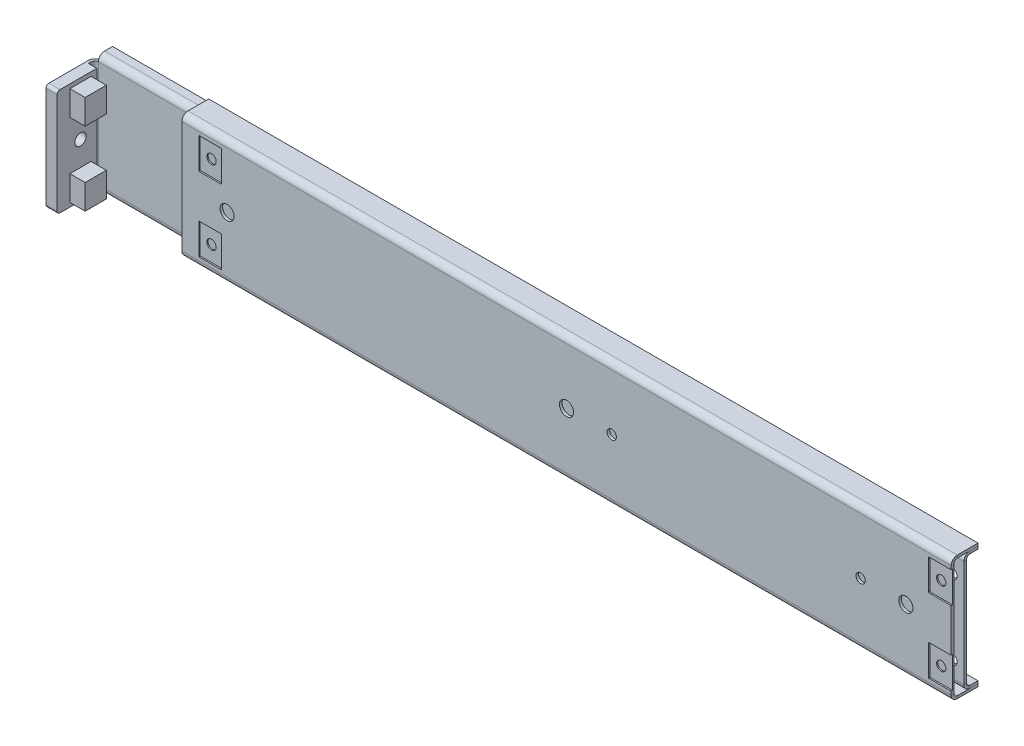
ISO-10303-21;
HEADER;
FILE_DESCRIPTION(('STEP AP214'),'2;1');
FILE_NAME('part.step','',(''),(''),'','','');
FILE_SCHEMA(('AUTOMOTIVE_DESIGN { 1 0 10303 214 1 1 1 1 }'));
ENDSEC;
DATA;
#1=APPLICATION_CONTEXT('core data for automotive mechanical design processes');
#2=APPLICATION_PROTOCOL_DEFINITION('international standard','automotive_design',2000,#1);
#3=PRODUCT_CONTEXT('',#1,'mechanical');
#4=PRODUCT('Part','Part','',(#3));
#5=PRODUCT_RELATED_PRODUCT_CATEGORY('part','',(#4));
#6=PRODUCT_DEFINITION_FORMATION('','',#4);
#7=PRODUCT_DEFINITION_CONTEXT('part definition',#1,'design');
#8=PRODUCT_DEFINITION('design','',#6,#7);
#9=PRODUCT_DEFINITION_SHAPE('','',#8);
#10=(LENGTH_UNIT() NAMED_UNIT(*) SI_UNIT(.MILLI.,.METRE.));
#11=(NAMED_UNIT(*) PLANE_ANGLE_UNIT() SI_UNIT($,.RADIAN.));
#12=(NAMED_UNIT(*) SI_UNIT($,.STERADIAN.) SOLID_ANGLE_UNIT());
#13=UNCERTAINTY_MEASURE_WITH_UNIT(LENGTH_MEASURE(1.E-05),#10,'distance_accuracy_value','');
#14=(GEOMETRIC_REPRESENTATION_CONTEXT(3) GLOBAL_UNCERTAINTY_ASSIGNED_CONTEXT((#13)) GLOBAL_UNIT_ASSIGNED_CONTEXT((#10,
#11,#12)) REPRESENTATION_CONTEXT('',''));
#15=CARTESIAN_POINT('',(0.,0.,0.));
#16=DIRECTION('',(0.,0.,1.));
#17=DIRECTION('',(1.,0.,0.));
#18=AXIS2_PLACEMENT_3D('',#15,#16,#17);
#19=CARTESIAN_POINT('',(-172.19964,0.,-5.81474224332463E-13));
#20=DIRECTION('',(1.,0.,0.));
#21=DIRECTION('',(0.,0.,-1.));
#22=AXIS2_PLACEMENT_3D('',#19,#20,#21);
#23=PLANE('',#22);
#24=CARTESIAN_POINT('',(-172.19964,-13.02072,1.67035999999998));
#25=DIRECTION('',(-1.,0.,0.));
#26=DIRECTION('',(0.,0.,1.));
#27=AXIS2_PLACEMENT_3D('',#24,#25,#26);
#28=CIRCLE('',#27,3.4);
#29=CARTESIAN_POINT('',(-172.19964,-9.62072000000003,1.67035999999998));
#30=VERTEX_POINT('',#29);
#31=CARTESIAN_POINT('',(-172.19964,-16.42072,1.67035999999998));
#32=VERTEX_POINT('',#31);
#33=EDGE_CURVE('E409',#30,#32,#28,.T.);
#34=ORIENTED_EDGE('',*,*,#33,.F.);
#35=DIRECTION('',(0.,0.,1.));
#36=VECTOR('',#35,1.);
#37=CARTESIAN_POINT('',(-172.19964,-9.62072000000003,-6.02228712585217E-13));
#38=LINE('',#37,#36);
#39=CARTESIAN_POINT('',(-172.19964,-9.62072000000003,5.47035999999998));
#40=VERTEX_POINT('',#39);
#41=EDGE_CURVE('E447',#30,#40,#38,.T.);
#42=ORIENTED_EDGE('',*,*,#41,.T.);
#43=CARTESIAN_POINT('',(-172.19964,-13.02072,5.47035999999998));
#44=DIRECTION('',(-1.,0.,0.));
#45=DIRECTION('',(0.,0.,1.));
#46=AXIS2_PLACEMENT_3D('',#43,#44,#45);
#47=CIRCLE('',#46,3.4);
#48=CARTESIAN_POINT('',(-172.19964,-16.42072,5.47035999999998));
#49=VERTEX_POINT('',#48);
#50=EDGE_CURVE('E462',#49,#40,#47,.T.);
#51=ORIENTED_EDGE('',*,*,#50,.F.);
#52=DIRECTION('',(0.,0.,1.));
#53=VECTOR('',#52,1.);
#54=CARTESIAN_POINT('',(-172.19964,-16.42072,-6.02228712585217E-13));
#55=LINE('',#54,#53);
#56=EDGE_CURVE('E459',#32,#49,#55,.T.);
#57=ORIENTED_EDGE('',*,*,#56,.F.);
#58=EDGE_LOOP('',(#34,#42,#51,#57));
#59=FACE_BOUND('',#58,.T.);
#60=CARTESIAN_POINT('',(-172.19964,0.,3.57035999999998));
#61=DIRECTION('',(1.,0.,0.));
#62=DIRECTION('',(0.,0.,-1.));
#63=AXIS2_PLACEMENT_3D('',#60,#61,#62);
#64=CIRCLE('',#63,2.0193);
#65=CARTESIAN_POINT('',(-172.19964,0.,1.55105999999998));
#66=VERTEX_POINT('',#65);
#67=EDGE_CURVE('E529',#66,#66,#64,.T.);
#68=ORIENTED_EDGE('',*,*,#67,.T.);
#69=EDGE_LOOP('',(#68));
#70=FACE_BOUND('',#69,.T.);
#71=DIRECTION('',(0.,0.,1.));
#72=VECTOR('',#71,1.);
#73=CARTESIAN_POINT('',(-172.19964,-18.87072,-5.93509062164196E-13));
#74=LINE('',#73,#72);
#75=CARTESIAN_POINT('',(-172.19964,-18.87072,-3.23000000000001));
#76=VERTEX_POINT('',#75);
#77=CARTESIAN_POINT('',(-172.19964,-18.87072,10.82036));
#78=VERTEX_POINT('',#77);
#79=EDGE_CURVE('E664',#76,#78,#74,.T.);
#80=ORIENTED_EDGE('',*,*,#79,.T.);
#81=CARTESIAN_POINT('',(-172.19964,-17.87072,10.82036));
#82=DIRECTION('',(1.,0.,0.));
#83=DIRECTION('',(0.,0.,-1.));
#84=AXIS2_PLACEMENT_3D('',#81,#82,#83);
#85=CIRCLE('',#84,1.);
#86=CARTESIAN_POINT('',(-172.19964,-17.87072,11.82036));
#87=VERTEX_POINT('',#86);
#88=EDGE_CURVE('E166',#78,#87,#85,.F.);
#89=ORIENTED_EDGE('',*,*,#88,.T.);
#90=DIRECTION('',(0.,1.,0.));
#91=VECTOR('',#90,1.);
#92=CARTESIAN_POINT('',(-172.19964,0.,11.82036));
#93=LINE('',#92,#91);
#94=CARTESIAN_POINT('',(-172.19964,17.87072,11.82036));
#95=VERTEX_POINT('',#94);
#96=EDGE_CURVE('E659',#87,#95,#93,.T.);
#97=ORIENTED_EDGE('',*,*,#96,.T.);
#98=CARTESIAN_POINT('',(-172.19964,17.87072,10.82036));
#99=DIRECTION('',(1.,0.,0.));
#100=DIRECTION('',(0.,0.,-1.));
#101=AXIS2_PLACEMENT_3D('',#98,#99,#100);
#102=CIRCLE('',#101,1.);
#103=CARTESIAN_POINT('',(-172.19964,18.87072,10.82036));
#104=VERTEX_POINT('',#103);
#105=EDGE_CURVE('E878',#95,#104,#102,.F.);
#106=ORIENTED_EDGE('',*,*,#105,.T.);
#107=DIRECTION('',(0.,0.,-1.));
#108=VECTOR('',#107,1.);
#109=CARTESIAN_POINT('',(-172.19964,18.87072,-5.69439386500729E-13));
#110=LINE('',#109,#108);
#111=CARTESIAN_POINT('',(-172.19964,18.87072,-3.23000000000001));
#112=VERTEX_POINT('',#111);
#113=EDGE_CURVE('E668',#104,#112,#110,.T.);
#114=ORIENTED_EDGE('',*,*,#113,.T.);
#115=DIRECTION('',(0.,-1.,0.));
#116=VECTOR('',#115,1.);
#117=CARTESIAN_POINT('',(-172.19964,18.87072,-3.23000000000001));
#118=LINE('',#117,#116);
#119=EDGE_CURVE('E678',#76,#112,#118,.F.);
#120=ORIENTED_EDGE('',*,*,#119,.F.);
#121=EDGE_LOOP('',(#80,#89,#97,#106,#114,#120));
#122=FACE_BOUND('',#121,.T.);
#123=CARTESIAN_POINT('',(-172.19964,13.02072,1.67035999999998));
#124=DIRECTION('',(-1.,0.,0.));
#125=DIRECTION('',(0.,0.,1.));
#126=AXIS2_PLACEMENT_3D('',#123,#124,#125);
#127=CIRCLE('',#126,3.4);
#128=CARTESIAN_POINT('',(-172.19964,16.42072,1.67035999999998));
#129=VERTEX_POINT('',#128);
#130=CARTESIAN_POINT('',(-172.19964,9.62071999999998,1.67035999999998));
#131=VERTEX_POINT('',#130);
#132=EDGE_CURVE('E406',#129,#131,#127,.T.);
#133=ORIENTED_EDGE('',*,*,#132,.F.);
#134=DIRECTION('',(0.,0.,-1.));
#135=VECTOR('',#134,1.);
#136=CARTESIAN_POINT('',(-172.19964,16.42072,-6.02228712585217E-13));
#137=LINE('',#136,#135);
#138=CARTESIAN_POINT('',(-172.19964,16.42072,5.47035999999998));
#139=VERTEX_POINT('',#138);
#140=EDGE_CURVE('E401',#139,#129,#137,.T.);
#141=ORIENTED_EDGE('',*,*,#140,.F.);
#142=CARTESIAN_POINT('',(-172.19964,13.02072,5.47035999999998));
#143=DIRECTION('',(-1.,0.,0.));
#144=DIRECTION('',(0.,0.,1.));
#145=AXIS2_PLACEMENT_3D('',#142,#143,#144);
#146=CIRCLE('',#145,3.4);
#147=CARTESIAN_POINT('',(-172.19964,9.62071999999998,5.47035999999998));
#148=VERTEX_POINT('',#147);
#149=EDGE_CURVE('E179',#148,#139,#146,.T.);
#150=ORIENTED_EDGE('',*,*,#149,.F.);
#151=DIRECTION('',(0.,0.,-1.));
#152=VECTOR('',#151,1.);
#153=CARTESIAN_POINT('',(-172.19964,9.62071999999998,-6.02228712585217E-13));
#154=LINE('',#153,#152);
#155=EDGE_CURVE('E174',#148,#131,#154,.T.);
#156=ORIENTED_EDGE('',*,*,#155,.T.);
#157=EDGE_LOOP('',(#133,#141,#150,#156));
#158=FACE_BOUND('',#157,.T.);
#159=ADVANCED_FACE('F156',(#59,#70,#122,#158),#23,.F.);
#160=CARTESIAN_POINT('',(-168.27,-17.87072,10.82036));
#161=DIRECTION('',(-1.,0.,0.));
#162=DIRECTION('',(0.,0.,1.));
#163=AXIS2_PLACEMENT_3D('',#160,#161,#162);
#164=PLANE('',#163);
#165=CARTESIAN_POINT('',(-168.27,0.,3.57035999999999));
#166=DIRECTION('',(1.,0.,0.));
#167=DIRECTION('',(0.,0.,-1.));
#168=AXIS2_PLACEMENT_3D('',#165,#166,#167);
#169=CIRCLE('',#168,2.01929999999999);
#170=CARTESIAN_POINT('',(-168.27,0.,1.55106000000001));
#171=VERTEX_POINT('',#170);
#172=EDGE_CURVE('E525',#171,#171,#169,.T.);
#173=ORIENTED_EDGE('',*,*,#172,.F.);
#174=EDGE_LOOP('',(#173));
#175=FACE_BOUND('',#174,.T.);
#176=DIRECTION('',(0.,-1.,0.));
#177=VECTOR('',#176,1.);
#178=CARTESIAN_POINT('',(-168.27,17.42072,7.32035999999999));
#179=LINE('',#178,#177);
#180=CARTESIAN_POINT('',(-168.27,17.42072,7.32035999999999));
#181=VERTEX_POINT('',#180);
#182=CARTESIAN_POINT('',(-168.27,8.62071999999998,7.32036000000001));
#183=VERTEX_POINT('',#182);
#184=EDGE_CURVE('E578',#181,#183,#179,.T.);
#185=ORIENTED_EDGE('',*,*,#184,.F.);
#186=DIRECTION('',(0.,0.,1.));
#187=VECTOR('',#186,1.);
#188=CARTESIAN_POINT('',(-168.27,17.42072,7.32035999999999));
#189=LINE('',#188,#187);
#190=CARTESIAN_POINT('',(-168.27,17.42072,-0.179640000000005));
#191=VERTEX_POINT('',#190);
#192=EDGE_CURVE('E584',#191,#181,#189,.T.);
#193=ORIENTED_EDGE('',*,*,#192,.F.);
#194=DIRECTION('',(0.,1.,0.));
#195=VECTOR('',#194,1.);
#196=CARTESIAN_POINT('',(-168.27,17.42072,-0.179640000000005));
#197=LINE('',#196,#195);
#198=CARTESIAN_POINT('',(-168.27,8.62071999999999,-0.179640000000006));
#199=VERTEX_POINT('',#198);
#200=EDGE_CURVE('E601',#199,#191,#197,.T.);
#201=ORIENTED_EDGE('',*,*,#200,.F.);
#202=DIRECTION('',(0.,0.,-1.));
#203=VECTOR('',#202,1.);
#204=CARTESIAN_POINT('',(-168.27,8.62071999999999,7.32035999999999));
#205=LINE('',#204,#203);
#206=EDGE_CURVE('E597',#183,#199,#205,.T.);
#207=ORIENTED_EDGE('',*,*,#206,.F.);
#208=EDGE_LOOP('',(#185,#193,#201,#207));
#209=FACE_BOUND('',#208,.T.);
#210=DIRECTION('',(0.,1.,0.));
#211=VECTOR('',#210,1.);
#212=CARTESIAN_POINT('',(-168.27,18.87072,-2.23));
#213=LINE('',#212,#211);
#214=CARTESIAN_POINT('',(-168.27,-18.87072,-2.23));
#215=VERTEX_POINT('',#214);
#216=CARTESIAN_POINT('',(-168.27,18.87072,-2.23));
#217=VERTEX_POINT('',#216);
#218=EDGE_CURVE('E624',#215,#217,#213,.T.);
#219=ORIENTED_EDGE('',*,*,#218,.T.);
#220=DIRECTION('',(0.,0.,1.));
#221=VECTOR('',#220,1.);
#222=CARTESIAN_POINT('',(-168.27,18.87072,-2.23));
#223=LINE('',#222,#221);
#224=CARTESIAN_POINT('',(-168.27,18.87072,10.82036));
#225=VERTEX_POINT('',#224);
#226=EDGE_CURVE('E628',#217,#225,#223,.T.);
#227=ORIENTED_EDGE('',*,*,#226,.T.);
#228=CARTESIAN_POINT('',(-168.27,17.87072,10.82036));
#229=DIRECTION('',(1.,0.,0.));
#230=DIRECTION('',(0.,0.,-1.));
#231=AXIS2_PLACEMENT_3D('',#228,#229,#230);
#232=CIRCLE('',#231,1.);
#233=CARTESIAN_POINT('',(-168.27,17.87072,11.82036));
#234=VERTEX_POINT('',#233);
#235=EDGE_CURVE('E632',#225,#234,#232,.T.);
#236=ORIENTED_EDGE('',*,*,#235,.T.);
#237=DIRECTION('',(0.,-1.,0.));
#238=VECTOR('',#237,1.);
#239=CARTESIAN_POINT('',(-168.27,17.87072,11.82036));
#240=LINE('',#239,#238);
#241=CARTESIAN_POINT('',(-168.27,-17.87072,11.82036));
#242=VERTEX_POINT('',#241);
#243=EDGE_CURVE('E636',#234,#242,#240,.T.);
#244=ORIENTED_EDGE('',*,*,#243,.T.);
#245=CARTESIAN_POINT('',(-168.27,-17.87072,10.82036));
#246=DIRECTION('',(1.,0.,0.));
#247=DIRECTION('',(0.,0.,1.));
#248=AXIS2_PLACEMENT_3D('',#245,#246,#247);
#249=CIRCLE('',#248,1.);
#250=CARTESIAN_POINT('',(-168.27,-18.87072,10.82036));
#251=VERTEX_POINT('',#250);
#252=EDGE_CURVE('E640',#242,#251,#249,.T.);
#253=ORIENTED_EDGE('',*,*,#252,.T.);
#254=DIRECTION('',(0.,0.,-1.));
#255=VECTOR('',#254,1.);
#256=CARTESIAN_POINT('',(-168.27,-18.87072,-2.23));
#257=LINE('',#256,#255);
#258=EDGE_CURVE('E644',#251,#215,#257,.T.);
#259=ORIENTED_EDGE('',*,*,#258,.T.);
#260=EDGE_LOOP('',(#219,#227,#236,#244,#253,#259));
#261=FACE_BOUND('',#260,.T.);
#262=DIRECTION('',(0.,-1.,0.));
#263=VECTOR('',#262,1.);
#264=CARTESIAN_POINT('',(-168.27,-8.62072000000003,7.32035999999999));
#265=LINE('',#264,#263);
#266=CARTESIAN_POINT('',(-168.27,-8.62072000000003,7.32035999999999));
#267=VERTEX_POINT('',#266);
#268=CARTESIAN_POINT('',(-168.27,-17.42072,7.32036000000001));
#269=VERTEX_POINT('',#268);
#270=EDGE_CURVE('E533',#267,#269,#265,.T.);
#271=ORIENTED_EDGE('',*,*,#270,.F.);
#272=DIRECTION('',(0.,0.,1.));
#273=VECTOR('',#272,1.);
#274=CARTESIAN_POINT('',(-168.27,-8.62072000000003,7.32035999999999));
#275=LINE('',#274,#273);
#276=CARTESIAN_POINT('',(-168.27,-8.62072000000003,-0.179640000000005));
#277=VERTEX_POINT('',#276);
#278=EDGE_CURVE('E539',#277,#267,#275,.T.);
#279=ORIENTED_EDGE('',*,*,#278,.F.);
#280=DIRECTION('',(0.,1.,0.));
#281=VECTOR('',#280,1.);
#282=CARTESIAN_POINT('',(-168.27,-8.62072000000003,-0.179640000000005));
#283=LINE('',#282,#281);
#284=CARTESIAN_POINT('',(-168.27,-17.42072,-0.179640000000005));
#285=VERTEX_POINT('',#284);
#286=EDGE_CURVE('E556',#285,#277,#283,.T.);
#287=ORIENTED_EDGE('',*,*,#286,.F.);
#288=DIRECTION('',(0.,0.,-1.));
#289=VECTOR('',#288,1.);
#290=CARTESIAN_POINT('',(-168.27,-17.42072,7.32035999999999));
#291=LINE('',#290,#289);
#292=EDGE_CURVE('E552',#269,#285,#291,.T.);
#293=ORIENTED_EDGE('',*,*,#292,.F.);
#294=EDGE_LOOP('',(#271,#279,#287,#293));
#295=FACE_BOUND('',#294,.T.);
#296=ADVANCED_FACE('F927',(#175,#209,#261,#295),#164,.F.);
#297=CARTESIAN_POINT('',(-171.27,0.,-5.7822840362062E-13));
#298=DIRECTION('',(1.,0.,0.));
#299=DIRECTION('',(0.,0.,-1.));
#300=AXIS2_PLACEMENT_3D('',#297,#298,#299);
#301=PLANE('',#300);
#302=DIRECTION('',(0.,0.,1.));
#303=VECTOR('',#302,1.);
#304=CARTESIAN_POINT('',(-171.27,18.87072,-4.5));
#305=LINE('',#304,#303);
#306=CARTESIAN_POINT('',(-171.27,18.87072,-2.23000000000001));
#307=VERTEX_POINT('',#306);
#308=CARTESIAN_POINT('',(-171.27,18.87072,-3.23000000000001));
#309=VERTEX_POINT('',#308);
#310=EDGE_CURVE('E675',#307,#309,#305,.F.);
#311=ORIENTED_EDGE('',*,*,#310,.F.);
#312=DIRECTION('',(0.,1.,0.));
#313=VECTOR('',#312,1.);
#314=CARTESIAN_POINT('',(-171.27,18.87072,-2.23000000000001));
#315=LINE('',#314,#313);
#316=CARTESIAN_POINT('',(-171.27,-18.87072,-2.23000000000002));
#317=VERTEX_POINT('',#316);
#318=EDGE_CURVE('E623',#317,#307,#315,.T.);
#319=ORIENTED_EDGE('',*,*,#318,.F.);
#320=DIRECTION('',(0.,0.,-1.));
#321=VECTOR('',#320,1.);
#322=CARTESIAN_POINT('',(-171.27,-18.87072,11.82036));
#323=LINE('',#322,#321);
#324=CARTESIAN_POINT('',(-171.27,-18.87072,-3.23000000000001));
#325=VERTEX_POINT('',#324);
#326=EDGE_CURVE('E671',#325,#317,#323,.F.);
#327=ORIENTED_EDGE('',*,*,#326,.F.);
#328=DIRECTION('',(0.,-1.,0.));
#329=VECTOR('',#328,1.);
#330=CARTESIAN_POINT('',(-171.27,18.87072,-3.23000000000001));
#331=LINE('',#330,#329);
#332=EDGE_CURVE('E686',#309,#325,#331,.T.);
#333=ORIENTED_EDGE('',*,*,#332,.F.);
#334=EDGE_LOOP('',(#311,#319,#327,#333));
#335=FACE_BOUND('',#334,.T.);
#336=ADVANCED_FACE('F933',(#335),#301,.T.);
#337=CARTESIAN_POINT('',(136.,18.87072,-5.42964));
#338=DIRECTION('',(1.,0.,0.));
#339=DIRECTION('',(0.,0.,-1.));
#340=AXIS2_PLACEMENT_3D('',#337,#338,#339);
#341=PLANE('',#340);
#342=DIRECTION('',(0.,1.,0.));
#343=VECTOR('',#342,1.);
#344=CARTESIAN_POINT('',(136.,18.87072,-4.5));
#345=LINE('',#344,#343);
#346=CARTESIAN_POINT('',(136.,-18.87072,-4.5));
#347=VERTEX_POINT('',#346);
#348=CARTESIAN_POINT('',(136.,18.87072,-4.50000000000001));
#349=VERTEX_POINT('',#348);
#350=EDGE_CURVE('E812',#347,#349,#345,.T.);
#351=ORIENTED_EDGE('',*,*,#350,.F.);
#352=DIRECTION('',(0.,0.,1.));
#353=VECTOR('',#352,1.);
#354=CARTESIAN_POINT('',(136.,-18.87072,-5.42964));
#355=LINE('',#354,#353);
#356=CARTESIAN_POINT('',(136.,-18.87072,-5.42964000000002));
#357=VERTEX_POINT('',#356);
#358=EDGE_CURVE('E854',#357,#347,#355,.T.);
#359=ORIENTED_EDGE('',*,*,#358,.F.);
#360=DIRECTION('',(0.,1.,0.));
#361=VECTOR('',#360,1.);
#362=CARTESIAN_POINT('',(136.,18.87072,-5.42964));
#363=LINE('',#362,#361);
#364=CARTESIAN_POINT('',(136.,18.87072,-5.42964000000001));
#365=VERTEX_POINT('',#364);
#366=EDGE_CURVE('E824',#357,#365,#363,.T.);
#367=ORIENTED_EDGE('',*,*,#366,.T.);
#368=DIRECTION('',(0.,0.,1.));
#369=VECTOR('',#368,1.);
#370=CARTESIAN_POINT('',(136.,18.87072,-5.42964));
#371=LINE('',#370,#369);
#372=EDGE_CURVE('E839',#365,#349,#371,.T.);
#373=ORIENTED_EDGE('',*,*,#372,.T.);
#374=EDGE_LOOP('',(#351,#359,#367,#373));
#375=FACE_BOUND('',#374,.T.);
#376=ADVANCED_FACE('F943',(#375),#341,.T.);
#377=CARTESIAN_POINT('',(0.,0.,-5.42964));
#378=DIRECTION('',(0.,0.,-1.));
#379=DIRECTION('',(-1.,0.,0.));
#380=AXIS2_PLACEMENT_3D('',#377,#378,#379);
#381=PLANE('',#380);
#382=CARTESIAN_POINT('',(16.,0.,-5.42964));
#383=DIRECTION('',(0.,0.,-1.));
#384=DIRECTION('',(-1.,0.,0.));
#385=AXIS2_PLACEMENT_3D('',#382,#383,#384);
#386=CIRCLE('',#385,1.65);
#387=CARTESIAN_POINT('',(14.35,0.,-5.42964));
#388=VERTEX_POINT('',#387);
#389=EDGE_CURVE('E481',#388,#388,#386,.T.);
#390=ORIENTED_EDGE('',*,*,#389,.F.);
#391=EDGE_LOOP('',(#390));
#392=FACE_BOUND('',#391,.T.);
#393=CARTESIAN_POINT('',(104.,0.,-5.42964));
#394=DIRECTION('',(0.,0.,-1.));
#395=DIRECTION('',(-1.,0.,0.));
#396=AXIS2_PLACEMENT_3D('',#393,#394,#395);
#397=CIRCLE('',#396,1.65);
#398=CARTESIAN_POINT('',(102.35,0.,-5.42964));
#399=VERTEX_POINT('',#398);
#400=EDGE_CURVE('E486',#399,#399,#397,.T.);
#401=ORIENTED_EDGE('',*,*,#400,.F.);
#402=EDGE_LOOP('',(#401));
#403=FACE_BOUND('',#402,.T.);
#404=CARTESIAN_POINT('',(120.,0.,-5.42964));
#405=DIRECTION('',(0.,0.,-1.));
#406=DIRECTION('',(-1.,0.,0.));
#407=AXIS2_PLACEMENT_3D('',#404,#405,#406);
#408=CIRCLE('',#407,2.5);
#409=CARTESIAN_POINT('',(117.5,0.,-5.42964));
#410=VERTEX_POINT('',#409);
#411=EDGE_CURVE('E491',#410,#410,#408,.T.);
#412=ORIENTED_EDGE('',*,*,#411,.F.);
#413=EDGE_LOOP('',(#412));
#414=FACE_BOUND('',#413,.T.);
#415=CARTESIAN_POINT('',(0.,0.,-5.42964));
#416=DIRECTION('',(0.,0.,-1.));
#417=DIRECTION('',(-1.,0.,0.));
#418=AXIS2_PLACEMENT_3D('',#415,#416,#417);
#419=CIRCLE('',#418,2.50000000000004);
#420=CARTESIAN_POINT('',(-2.50000000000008,0.,-5.42964));
#421=VERTEX_POINT('',#420);
#422=EDGE_CURVE('E496',#421,#421,#419,.T.);
#423=ORIENTED_EDGE('',*,*,#422,.F.);
#424=EDGE_LOOP('',(#423));
#425=FACE_BOUND('',#424,.T.);
#426=CARTESIAN_POINT('',(-120.,0.,-5.42964));
#427=DIRECTION('',(0.,0.,-1.));
#428=DIRECTION('',(-1.,0.,0.));
#429=AXIS2_PLACEMENT_3D('',#426,#427,#428);
#430=CIRCLE('',#429,2.5);
#431=CARTESIAN_POINT('',(-122.5,0.,-5.42964));
#432=VERTEX_POINT('',#431);
#433=EDGE_CURVE('E501',#432,#432,#430,.T.);
#434=ORIENTED_EDGE('',*,*,#433,.F.);
#435=EDGE_LOOP('',(#434));
#436=FACE_BOUND('',#435,.T.);
#437=CARTESIAN_POINT('',(-126.,13.1,-5.42964));
#438=DIRECTION('',(0.,0.,-1.));
#439=DIRECTION('',(-1.,0.,0.));
#440=AXIS2_PLACEMENT_3D('',#437,#438,#439);
#441=CIRCLE('',#440,1.65);
#442=CARTESIAN_POINT('',(-127.65,13.1,-5.42964));
#443=VERTEX_POINT('',#442);
#444=EDGE_CURVE('E505',#443,#443,#441,.T.);
#445=ORIENTED_EDGE('',*,*,#444,.F.);
#446=EDGE_LOOP('',(#445));
#447=FACE_BOUND('',#446,.T.);
#448=CARTESIAN_POINT('',(-126.,-13.1,-5.42964));
#449=DIRECTION('',(0.,0.,-1.));
#450=DIRECTION('',(-1.,0.,0.));
#451=AXIS2_PLACEMENT_3D('',#448,#449,#450);
#452=CIRCLE('',#451,1.65);
#453=CARTESIAN_POINT('',(-127.65,-13.1,-5.42964));
#454=VERTEX_POINT('',#453);
#455=EDGE_CURVE('E510',#454,#454,#452,.T.);
#456=ORIENTED_EDGE('',*,*,#455,.F.);
#457=EDGE_LOOP('',(#456));
#458=FACE_BOUND('',#457,.T.);
#459=CARTESIAN_POINT('',(132.,13.1,-5.42964));
#460=DIRECTION('',(0.,0.,-1.));
#461=DIRECTION('',(-1.,0.,0.));
#462=AXIS2_PLACEMENT_3D('',#459,#460,#461);
#463=CIRCLE('',#462,1.65);
#464=CARTESIAN_POINT('',(130.35,13.1,-5.42964));
#465=VERTEX_POINT('',#464);
#466=EDGE_CURVE('E516',#465,#465,#463,.T.);
#467=ORIENTED_EDGE('',*,*,#466,.F.);
#468=EDGE_LOOP('',(#467));
#469=FACE_BOUND('',#468,.T.);
#470=CARTESIAN_POINT('',(132.,-13.1,-5.42964));
#471=DIRECTION('',(0.,0.,-1.));
#472=DIRECTION('',(-1.,0.,0.));
#473=AXIS2_PLACEMENT_3D('',#470,#471,#472);
#474=CIRCLE('',#473,1.65);
#475=CARTESIAN_POINT('',(130.35,-13.1,-5.42964));
#476=VERTEX_POINT('',#475);
#477=EDGE_CURVE('E521',#476,#476,#474,.T.);
#478=ORIENTED_EDGE('',*,*,#477,.F.);
#479=EDGE_LOOP('',(#478));
#480=FACE_BOUND('',#479,.T.);
#481=ORIENTED_EDGE('',*,*,#366,.F.);
#482=DIRECTION('',(1.,0.,0.));
#483=VECTOR('',#482,1.);
#484=CARTESIAN_POINT('',(136.,-18.87072,-5.42964));
#485=LINE('',#484,#483);
#486=CARTESIAN_POINT('',(-170.,-18.87072,-5.42964000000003));
#487=VERTEX_POINT('',#486);
#488=EDGE_CURVE('E836',#487,#357,#485,.T.);
#489=ORIENTED_EDGE('',*,*,#488,.F.);
#490=DIRECTION('',(0.,-1.,0.));
#491=VECTOR('',#490,1.);
#492=CARTESIAN_POINT('',(-170.,18.87072,-5.42964));
#493=LINE('',#492,#491);
#494=CARTESIAN_POINT('',(-170.,18.87072,-5.42964000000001));
#495=VERTEX_POINT('',#494);
#496=EDGE_CURVE('E832',#495,#487,#493,.T.);
#497=ORIENTED_EDGE('',*,*,#496,.F.);
#498=DIRECTION('',(-1.,0.,0.));
#499=VECTOR('',#498,1.);
#500=CARTESIAN_POINT('',(136.,18.87072,-5.42964));
#501=LINE('',#500,#499);
#502=EDGE_CURVE('E828',#365,#495,#501,.T.);
#503=ORIENTED_EDGE('',*,*,#502,.F.);
#504=EDGE_LOOP('',(#481,#489,#497,#503));
#505=FACE_BOUND('',#504,.T.);
#506=ADVANCED_FACE('F1046',(#392,#403,#414,#425,#436,#447,#458,#469,#480,#505),#381,.T.);
#507=CARTESIAN_POINT('',(0.,0.,-4.5));
#508=DIRECTION('',(0.,0.,-1.));
#509=DIRECTION('',(-1.,0.,0.));
#510=AXIS2_PLACEMENT_3D('',#507,#508,#509);
#511=PLANE('',#510);
#512=CARTESIAN_POINT('',(16.,0.,-4.5));
#513=DIRECTION('',(0.,0.,-1.));
#514=DIRECTION('',(-1.,0.,0.));
#515=AXIS2_PLACEMENT_3D('',#512,#513,#514);
#516=CIRCLE('',#515,1.65);
#517=CARTESIAN_POINT('',(14.35,0.,-4.5));
#518=VERTEX_POINT('',#517);
#519=EDGE_CURVE('E160',#518,#518,#516,.T.);
#520=ORIENTED_EDGE('',*,*,#519,.T.);
#521=EDGE_LOOP('',(#520));
#522=FACE_BOUND('',#521,.T.);
#523=CARTESIAN_POINT('',(104.,0.,-4.5));
#524=DIRECTION('',(0.,0.,-1.));
#525=DIRECTION('',(-1.,0.,0.));
#526=AXIS2_PLACEMENT_3D('',#523,#524,#525);
#527=CIRCLE('',#526,1.65);
#528=CARTESIAN_POINT('',(102.35,0.,-4.5));
#529=VERTEX_POINT('',#528);
#530=EDGE_CURVE('E485',#529,#529,#527,.T.);
#531=ORIENTED_EDGE('',*,*,#530,.T.);
#532=EDGE_LOOP('',(#531));
#533=FACE_BOUND('',#532,.T.);
#534=CARTESIAN_POINT('',(120.,0.,-4.5));
#535=DIRECTION('',(0.,0.,-1.));
#536=DIRECTION('',(-1.,0.,0.));
#537=AXIS2_PLACEMENT_3D('',#534,#535,#536);
#538=CIRCLE('',#537,2.5);
#539=CARTESIAN_POINT('',(117.5,0.,-4.5));
#540=VERTEX_POINT('',#539);
#541=EDGE_CURVE('E490',#540,#540,#538,.T.);
#542=ORIENTED_EDGE('',*,*,#541,.T.);
#543=EDGE_LOOP('',(#542));
#544=FACE_BOUND('',#543,.T.);
#545=CARTESIAN_POINT('',(0.,0.,-4.5));
#546=DIRECTION('',(0.,0.,-1.));
#547=DIRECTION('',(-1.,0.,0.));
#548=AXIS2_PLACEMENT_3D('',#545,#546,#547);
#549=CIRCLE('',#548,2.50000000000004);
#550=CARTESIAN_POINT('',(-2.50000000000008,0.,-4.5));
#551=VERTEX_POINT('',#550);
#552=EDGE_CURVE('E495',#551,#551,#549,.T.);
#553=ORIENTED_EDGE('',*,*,#552,.T.);
#554=EDGE_LOOP('',(#553));
#555=FACE_BOUND('',#554,.T.);
#556=CARTESIAN_POINT('',(-120.,0.,-4.5));
#557=DIRECTION('',(0.,0.,-1.));
#558=DIRECTION('',(-1.,0.,0.));
#559=AXIS2_PLACEMENT_3D('',#556,#557,#558);
#560=CIRCLE('',#559,2.5);
#561=CARTESIAN_POINT('',(-122.5,0.,-4.5));
#562=VERTEX_POINT('',#561);
#563=EDGE_CURVE('E500',#562,#562,#560,.T.);
#564=ORIENTED_EDGE('',*,*,#563,.T.);
#565=EDGE_LOOP('',(#564));
#566=FACE_BOUND('',#565,.T.);
#567=CARTESIAN_POINT('',(-126.,13.1,-4.5));
#568=DIRECTION('',(0.,0.,-1.));
#569=DIRECTION('',(-1.,0.,0.));
#570=AXIS2_PLACEMENT_3D('',#567,#568,#569);
#571=CIRCLE('',#570,1.65);
#572=CARTESIAN_POINT('',(-127.65,13.1,-4.5));
#573=VERTEX_POINT('',#572);
#574=EDGE_CURVE('E506',#573,#573,#571,.T.);
#575=ORIENTED_EDGE('',*,*,#574,.T.);
#576=EDGE_LOOP('',(#575));
#577=FACE_BOUND('',#576,.T.);
#578=CARTESIAN_POINT('',(-126.,-13.1,-4.5));
#579=DIRECTION('',(0.,0.,-1.));
#580=DIRECTION('',(-1.,0.,0.));
#581=AXIS2_PLACEMENT_3D('',#578,#579,#580);
#582=CIRCLE('',#581,1.65);
#583=CARTESIAN_POINT('',(-127.65,-13.1,-4.5));
#584=VERTEX_POINT('',#583);
#585=EDGE_CURVE('E511',#584,#584,#582,.T.);
#586=ORIENTED_EDGE('',*,*,#585,.T.);
#587=EDGE_LOOP('',(#586));
#588=FACE_BOUND('',#587,.T.);
#589=CARTESIAN_POINT('',(132.,13.1,-4.5));
#590=DIRECTION('',(0.,0.,-1.));
#591=DIRECTION('',(-1.,0.,0.));
#592=AXIS2_PLACEMENT_3D('',#589,#590,#591);
#593=CIRCLE('',#592,1.65);
#594=CARTESIAN_POINT('',(130.35,13.1,-4.5));
#595=VERTEX_POINT('',#594);
#596=EDGE_CURVE('E515',#595,#595,#593,.T.);
#597=ORIENTED_EDGE('',*,*,#596,.T.);
#598=EDGE_LOOP('',(#597));
#599=FACE_BOUND('',#598,.T.);
#600=CARTESIAN_POINT('',(132.,-13.1,-4.5));
#601=DIRECTION('',(0.,0.,-1.));
#602=DIRECTION('',(-1.,0.,0.));
#603=AXIS2_PLACEMENT_3D('',#600,#601,#602);
#604=CIRCLE('',#603,1.65);
#605=CARTESIAN_POINT('',(130.35,-13.1,-4.5));
#606=VERTEX_POINT('',#605);
#607=EDGE_CURVE('E520',#606,#606,#604,.T.);
#608=ORIENTED_EDGE('',*,*,#607,.T.);
#609=EDGE_LOOP('',(#608));
#610=FACE_BOUND('',#609,.T.);
#611=ORIENTED_EDGE('',*,*,#350,.T.);
#612=DIRECTION('',(-1.,0.,0.));
#613=VECTOR('',#612,1.);
#614=CARTESIAN_POINT('',(136.,18.87072,-4.5));
#615=LINE('',#614,#613);
#616=CARTESIAN_POINT('',(-170.,18.87072,-4.5));
#617=VERTEX_POINT('',#616);
#618=EDGE_CURVE('E843',#349,#617,#615,.T.);
#619=ORIENTED_EDGE('',*,*,#618,.T.);
#620=DIRECTION('',(0.,-1.,0.));
#621=VECTOR('',#620,1.);
#622=CARTESIAN_POINT('',(-170.,18.87072,-4.5));
#623=LINE('',#622,#621);
#624=CARTESIAN_POINT('',(-170.,-18.87072,-4.50000000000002));
#625=VERTEX_POINT('',#624);
#626=EDGE_CURVE('E847',#617,#625,#623,.T.);
#627=ORIENTED_EDGE('',*,*,#626,.T.);
#628=DIRECTION('',(1.,0.,0.));
#629=VECTOR('',#628,1.);
#630=CARTESIAN_POINT('',(136.,-18.87072,-4.5));
#631=LINE('',#630,#629);
#632=EDGE_CURVE('E829',#625,#347,#631,.T.);
#633=ORIENTED_EDGE('',*,*,#632,.T.);
#634=EDGE_LOOP('',(#611,#619,#627,#633));
#635=FACE_BOUND('',#634,.T.);
#636=ADVANCED_FACE('F907',(#522,#533,#544,#555,#566,#577,#588,#599,#610,#635),#511,.F.);
#637=CARTESIAN_POINT('',(-170.,18.87072,-6.69964));
#638=DIRECTION('',(-1.,0.,0.));
#639=DIRECTION('',(0.,0.,1.));
#640=AXIS2_PLACEMENT_3D('',#637,#638,#639);
#641=PLANE('',#640);
#642=DIRECTION('',(0.,-1.,0.));
#643=VECTOR('',#642,1.);
#644=CARTESIAN_POINT('',(-170.,21.07036,-6.69963999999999));
#645=LINE('',#644,#643);
#646=CARTESIAN_POINT('',(-170.,20.14072,-6.69963999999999));
#647=VERTEX_POINT('',#646);
#648=CARTESIAN_POINT('',(-170.,21.07036,-6.69963999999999));
#649=VERTEX_POINT('',#648);
#650=EDGE_CURVE('E754',#647,#649,#645,.F.);
#651=ORIENTED_EDGE('',*,*,#650,.F.);
#652=CARTESIAN_POINT('',(-170.,18.87072,-6.69964));
#653=DIRECTION('',(1.,0.,0.));
#654=DIRECTION('',(0.,0.,-1.));
#655=AXIS2_PLACEMENT_3D('',#652,#653,#654);
#656=CIRCLE('',#655,1.26999999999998);
#657=EDGE_CURVE('E817',#495,#647,#656,.F.);
#658=ORIENTED_EDGE('',*,*,#657,.F.);
#659=DIRECTION('',(0.,0.,1.));
#660=VECTOR('',#659,1.);
#661=CARTESIAN_POINT('',(-170.,18.87072,-5.42964));
#662=LINE('',#661,#660);
#663=EDGE_CURVE('E863',#495,#617,#662,.T.);
#664=ORIENTED_EDGE('',*,*,#663,.T.);
#665=CARTESIAN_POINT('',(-170.,18.87072,-6.69964));
#666=DIRECTION('',(1.,0.,0.));
#667=DIRECTION('',(0.,0.,-1.));
#668=AXIS2_PLACEMENT_3D('',#665,#666,#667);
#669=CIRCLE('',#668,2.19963999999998);
#670=EDGE_CURVE('E808',#617,#649,#669,.F.);
#671=ORIENTED_EDGE('',*,*,#670,.T.);
#672=EDGE_LOOP('',(#651,#658,#664,#671));
#673=FACE_BOUND('',#672,.T.);
#674=ADVANCED_FACE('F1039',(#673),#641,.T.);
#675=CARTESIAN_POINT('',(136.,18.87072,-6.69964));
#676=DIRECTION('',(-1.,0.,0.));
#677=DIRECTION('',(0.,0.,1.));
#678=AXIS2_PLACEMENT_3D('',#675,#676,#677);
#679=PLANE('',#678);
#680=CARTESIAN_POINT('',(136.,18.87072,-6.69964));
#681=DIRECTION('',(1.,0.,0.));
#682=DIRECTION('',(0.,0.,-1.));
#683=AXIS2_PLACEMENT_3D('',#680,#681,#682);
#684=CIRCLE('',#683,1.26999999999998);
#685=CARTESIAN_POINT('',(136.,20.14072,-6.69963999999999));
#686=VERTEX_POINT('',#685);
#687=EDGE_CURVE('E770',#686,#365,#684,.T.);
#688=ORIENTED_EDGE('',*,*,#687,.F.);
#689=DIRECTION('',(0.,-1.,0.));
#690=VECTOR('',#689,1.);
#691=CARTESIAN_POINT('',(136.,20.14072,-6.69963999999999));
#692=LINE('',#691,#690);
#693=CARTESIAN_POINT('',(136.,21.07036,-6.69963999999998));
#694=VERTEX_POINT('',#693);
#695=EDGE_CURVE('E798',#686,#694,#692,.F.);
#696=ORIENTED_EDGE('',*,*,#695,.T.);
#697=CARTESIAN_POINT('',(136.,18.87072,-6.69964));
#698=DIRECTION('',(1.,0.,0.));
#699=DIRECTION('',(0.,0.,-1.));
#700=AXIS2_PLACEMENT_3D('',#697,#698,#699);
#701=CIRCLE('',#700,2.19963999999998);
#702=EDGE_CURVE('E813',#694,#349,#701,.T.);
#703=ORIENTED_EDGE('',*,*,#702,.T.);
#704=ORIENTED_EDGE('',*,*,#372,.F.);
#705=EDGE_LOOP('',(#688,#696,#703,#704));
#706=FACE_BOUND('',#705,.T.);
#707=ADVANCED_FACE('F1034',(#706),#679,.F.);
#708=CARTESIAN_POINT('',(136.,18.87072,-6.69964));
#709=DIRECTION('',(1.,0.,0.));
#710=DIRECTION('',(0.,1.,0.));
#711=AXIS2_PLACEMENT_3D('',#708,#709,#710);
#712=CYLINDRICAL_SURFACE('',#711,2.19963999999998);
#713=ORIENTED_EDGE('',*,*,#618,.F.);
#714=ORIENTED_EDGE('',*,*,#702,.F.);
#715=DIRECTION('',(1.,0.,0.));
#716=VECTOR('',#715,1.);
#717=CARTESIAN_POINT('',(-170.,21.07036,-6.69963999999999));
#718=LINE('',#717,#716);
#719=EDGE_CURVE('E795',#694,#649,#718,.F.);
#720=ORIENTED_EDGE('',*,*,#719,.T.);
#721=ORIENTED_EDGE('',*,*,#670,.F.);
#722=EDGE_LOOP('',(#713,#714,#720,#721));
#723=FACE_BOUND('',#722,.T.);
#724=ADVANCED_FACE('F1031',(#723),#712,.T.);
#725=CARTESIAN_POINT('',(136.,18.87072,-6.69964));
#726=DIRECTION('',(1.,0.,0.));
#727=DIRECTION('',(0.,1.,0.));
#728=AXIS2_PLACEMENT_3D('',#725,#726,#727);
#729=CYLINDRICAL_SURFACE('',#728,1.26999999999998);
#730=ORIENTED_EDGE('',*,*,#502,.T.);
#731=ORIENTED_EDGE('',*,*,#657,.T.);
#732=DIRECTION('',(1.,0.,0.));
#733=VECTOR('',#732,1.);
#734=CARTESIAN_POINT('',(-170.,20.14072,-6.69964));
#735=LINE('',#734,#733);
#736=EDGE_CURVE('E802',#647,#686,#735,.T.);
#737=ORIENTED_EDGE('',*,*,#736,.T.);
#738=ORIENTED_EDGE('',*,*,#687,.T.);
#739=EDGE_LOOP('',(#730,#731,#737,#738));
#740=FACE_BOUND('',#739,.T.);
#741=ADVANCED_FACE('F1029',(#740),#729,.F.);
#742=CARTESIAN_POINT('',(136.,21.07036,-9.5));
#743=DIRECTION('',(-1.,0.,0.));
#744=DIRECTION('',(0.,-1.,0.));
#745=AXIS2_PLACEMENT_3D('',#742,#743,#744);
#746=PLANE('',#745);
#747=ORIENTED_EDGE('',*,*,#695,.F.);
#748=DIRECTION('',(0.,0.,1.));
#749=VECTOR('',#748,1.);
#750=CARTESIAN_POINT('',(136.,20.14072,-9.5));
#751=LINE('',#750,#749);
#752=CARTESIAN_POINT('',(136.,20.14072,-9.5));
#753=VERTEX_POINT('',#752);
#754=EDGE_CURVE('E792',#686,#753,#751,.F.);
#755=ORIENTED_EDGE('',*,*,#754,.T.);
#756=DIRECTION('',(0.,-1.,0.));
#757=VECTOR('',#756,1.);
#758=CARTESIAN_POINT('',(136.,21.07036,-9.5));
#759=LINE('',#758,#757);
#760=CARTESIAN_POINT('',(136.,21.07036,-9.5));
#761=VERTEX_POINT('',#760);
#762=EDGE_CURVE('E766',#761,#753,#759,.T.);
#763=ORIENTED_EDGE('',*,*,#762,.F.);
#764=DIRECTION('',(0.,0.,-1.));
#765=VECTOR('',#764,1.);
#766=CARTESIAN_POINT('',(136.,21.07036,0.));
#767=LINE('',#766,#765);
#768=EDGE_CURVE('E782',#694,#761,#767,.T.);
#769=ORIENTED_EDGE('',*,*,#768,.F.);
#770=EDGE_LOOP('',(#747,#755,#763,#769));
#771=FACE_BOUND('',#770,.T.);
#772=ADVANCED_FACE('F1022',(#771),#746,.F.);
#773=CARTESIAN_POINT('',(-170.,21.07036,-5.42964));
#774=DIRECTION('',(1.,0.,0.));
#775=DIRECTION('',(0.,1.,0.));
#776=AXIS2_PLACEMENT_3D('',#773,#774,#775);
#777=PLANE('',#776);
#778=ORIENTED_EDGE('',*,*,#650,.T.);
#779=DIRECTION('',(0.,0.,1.));
#780=VECTOR('',#779,1.);
#781=CARTESIAN_POINT('',(-170.,21.07036,0.));
#782=LINE('',#781,#780);
#783=CARTESIAN_POINT('',(-170.,21.07036,-9.5));
#784=VERTEX_POINT('',#783);
#785=EDGE_CURVE('E775',#784,#649,#782,.T.);
#786=ORIENTED_EDGE('',*,*,#785,.F.);
#787=DIRECTION('',(0.,-1.,0.));
#788=VECTOR('',#787,1.);
#789=CARTESIAN_POINT('',(-170.,21.07036,-9.5));
#790=LINE('',#789,#788);
#791=CARTESIAN_POINT('',(-170.,20.14072,-9.5));
#792=VERTEX_POINT('',#791);
#793=EDGE_CURVE('E771',#784,#792,#790,.T.);
#794=ORIENTED_EDGE('',*,*,#793,.T.);
#795=DIRECTION('',(0.,0.,-1.));
#796=VECTOR('',#795,1.);
#797=CARTESIAN_POINT('',(-170.,20.14072,-5.42964));
#798=LINE('',#797,#796);
#799=EDGE_CURVE('E785',#792,#647,#798,.F.);
#800=ORIENTED_EDGE('',*,*,#799,.T.);
#801=EDGE_LOOP('',(#778,#786,#794,#800));
#802=FACE_BOUND('',#801,.T.);
#803=ADVANCED_FACE('F1015',(#802),#777,.F.);
#804=CARTESIAN_POINT('',(0.,21.07036,0.));
#805=DIRECTION('',(0.,-1.,0.));
#806=DIRECTION('',(0.,0.,-1.));
#807=AXIS2_PLACEMENT_3D('',#804,#805,#806);
#808=PLANE('',#807);
#809=ORIENTED_EDGE('',*,*,#719,.F.);
#810=ORIENTED_EDGE('',*,*,#768,.T.);
#811=DIRECTION('',(-1.,0.,0.));
#812=VECTOR('',#811,1.);
#813=CARTESIAN_POINT('',(0.,21.07036,-9.5));
#814=LINE('',#813,#812);
#815=EDGE_CURVE('E779',#761,#784,#814,.T.);
#816=ORIENTED_EDGE('',*,*,#815,.T.);
#817=ORIENTED_EDGE('',*,*,#785,.T.);
#818=EDGE_LOOP('',(#809,#810,#816,#817));
#819=FACE_BOUND('',#818,.T.);
#820=ADVANCED_FACE('F1011',(#819),#808,.F.);
#821=CARTESIAN_POINT('',(0.,20.14072,0.));
#822=DIRECTION('',(0.,-1.,0.));
#823=DIRECTION('',(0.,0.,-1.));
#824=AXIS2_PLACEMENT_3D('',#821,#822,#823);
#825=PLANE('',#824);
#826=ORIENTED_EDGE('',*,*,#754,.F.);
#827=ORIENTED_EDGE('',*,*,#736,.F.);
#828=ORIENTED_EDGE('',*,*,#799,.F.);
#829=DIRECTION('',(1.,0.,0.));
#830=VECTOR('',#829,1.);
#831=CARTESIAN_POINT('',(-170.,20.14072,-9.5));
#832=LINE('',#831,#830);
#833=EDGE_CURVE('E789',#753,#792,#832,.F.);
#834=ORIENTED_EDGE('',*,*,#833,.F.);
#835=EDGE_LOOP('',(#826,#827,#828,#834));
#836=FACE_BOUND('',#835,.T.);
#837=ADVANCED_FACE('F1014',(#836),#825,.T.);
#838=CARTESIAN_POINT('',(-170.,21.07036,-9.5));
#839=DIRECTION('',(0.,0.,1.));
#840=DIRECTION('',(0.,-1.,0.));
#841=AXIS2_PLACEMENT_3D('',#838,#839,#840);
#842=PLANE('',#841);
#843=ORIENTED_EDGE('',*,*,#833,.T.);
#844=ORIENTED_EDGE('',*,*,#793,.F.);
#845=ORIENTED_EDGE('',*,*,#815,.F.);
#846=ORIENTED_EDGE('',*,*,#762,.T.);
#847=EDGE_LOOP('',(#843,#844,#845,#846));
#848=FACE_BOUND('',#847,.T.);
#849=ADVANCED_FACE('F1006',(#848),#842,.F.);
#850=CARTESIAN_POINT('',(136.,-18.87072,-6.69964));
#851=DIRECTION('',(1.,0.,0.));
#852=DIRECTION('',(0.,0.,-1.));
#853=AXIS2_PLACEMENT_3D('',#850,#851,#852);
#854=PLANE('',#853);
#855=DIRECTION('',(0.,1.,0.));
#856=VECTOR('',#855,1.);
#857=CARTESIAN_POINT('',(136.,-21.07036,-6.69963999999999));
#858=LINE('',#857,#856);
#859=CARTESIAN_POINT('',(136.,-20.14072,-6.69964));
#860=VERTEX_POINT('',#859);
#861=CARTESIAN_POINT('',(136.,-21.07036,-6.69963999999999));
#862=VERTEX_POINT('',#861);
#863=EDGE_CURVE('E696',#860,#862,#858,.F.);
#864=ORIENTED_EDGE('',*,*,#863,.F.);
#865=CARTESIAN_POINT('',(136.,-18.87072,-6.69964));
#866=DIRECTION('',(-1.,0.,0.));
#867=DIRECTION('',(0.,0.,1.));
#868=AXIS2_PLACEMENT_3D('',#865,#866,#867);
#869=CIRCLE('',#868,1.26999999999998);
#870=EDGE_CURVE('E759',#357,#860,#869,.F.);
#871=ORIENTED_EDGE('',*,*,#870,.F.);
#872=ORIENTED_EDGE('',*,*,#358,.T.);
#873=CARTESIAN_POINT('',(136.,-18.87072,-6.69964));
#874=DIRECTION('',(-1.,0.,0.));
#875=DIRECTION('',(0.,0.,1.));
#876=AXIS2_PLACEMENT_3D('',#873,#874,#875);
#877=CIRCLE('',#876,2.19963999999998);
#878=EDGE_CURVE('E750',#347,#862,#877,.F.);
#879=ORIENTED_EDGE('',*,*,#878,.T.);
#880=EDGE_LOOP('',(#864,#871,#872,#879));
#881=FACE_BOUND('',#880,.T.);
#882=ADVANCED_FACE('F1003',(#881),#854,.T.);
#883=CARTESIAN_POINT('',(-170.,-18.87072,-6.69964));
#884=DIRECTION('',(1.,0.,0.));
#885=DIRECTION('',(0.,0.,-1.));
#886=AXIS2_PLACEMENT_3D('',#883,#884,#885);
#887=PLANE('',#886);
#888=CARTESIAN_POINT('',(-170.,-18.87072,-6.69964));
#889=DIRECTION('',(-1.,0.,0.));
#890=DIRECTION('',(0.,0.,1.));
#891=AXIS2_PLACEMENT_3D('',#888,#889,#890);
#892=CIRCLE('',#891,1.26999999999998);
#893=CARTESIAN_POINT('',(-170.,-20.14072,-6.69964));
#894=VERTEX_POINT('',#893);
#895=EDGE_CURVE('E712',#894,#487,#892,.T.);
#896=ORIENTED_EDGE('',*,*,#895,.F.);
#897=DIRECTION('',(0.,1.,0.));
#898=VECTOR('',#897,1.);
#899=CARTESIAN_POINT('',(-170.,-20.14072,-6.69964));
#900=LINE('',#899,#898);
#901=CARTESIAN_POINT('',(-170.,-21.07036,-6.69963999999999));
#902=VERTEX_POINT('',#901);
#903=EDGE_CURVE('E740',#894,#902,#900,.F.);
#904=ORIENTED_EDGE('',*,*,#903,.T.);
#905=CARTESIAN_POINT('',(-170.,-18.87072,-6.69964));
#906=DIRECTION('',(-1.,0.,0.));
#907=DIRECTION('',(0.,0.,1.));
#908=AXIS2_PLACEMENT_3D('',#905,#906,#907);
#909=CIRCLE('',#908,2.19963999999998);
#910=EDGE_CURVE('E755',#902,#625,#909,.T.);
#911=ORIENTED_EDGE('',*,*,#910,.T.);
#912=DIRECTION('',(0.,0.,1.));
#913=VECTOR('',#912,1.);
#914=CARTESIAN_POINT('',(-170.,-18.87072,-5.42964));
#915=LINE('',#914,#913);
#916=EDGE_CURVE('E859',#487,#625,#915,.T.);
#917=ORIENTED_EDGE('',*,*,#916,.F.);
#918=EDGE_LOOP('',(#896,#904,#911,#917));
#919=FACE_BOUND('',#918,.T.);
#920=ADVANCED_FACE('F998',(#919),#887,.F.);
#921=CARTESIAN_POINT('',(-170.,-18.87072,-6.69964));
#922=DIRECTION('',(-1.,0.,0.));
#923=DIRECTION('',(0.,-1.,0.));
#924=AXIS2_PLACEMENT_3D('',#921,#922,#923);
#925=CYLINDRICAL_SURFACE('',#924,2.19963999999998);
#926=ORIENTED_EDGE('',*,*,#632,.F.);
#927=ORIENTED_EDGE('',*,*,#910,.F.);
#928=DIRECTION('',(-1.,0.,0.));
#929=VECTOR('',#928,1.);
#930=CARTESIAN_POINT('',(136.,-21.07036,-6.69963999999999));
#931=LINE('',#930,#929);
#932=EDGE_CURVE('E737',#902,#862,#931,.F.);
#933=ORIENTED_EDGE('',*,*,#932,.T.);
#934=ORIENTED_EDGE('',*,*,#878,.F.);
#935=EDGE_LOOP('',(#926,#927,#933,#934));
#936=FACE_BOUND('',#935,.T.);
#937=ADVANCED_FACE('F995',(#936),#925,.T.);
#938=CARTESIAN_POINT('',(-170.,-18.87072,-6.69964));
#939=DIRECTION('',(-1.,0.,0.));
#940=DIRECTION('',(0.,-1.,0.));
#941=AXIS2_PLACEMENT_3D('',#938,#939,#940);
#942=CYLINDRICAL_SURFACE('',#941,1.26999999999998);
#943=ORIENTED_EDGE('',*,*,#488,.T.);
#944=ORIENTED_EDGE('',*,*,#870,.T.);
#945=DIRECTION('',(-1.,0.,0.));
#946=VECTOR('',#945,1.);
#947=CARTESIAN_POINT('',(136.,-20.14072,-6.69964));
#948=LINE('',#947,#946);
#949=EDGE_CURVE('E744',#860,#894,#948,.T.);
#950=ORIENTED_EDGE('',*,*,#949,.T.);
#951=ORIENTED_EDGE('',*,*,#895,.T.);
#952=EDGE_LOOP('',(#943,#944,#950,#951));
#953=FACE_BOUND('',#952,.T.);
#954=ADVANCED_FACE('F993',(#953),#942,.F.);
#955=CARTESIAN_POINT('',(-170.,-21.07036,-9.5));
#956=DIRECTION('',(1.,0.,0.));
#957=DIRECTION('',(0.,1.,0.));
#958=AXIS2_PLACEMENT_3D('',#955,#956,#957);
#959=PLANE('',#958);
#960=ORIENTED_EDGE('',*,*,#903,.F.);
#961=DIRECTION('',(0.,0.,1.));
#962=VECTOR('',#961,1.);
#963=CARTESIAN_POINT('',(-170.,-20.14072,-9.5));
#964=LINE('',#963,#962);
#965=CARTESIAN_POINT('',(-170.,-20.14072,-9.5));
#966=VERTEX_POINT('',#965);
#967=EDGE_CURVE('E734',#894,#966,#964,.F.);
#968=ORIENTED_EDGE('',*,*,#967,.T.);
#969=DIRECTION('',(0.,1.,0.));
#970=VECTOR('',#969,1.);
#971=CARTESIAN_POINT('',(-170.,-21.07036,-9.5));
#972=LINE('',#971,#970);
#973=CARTESIAN_POINT('',(-170.,-21.07036,-9.5));
#974=VERTEX_POINT('',#973);
#975=EDGE_CURVE('E708',#974,#966,#972,.T.);
#976=ORIENTED_EDGE('',*,*,#975,.F.);
#977=DIRECTION('',(0.,0.,-1.));
#978=VECTOR('',#977,1.);
#979=CARTESIAN_POINT('',(-170.,-21.07036,0.));
#980=LINE('',#979,#978);
#981=EDGE_CURVE('E724',#902,#974,#980,.T.);
#982=ORIENTED_EDGE('',*,*,#981,.F.);
#983=EDGE_LOOP('',(#960,#968,#976,#982));
#984=FACE_BOUND('',#983,.T.);
#985=ADVANCED_FACE('F986',(#984),#959,.F.);
#986=CARTESIAN_POINT('',(136.,-21.07036,-5.42964));
#987=DIRECTION('',(-1.,0.,0.));
#988=DIRECTION('',(0.,-1.,0.));
#989=AXIS2_PLACEMENT_3D('',#986,#987,#988);
#990=PLANE('',#989);
#991=ORIENTED_EDGE('',*,*,#863,.T.);
#992=DIRECTION('',(0.,0.,1.));
#993=VECTOR('',#992,1.);
#994=CARTESIAN_POINT('',(136.,-21.0703599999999,0.));
#995=LINE('',#994,#993);
#996=CARTESIAN_POINT('',(136.,-21.07036,-9.5));
#997=VERTEX_POINT('',#996);
#998=EDGE_CURVE('E717',#997,#862,#995,.T.);
#999=ORIENTED_EDGE('',*,*,#998,.F.);
#1000=DIRECTION('',(0.,1.,0.));
#1001=VECTOR('',#1000,1.);
#1002=CARTESIAN_POINT('',(136.,-21.07036,-9.5));
#1003=LINE('',#1002,#1001);
#1004=CARTESIAN_POINT('',(136.,-20.14072,-9.5));
#1005=VERTEX_POINT('',#1004);
#1006=EDGE_CURVE('E713',#997,#1005,#1003,.T.);
#1007=ORIENTED_EDGE('',*,*,#1006,.T.);
#1008=DIRECTION('',(0.,0.,-1.));
#1009=VECTOR('',#1008,1.);
#1010=CARTESIAN_POINT('',(136.,-20.14072,-5.42964));
#1011=LINE('',#1010,#1009);
#1012=EDGE_CURVE('E727',#1005,#860,#1011,.F.);
#1013=ORIENTED_EDGE('',*,*,#1012,.T.);
#1014=EDGE_LOOP('',(#991,#999,#1007,#1013));
#1015=FACE_BOUND('',#1014,.T.);
#1016=ADVANCED_FACE('F979',(#1015),#990,.F.);
#1017=CARTESIAN_POINT('',(0.,-21.07036,0.));
#1018=DIRECTION('',(0.,1.,0.));
#1019=DIRECTION('',(0.,0.,1.));
#1020=AXIS2_PLACEMENT_3D('',#1017,#1018,#1019);
#1021=PLANE('',#1020);
#1022=ORIENTED_EDGE('',*,*,#932,.F.);
#1023=ORIENTED_EDGE('',*,*,#981,.T.);
#1024=DIRECTION('',(1.,0.,0.));
#1025=VECTOR('',#1024,1.);
#1026=CARTESIAN_POINT('',(0.,-21.07036,-9.5));
#1027=LINE('',#1026,#1025);
#1028=EDGE_CURVE('E721',#974,#997,#1027,.T.);
#1029=ORIENTED_EDGE('',*,*,#1028,.T.);
#1030=ORIENTED_EDGE('',*,*,#998,.T.);
#1031=EDGE_LOOP('',(#1022,#1023,#1029,#1030));
#1032=FACE_BOUND('',#1031,.T.);
#1033=ADVANCED_FACE('F975',(#1032),#1021,.F.);
#1034=CARTESIAN_POINT('',(0.,-20.14072,0.));
#1035=DIRECTION('',(0.,1.,0.));
#1036=DIRECTION('',(0.,0.,1.));
#1037=AXIS2_PLACEMENT_3D('',#1034,#1035,#1036);
#1038=PLANE('',#1037);
#1039=ORIENTED_EDGE('',*,*,#967,.F.);
#1040=ORIENTED_EDGE('',*,*,#949,.F.);
#1041=ORIENTED_EDGE('',*,*,#1012,.F.);
#1042=DIRECTION('',(-1.,0.,0.));
#1043=VECTOR('',#1042,1.);
#1044=CARTESIAN_POINT('',(136.,-20.14072,-9.5));
#1045=LINE('',#1044,#1043);
#1046=EDGE_CURVE('E731',#966,#1005,#1045,.F.);
#1047=ORIENTED_EDGE('',*,*,#1046,.F.);
#1048=EDGE_LOOP('',(#1039,#1040,#1041,#1047));
#1049=FACE_BOUND('',#1048,.T.);
#1050=ADVANCED_FACE('F978',(#1049),#1038,.T.);
#1051=CARTESIAN_POINT('',(136.,-21.07036,-9.5));
#1052=DIRECTION('',(0.,0.,1.));
#1053=DIRECTION('',(0.,-1.,0.));
#1054=AXIS2_PLACEMENT_3D('',#1051,#1052,#1053);
#1055=PLANE('',#1054);
#1056=ORIENTED_EDGE('',*,*,#1046,.T.);
#1057=ORIENTED_EDGE('',*,*,#1006,.F.);
#1058=ORIENTED_EDGE('',*,*,#1028,.F.);
#1059=ORIENTED_EDGE('',*,*,#975,.T.);
#1060=EDGE_LOOP('',(#1056,#1057,#1058,#1059));
#1061=FACE_BOUND('',#1060,.T.);
#1062=ADVANCED_FACE('F970',(#1061),#1055,.F.);
#1063=CARTESIAN_POINT('',(-170.,18.87072,-3.23000000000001));
#1064=DIRECTION('',(0.,1.,0.));
#1065=DIRECTION('',(0.,0.,1.));
#1066=AXIS2_PLACEMENT_3D('',#1063,#1064,#1065);
#1067=PLANE('',#1066);
#1068=DIRECTION('',(1.,0.,0.));
#1069=VECTOR('',#1068,1.);
#1070=CARTESIAN_POINT('',(-172.19964,18.87072,-3.23000000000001));
#1071=LINE('',#1070,#1069);
#1072=EDGE_CURVE('E658',#309,#112,#1071,.F.);
#1073=ORIENTED_EDGE('',*,*,#1072,.F.);
#1074=CARTESIAN_POINT('',(-170.,18.87072,-3.23000000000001));
#1075=DIRECTION('',(0.,-1.,0.));
#1076=DIRECTION('',(0.,0.,-1.));
#1077=AXIS2_PLACEMENT_3D('',#1074,#1075,#1076);
#1078=CIRCLE('',#1077,1.27000000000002);
#1079=EDGE_CURVE('E701',#617,#309,#1078,.F.);
#1080=ORIENTED_EDGE('',*,*,#1079,.F.);
#1081=ORIENTED_EDGE('',*,*,#663,.F.);
#1082=CARTESIAN_POINT('',(-170.,18.87072,-3.23000000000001));
#1083=DIRECTION('',(0.,-1.,0.));
#1084=DIRECTION('',(0.,0.,-1.));
#1085=AXIS2_PLACEMENT_3D('',#1082,#1083,#1084);
#1086=CIRCLE('',#1085,2.19964000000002);
#1087=EDGE_CURVE('E692',#495,#112,#1086,.F.);
#1088=ORIENTED_EDGE('',*,*,#1087,.T.);
#1089=EDGE_LOOP('',(#1073,#1080,#1081,#1088));
#1090=FACE_BOUND('',#1089,.T.);
#1091=ADVANCED_FACE('F967',(#1090),#1067,.T.);
#1092=CARTESIAN_POINT('',(-170.,-18.87072,-3.23000000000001));
#1093=DIRECTION('',(0.,1.,0.));
#1094=DIRECTION('',(0.,0.,1.));
#1095=AXIS2_PLACEMENT_3D('',#1092,#1093,#1094);
#1096=PLANE('',#1095);
#1097=CARTESIAN_POINT('',(-170.,-18.87072,-3.23000000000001));
#1098=DIRECTION('',(0.,-1.,0.));
#1099=DIRECTION('',(0.,0.,-1.));
#1100=AXIS2_PLACEMENT_3D('',#1097,#1098,#1099);
#1101=CIRCLE('',#1100,1.27000000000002);
#1102=EDGE_CURVE('E663',#325,#625,#1101,.T.);
#1103=ORIENTED_EDGE('',*,*,#1102,.F.);
#1104=DIRECTION('',(1.,0.,0.));
#1105=VECTOR('',#1104,1.);
#1106=CARTESIAN_POINT('',(-171.27,-18.87072,-3.23000000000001));
#1107=LINE('',#1106,#1105);
#1108=EDGE_CURVE('E682',#325,#76,#1107,.F.);
#1109=ORIENTED_EDGE('',*,*,#1108,.T.);
#1110=CARTESIAN_POINT('',(-170.,-18.87072,-3.23000000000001));
#1111=DIRECTION('',(0.,-1.,0.));
#1112=DIRECTION('',(0.,0.,-1.));
#1113=AXIS2_PLACEMENT_3D('',#1110,#1111,#1112);
#1114=CIRCLE('',#1113,2.19964000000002);
#1115=EDGE_CURVE('E697',#76,#487,#1114,.T.);
#1116=ORIENTED_EDGE('',*,*,#1115,.T.);
#1117=ORIENTED_EDGE('',*,*,#916,.T.);
#1118=EDGE_LOOP('',(#1103,#1109,#1116,#1117));
#1119=FACE_BOUND('',#1118,.T.);
#1120=ADVANCED_FACE('F962',(#1119),#1096,.F.);
#1121=CARTESIAN_POINT('',(-170.,-18.87072,-3.23000000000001));
#1122=DIRECTION('',(0.,-1.,0.));
#1123=DIRECTION('',(-1.,0.,0.));
#1124=AXIS2_PLACEMENT_3D('',#1121,#1122,#1123);
#1125=CYLINDRICAL_SURFACE('',#1124,2.19964000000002);
#1126=ORIENTED_EDGE('',*,*,#496,.T.);
#1127=ORIENTED_EDGE('',*,*,#1115,.F.);
#1128=ORIENTED_EDGE('',*,*,#119,.T.);
#1129=ORIENTED_EDGE('',*,*,#1087,.F.);
#1130=EDGE_LOOP('',(#1126,#1127,#1128,#1129));
#1131=FACE_BOUND('',#1130,.T.);
#1132=ADVANCED_FACE('F959',(#1131),#1125,.T.);
#1133=CARTESIAN_POINT('',(-170.,-18.87072,-3.23000000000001));
#1134=DIRECTION('',(0.,-1.,0.));
#1135=DIRECTION('',(-1.,0.,0.));
#1136=AXIS2_PLACEMENT_3D('',#1133,#1134,#1135);
#1137=CYLINDRICAL_SURFACE('',#1136,1.27000000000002);
#1138=ORIENTED_EDGE('',*,*,#626,.F.);
#1139=ORIENTED_EDGE('',*,*,#1079,.T.);
#1140=ORIENTED_EDGE('',*,*,#332,.T.);
#1141=ORIENTED_EDGE('',*,*,#1102,.T.);
#1142=EDGE_LOOP('',(#1138,#1139,#1140,#1141));
#1143=FACE_BOUND('',#1142,.T.);
#1144=ADVANCED_FACE('F957',(#1143),#1137,.F.);
#1145=CARTESIAN_POINT('',(-172.19964,18.87072,-4.5));
#1146=DIRECTION('',(0.,-1.,0.));
#1147=DIRECTION('',(0.,0.,-1.));
#1148=AXIS2_PLACEMENT_3D('',#1145,#1146,#1147);
#1149=PLANE('',#1148);
#1150=ORIENTED_EDGE('',*,*,#113,.F.);
#1151=DIRECTION('',(1.,0.,0.));
#1152=VECTOR('',#1151,1.);
#1153=CARTESIAN_POINT('',(-172.19964,18.87072,10.82036));
#1154=LINE('',#1153,#1152);
#1155=EDGE_CURVE('E14',#104,#225,#1154,.T.);
#1156=ORIENTED_EDGE('',*,*,#1155,.T.);
#1157=ORIENTED_EDGE('',*,*,#226,.F.);
#1158=DIRECTION('',(-1.,0.,0.));
#1159=VECTOR('',#1158,1.);
#1160=CARTESIAN_POINT('',(-168.27,18.87072,-2.23));
#1161=LINE('',#1160,#1159);
#1162=EDGE_CURVE('E654',#217,#307,#1161,.T.);
#1163=ORIENTED_EDGE('',*,*,#1162,.T.);
#1164=ORIENTED_EDGE('',*,*,#310,.T.);
#1165=ORIENTED_EDGE('',*,*,#1072,.T.);
#1166=EDGE_LOOP('',(#1150,#1156,#1157,#1163,#1164,#1165));
#1167=FACE_BOUND('',#1166,.T.);
#1168=ADVANCED_FACE('F953',(#1167),#1149,.F.);
#1169=CARTESIAN_POINT('',(-172.19964,-18.87072,11.82036));
#1170=DIRECTION('',(0.,1.,0.));
#1171=DIRECTION('',(0.,0.,1.));
#1172=AXIS2_PLACEMENT_3D('',#1169,#1170,#1171);
#1173=PLANE('',#1172);
#1174=ORIENTED_EDGE('',*,*,#326,.T.);
#1175=DIRECTION('',(-1.,0.,0.));
#1176=VECTOR('',#1175,1.);
#1177=CARTESIAN_POINT('',(-168.27,-18.87072,-2.23));
#1178=LINE('',#1177,#1176);
#1179=EDGE_CURVE('E647',#215,#317,#1178,.T.);
#1180=ORIENTED_EDGE('',*,*,#1179,.F.);
#1181=ORIENTED_EDGE('',*,*,#258,.F.);
#1182=DIRECTION('',(1.,0.,0.));
#1183=VECTOR('',#1182,1.);
#1184=CARTESIAN_POINT('',(-172.19964,-18.87072,10.82036));
#1185=LINE('',#1184,#1183);
#1186=EDGE_CURVE('E875',#251,#78,#1185,.F.);
#1187=ORIENTED_EDGE('',*,*,#1186,.T.);
#1188=ORIENTED_EDGE('',*,*,#79,.F.);
#1189=ORIENTED_EDGE('',*,*,#1108,.F.);
#1190=EDGE_LOOP('',(#1174,#1180,#1181,#1187,#1188,#1189));
#1191=FACE_BOUND('',#1190,.T.);
#1192=ADVANCED_FACE('F949',(#1191),#1173,.F.);
#1193=CARTESIAN_POINT('',(-172.19964,18.87072,11.82036));
#1194=DIRECTION('',(0.,0.,-1.));
#1195=DIRECTION('',(-1.,0.,0.));
#1196=AXIS2_PLACEMENT_3D('',#1193,#1194,#1195);
#1197=PLANE('',#1196);
#1198=ORIENTED_EDGE('',*,*,#96,.F.);
#1199=DIRECTION('',(1.,0.,0.));
#1200=VECTOR('',#1199,1.);
#1201=CARTESIAN_POINT('',(-172.19964,-17.87072,11.82036));
#1202=LINE('',#1201,#1200);
#1203=EDGE_CURVE('E872',#87,#242,#1202,.T.);
#1204=ORIENTED_EDGE('',*,*,#1203,.T.);
#1205=ORIENTED_EDGE('',*,*,#243,.F.);
#1206=DIRECTION('',(1.,0.,0.));
#1207=VECTOR('',#1206,1.);
#1208=CARTESIAN_POINT('',(-172.19964,17.87072,11.82036));
#1209=LINE('',#1208,#1207);
#1210=EDGE_CURVE('E858',#234,#95,#1209,.F.);
#1211=ORIENTED_EDGE('',*,*,#1210,.T.);
#1212=EDGE_LOOP('',(#1198,#1204,#1205,#1211));
#1213=FACE_BOUND('',#1212,.T.);
#1214=ADVANCED_FACE('F945',(#1213),#1197,.F.);
#1215=CARTESIAN_POINT('',(-172.19964,-17.87072,10.82036));
#1216=DIRECTION('',(1.,0.,0.));
#1217=DIRECTION('',(0.,0.,-1.));
#1218=AXIS2_PLACEMENT_3D('',#1215,#1216,#1217);
#1219=CYLINDRICAL_SURFACE('',#1218,1.);
#1220=ORIENTED_EDGE('',*,*,#88,.F.);
#1221=ORIENTED_EDGE('',*,*,#1186,.F.);
#1222=ORIENTED_EDGE('',*,*,#252,.F.);
#1223=ORIENTED_EDGE('',*,*,#1203,.F.);
#1224=EDGE_LOOP('',(#1220,#1221,#1222,#1223));
#1225=FACE_BOUND('',#1224,.T.);
#1226=ADVANCED_FACE('F948',(#1225),#1219,.T.);
#1227=CARTESIAN_POINT('',(-172.19964,17.87072,10.82036));
#1228=DIRECTION('',(1.,0.,0.));
#1229=DIRECTION('',(0.,0.,-1.));
#1230=AXIS2_PLACEMENT_3D('',#1227,#1228,#1229);
#1231=CYLINDRICAL_SURFACE('',#1230,1.);
#1232=ORIENTED_EDGE('',*,*,#105,.F.);
#1233=ORIENTED_EDGE('',*,*,#1210,.F.);
#1234=ORIENTED_EDGE('',*,*,#235,.F.);
#1235=ORIENTED_EDGE('',*,*,#1155,.F.);
#1236=EDGE_LOOP('',(#1232,#1233,#1234,#1235));
#1237=FACE_BOUND('',#1236,.T.);
#1238=ADVANCED_FACE('F158',(#1237),#1231,.T.);
#1239=CARTESIAN_POINT('',(-168.27,18.87072,-2.23));
#1240=DIRECTION('',(0.,0.,1.));
#1241=DIRECTION('',(1.,0.,0.));
#1242=AXIS2_PLACEMENT_3D('',#1239,#1240,#1241);
#1243=PLANE('',#1242);
#1244=ORIENTED_EDGE('',*,*,#318,.T.);
#1245=ORIENTED_EDGE('',*,*,#1162,.F.);
#1246=ORIENTED_EDGE('',*,*,#218,.F.);
#1247=ORIENTED_EDGE('',*,*,#1179,.T.);
#1248=EDGE_LOOP('',(#1244,#1245,#1246,#1247));
#1249=FACE_BOUND('',#1248,.T.);
#1250=ADVANCED_FACE('F940',(#1249),#1243,.F.);
#1251=CARTESIAN_POINT('',(-162.87,17.42072,7.32036000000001));
#1252=DIRECTION('',(0.,0.,-1.));
#1253=DIRECTION('',(-1.,0.,0.));
#1254=AXIS2_PLACEMENT_3D('',#1251,#1252,#1253);
#1255=PLANE('',#1254);
#1256=ORIENTED_EDGE('',*,*,#184,.T.);
#1257=DIRECTION('',(-1.,0.,0.));
#1258=VECTOR('',#1257,1.);
#1259=CARTESIAN_POINT('',(-162.87,8.62071999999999,7.32036000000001));
#1260=LINE('',#1259,#1258);
#1261=CARTESIAN_POINT('',(-162.87,8.62071999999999,7.32036000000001));
#1262=VERTEX_POINT('',#1261);
#1263=EDGE_CURVE('E619',#1262,#183,#1260,.T.);
#1264=ORIENTED_EDGE('',*,*,#1263,.F.);
#1265=DIRECTION('',(0.,-1.,0.));
#1266=VECTOR('',#1265,1.);
#1267=CARTESIAN_POINT('',(-162.87,17.42072,7.32036000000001));
#1268=LINE('',#1267,#1266);
#1269=CARTESIAN_POINT('',(-162.87,17.42072,7.32036000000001));
#1270=VERTEX_POINT('',#1269);
#1271=EDGE_CURVE('E579',#1270,#1262,#1268,.T.);
#1272=ORIENTED_EDGE('',*,*,#1271,.F.);
#1273=DIRECTION('',(-1.,0.,0.));
#1274=VECTOR('',#1273,1.);
#1275=CARTESIAN_POINT('',(-162.87,17.42072,7.32036000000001));
#1276=LINE('',#1275,#1274);
#1277=EDGE_CURVE('E593',#1270,#181,#1276,.T.);
#1278=ORIENTED_EDGE('',*,*,#1277,.T.);
#1279=EDGE_LOOP('',(#1256,#1264,#1272,#1278));
#1280=FACE_BOUND('',#1279,.T.);
#1281=ADVANCED_FACE('F1095',(#1280),#1255,.F.);
#1282=CARTESIAN_POINT('',(-162.87,8.62071999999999,7.32036000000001));
#1283=DIRECTION('',(0.,1.,0.));
#1284=DIRECTION('',(-1.,0.,0.));
#1285=AXIS2_PLACEMENT_3D('',#1282,#1283,#1284);
#1286=PLANE('',#1285);
#1287=ORIENTED_EDGE('',*,*,#206,.T.);
#1288=DIRECTION('',(-1.,0.,0.));
#1289=VECTOR('',#1288,1.);
#1290=CARTESIAN_POINT('',(-162.87,8.62071999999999,-0.179639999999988));
#1291=LINE('',#1290,#1289);
#1292=CARTESIAN_POINT('',(-162.87,8.62071999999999,-0.179639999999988));
#1293=VERTEX_POINT('',#1292);
#1294=EDGE_CURVE('E615',#1293,#199,#1291,.T.);
#1295=ORIENTED_EDGE('',*,*,#1294,.F.);
#1296=DIRECTION('',(0.,0.,-1.));
#1297=VECTOR('',#1296,1.);
#1298=CARTESIAN_POINT('',(-162.87,8.62071999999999,7.32036000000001));
#1299=LINE('',#1298,#1297);
#1300=EDGE_CURVE('E583',#1262,#1293,#1299,.T.);
#1301=ORIENTED_EDGE('',*,*,#1300,.F.);
#1302=ORIENTED_EDGE('',*,*,#1263,.T.);
#1303=EDGE_LOOP('',(#1287,#1295,#1301,#1302));
#1304=FACE_BOUND('',#1303,.T.);
#1305=ADVANCED_FACE('F1099',(#1304),#1286,.F.);
#1306=CARTESIAN_POINT('',(-162.87,17.42072,-0.179639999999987));
#1307=DIRECTION('',(0.,0.,1.));
#1308=DIRECTION('',(1.,0.,0.));
#1309=AXIS2_PLACEMENT_3D('',#1306,#1307,#1308);
#1310=PLANE('',#1309);
#1311=ORIENTED_EDGE('',*,*,#200,.T.);
#1312=DIRECTION('',(-1.,0.,0.));
#1313=VECTOR('',#1312,1.);
#1314=CARTESIAN_POINT('',(-162.87,17.42072,-0.179639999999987));
#1315=LINE('',#1314,#1313);
#1316=CARTESIAN_POINT('',(-162.87,17.42072,-0.179639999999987));
#1317=VERTEX_POINT('',#1316);
#1318=EDGE_CURVE('E611',#1317,#191,#1315,.T.);
#1319=ORIENTED_EDGE('',*,*,#1318,.F.);
#1320=DIRECTION('',(0.,1.,0.));
#1321=VECTOR('',#1320,1.);
#1322=CARTESIAN_POINT('',(-162.87,17.42072,-0.179639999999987));
#1323=LINE('',#1322,#1321);
#1324=EDGE_CURVE('E587',#1293,#1317,#1323,.T.);
#1325=ORIENTED_EDGE('',*,*,#1324,.F.);
#1326=ORIENTED_EDGE('',*,*,#1294,.T.);
#1327=EDGE_LOOP('',(#1311,#1319,#1325,#1326));
#1328=FACE_BOUND('',#1327,.T.);
#1329=ADVANCED_FACE('F1105',(#1328),#1310,.F.);
#1330=CARTESIAN_POINT('',(-162.87,17.42072,7.32036000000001));
#1331=DIRECTION('',(0.,-1.,0.));
#1332=DIRECTION('',(1.,0.,0.));
#1333=AXIS2_PLACEMENT_3D('',#1330,#1331,#1332);
#1334=PLANE('',#1333);
#1335=ORIENTED_EDGE('',*,*,#192,.T.);
#1336=ORIENTED_EDGE('',*,*,#1277,.F.);
#1337=DIRECTION('',(0.,0.,1.));
#1338=VECTOR('',#1337,1.);
#1339=CARTESIAN_POINT('',(-162.87,17.42072,7.32036000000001));
#1340=LINE('',#1339,#1338);
#1341=EDGE_CURVE('E590',#1317,#1270,#1340,.T.);
#1342=ORIENTED_EDGE('',*,*,#1341,.F.);
#1343=ORIENTED_EDGE('',*,*,#1318,.T.);
#1344=EDGE_LOOP('',(#1335,#1336,#1342,#1343));
#1345=FACE_BOUND('',#1344,.T.);
#1346=ADVANCED_FACE('F1111',(#1345),#1334,.F.);
#1347=CARTESIAN_POINT('',(-162.87,0.,-6.04356839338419E-13));
#1348=DIRECTION('',(1.,0.,0.));
#1349=DIRECTION('',(0.,0.,-1.));
#1350=AXIS2_PLACEMENT_3D('',#1347,#1348,#1349);
#1351=PLANE('',#1350);
#1352=ORIENTED_EDGE('',*,*,#1271,.T.);
#1353=ORIENTED_EDGE('',*,*,#1300,.T.);
#1354=ORIENTED_EDGE('',*,*,#1324,.T.);
#1355=ORIENTED_EDGE('',*,*,#1341,.T.);
#1356=EDGE_LOOP('',(#1352,#1353,#1354,#1355));
#1357=FACE_BOUND('',#1356,.T.);
#1358=ADVANCED_FACE('F1115',(#1357),#1351,.T.);
#1359=CARTESIAN_POINT('',(-162.87,-8.62072000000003,7.32036000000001));
#1360=DIRECTION('',(0.,0.,-1.));
#1361=DIRECTION('',(-1.,0.,0.));
#1362=AXIS2_PLACEMENT_3D('',#1359,#1360,#1361);
#1363=PLANE('',#1362);
#1364=ORIENTED_EDGE('',*,*,#270,.T.);
#1365=DIRECTION('',(-1.,0.,0.));
#1366=VECTOR('',#1365,1.);
#1367=CARTESIAN_POINT('',(-162.87,-17.42072,7.32036000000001));
#1368=LINE('',#1367,#1366);
#1369=CARTESIAN_POINT('',(-162.87,-17.42072,7.32036000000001));
#1370=VERTEX_POINT('',#1369);
#1371=EDGE_CURVE('E574',#1370,#269,#1368,.T.);
#1372=ORIENTED_EDGE('',*,*,#1371,.F.);
#1373=DIRECTION('',(0.,-1.,0.));
#1374=VECTOR('',#1373,1.);
#1375=CARTESIAN_POINT('',(-162.87,-8.62072000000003,7.32036000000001));
#1376=LINE('',#1375,#1374);
#1377=CARTESIAN_POINT('',(-162.87,-8.62072000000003,7.32036000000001));
#1378=VERTEX_POINT('',#1377);
#1379=EDGE_CURVE('E534',#1378,#1370,#1376,.T.);
#1380=ORIENTED_EDGE('',*,*,#1379,.F.);
#1381=DIRECTION('',(-1.,0.,0.));
#1382=VECTOR('',#1381,1.);
#1383=CARTESIAN_POINT('',(-162.87,-8.62072000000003,7.32036000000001));
#1384=LINE('',#1383,#1382);
#1385=EDGE_CURVE('E548',#1378,#267,#1384,.T.);
#1386=ORIENTED_EDGE('',*,*,#1385,.T.);
#1387=EDGE_LOOP('',(#1364,#1372,#1380,#1386));
#1388=FACE_BOUND('',#1387,.T.);
#1389=ADVANCED_FACE('F1119',(#1388),#1363,.F.);
#1390=CARTESIAN_POINT('',(-162.87,-17.42072,7.32036000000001));
#1391=DIRECTION('',(0.,1.,0.));
#1392=DIRECTION('',(-1.,0.,0.));
#1393=AXIS2_PLACEMENT_3D('',#1390,#1391,#1392);
#1394=PLANE('',#1393);
#1395=ORIENTED_EDGE('',*,*,#292,.T.);
#1396=DIRECTION('',(-1.,0.,0.));
#1397=VECTOR('',#1396,1.);
#1398=CARTESIAN_POINT('',(-162.87,-17.42072,-0.179639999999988));
#1399=LINE('',#1398,#1397);
#1400=CARTESIAN_POINT('',(-162.87,-17.42072,-0.179639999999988));
#1401=VERTEX_POINT('',#1400);
#1402=EDGE_CURVE('E570',#1401,#285,#1399,.T.);
#1403=ORIENTED_EDGE('',*,*,#1402,.F.);
#1404=DIRECTION('',(0.,0.,-1.));
#1405=VECTOR('',#1404,1.);
#1406=CARTESIAN_POINT('',(-162.87,-17.42072,7.32036000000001));
#1407=LINE('',#1406,#1405);
#1408=EDGE_CURVE('E538',#1370,#1401,#1407,.T.);
#1409=ORIENTED_EDGE('',*,*,#1408,.F.);
#1410=ORIENTED_EDGE('',*,*,#1371,.T.);
#1411=EDGE_LOOP('',(#1395,#1403,#1409,#1410));
#1412=FACE_BOUND('',#1411,.T.);
#1413=ADVANCED_FACE('F1123',(#1412),#1394,.F.);
#1414=CARTESIAN_POINT('',(-162.87,-8.62072000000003,-0.179639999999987));
#1415=DIRECTION('',(0.,0.,1.));
#1416=DIRECTION('',(1.,0.,0.));
#1417=AXIS2_PLACEMENT_3D('',#1414,#1415,#1416);
#1418=PLANE('',#1417);
#1419=ORIENTED_EDGE('',*,*,#286,.T.);
#1420=DIRECTION('',(-1.,0.,0.));
#1421=VECTOR('',#1420,1.);
#1422=CARTESIAN_POINT('',(-162.87,-8.62072000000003,-0.179639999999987));
#1423=LINE('',#1422,#1421);
#1424=CARTESIAN_POINT('',(-162.87,-8.62072000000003,-0.179639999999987));
#1425=VERTEX_POINT('',#1424);
#1426=EDGE_CURVE('E566',#1425,#277,#1423,.T.);
#1427=ORIENTED_EDGE('',*,*,#1426,.F.);
#1428=DIRECTION('',(0.,1.,0.));
#1429=VECTOR('',#1428,1.);
#1430=CARTESIAN_POINT('',(-162.87,-8.62072000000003,-0.179639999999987));
#1431=LINE('',#1430,#1429);
#1432=EDGE_CURVE('E542',#1401,#1425,#1431,.T.);
#1433=ORIENTED_EDGE('',*,*,#1432,.F.);
#1434=ORIENTED_EDGE('',*,*,#1402,.T.);
#1435=EDGE_LOOP('',(#1419,#1427,#1433,#1434));
#1436=FACE_BOUND('',#1435,.T.);
#1437=ADVANCED_FACE('F1127',(#1436),#1418,.F.);
#1438=CARTESIAN_POINT('',(-162.87,-8.62072000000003,7.32036000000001));
#1439=DIRECTION('',(0.,-1.,0.));
#1440=DIRECTION('',(1.,0.,0.));
#1441=AXIS2_PLACEMENT_3D('',#1438,#1439,#1440);
#1442=PLANE('',#1441);
#1443=ORIENTED_EDGE('',*,*,#278,.T.);
#1444=ORIENTED_EDGE('',*,*,#1385,.F.);
#1445=DIRECTION('',(0.,0.,1.));
#1446=VECTOR('',#1445,1.);
#1447=CARTESIAN_POINT('',(-162.87,-8.62072000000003,7.32036000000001));
#1448=LINE('',#1447,#1446);
#1449=EDGE_CURVE('E545',#1425,#1378,#1448,.T.);
#1450=ORIENTED_EDGE('',*,*,#1449,.F.);
#1451=ORIENTED_EDGE('',*,*,#1426,.T.);
#1452=EDGE_LOOP('',(#1443,#1444,#1450,#1451));
#1453=FACE_BOUND('',#1452,.T.);
#1454=ADVANCED_FACE('F1131',(#1453),#1442,.F.);
#1455=CARTESIAN_POINT('',(-162.87,0.,-6.04356839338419E-13));
#1456=DIRECTION('',(1.,0.,0.));
#1457=DIRECTION('',(0.,0.,-1.));
#1458=AXIS2_PLACEMENT_3D('',#1455,#1456,#1457);
#1459=PLANE('',#1458);
#1460=ORIENTED_EDGE('',*,*,#1379,.T.);
#1461=ORIENTED_EDGE('',*,*,#1408,.T.);
#1462=ORIENTED_EDGE('',*,*,#1432,.T.);
#1463=ORIENTED_EDGE('',*,*,#1449,.T.);
#1464=EDGE_LOOP('',(#1460,#1461,#1462,#1463));
#1465=FACE_BOUND('',#1464,.T.);
#1466=ADVANCED_FACE('F1135',(#1465),#1459,.T.);
#1467=CARTESIAN_POINT('',(-168.27,0.,3.57035999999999));
#1468=DIRECTION('',(1.,0.,0.));
#1469=DIRECTION('',(0.,0.,-1.));
#1470=AXIS2_PLACEMENT_3D('',#1467,#1468,#1469);
#1471=CYLINDRICAL_SURFACE('',#1470,2.01929999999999);
#1472=ORIENTED_EDGE('',*,*,#67,.F.);
#1473=EDGE_LOOP('',(#1472));
#1474=FACE_BOUND('',#1473,.T.);
#1475=ORIENTED_EDGE('',*,*,#172,.T.);
#1476=EDGE_LOOP('',(#1475));
#1477=FACE_BOUND('',#1476,.T.);
#1478=ADVANCED_FACE('F1139',(#1474,#1477),#1471,.F.);
#1479=CARTESIAN_POINT('',(132.,-13.1,-0.5));
#1480=DIRECTION('',(0.,0.,1.));
#1481=DIRECTION('',(1.,0.,0.));
#1482=AXIS2_PLACEMENT_3D('',#1479,#1480,#1481);
#1483=CYLINDRICAL_SURFACE('',#1482,1.65);
#1484=ORIENTED_EDGE('',*,*,#477,.T.);
#1485=EDGE_LOOP('',(#1484));
#1486=FACE_BOUND('',#1485,.T.);
#1487=ORIENTED_EDGE('',*,*,#607,.F.);
#1488=EDGE_LOOP('',(#1487));
#1489=FACE_BOUND('',#1488,.T.);
#1490=ADVANCED_FACE('F1143',(#1486,#1489),#1483,.F.);
#1491=CARTESIAN_POINT('',(132.,13.1,-0.5));
#1492=DIRECTION('',(0.,0.,1.));
#1493=DIRECTION('',(1.,0.,0.));
#1494=AXIS2_PLACEMENT_3D('',#1491,#1492,#1493);
#1495=CYLINDRICAL_SURFACE('',#1494,1.65);
#1496=ORIENTED_EDGE('',*,*,#466,.T.);
#1497=EDGE_LOOP('',(#1496));
#1498=FACE_BOUND('',#1497,.T.);
#1499=ORIENTED_EDGE('',*,*,#596,.F.);
#1500=EDGE_LOOP('',(#1499));
#1501=FACE_BOUND('',#1500,.T.);
#1502=ADVANCED_FACE('F1147',(#1498,#1501),#1495,.F.);
#1503=CARTESIAN_POINT('',(-126.,-13.1,-0.5));
#1504=DIRECTION('',(0.,0.,1.));
#1505=DIRECTION('',(1.,0.,0.));
#1506=AXIS2_PLACEMENT_3D('',#1503,#1504,#1505);
#1507=CYLINDRICAL_SURFACE('',#1506,1.65);
#1508=ORIENTED_EDGE('',*,*,#455,.T.);
#1509=EDGE_LOOP('',(#1508));
#1510=FACE_BOUND('',#1509,.T.);
#1511=ORIENTED_EDGE('',*,*,#585,.F.);
#1512=EDGE_LOOP('',(#1511));
#1513=FACE_BOUND('',#1512,.T.);
#1514=ADVANCED_FACE('F1151',(#1510,#1513),#1507,.F.);
#1515=CARTESIAN_POINT('',(-126.,13.1,-0.5));
#1516=DIRECTION('',(0.,0.,1.));
#1517=DIRECTION('',(1.,0.,0.));
#1518=AXIS2_PLACEMENT_3D('',#1515,#1516,#1517);
#1519=CYLINDRICAL_SURFACE('',#1518,1.65);
#1520=ORIENTED_EDGE('',*,*,#444,.T.);
#1521=EDGE_LOOP('',(#1520));
#1522=FACE_BOUND('',#1521,.T.);
#1523=ORIENTED_EDGE('',*,*,#574,.F.);
#1524=EDGE_LOOP('',(#1523));
#1525=FACE_BOUND('',#1524,.T.);
#1526=ADVANCED_FACE('F1155',(#1522,#1525),#1519,.F.);
#1527=CARTESIAN_POINT('',(-120.,0.,0.));
#1528=DIRECTION('',(0.,0.,1.));
#1529=DIRECTION('',(1.,0.,0.));
#1530=AXIS2_PLACEMENT_3D('',#1527,#1528,#1529);
#1531=CYLINDRICAL_SURFACE('',#1530,2.5);
#1532=ORIENTED_EDGE('',*,*,#433,.T.);
#1533=EDGE_LOOP('',(#1532));
#1534=FACE_BOUND('',#1533,.T.);
#1535=ORIENTED_EDGE('',*,*,#563,.F.);
#1536=EDGE_LOOP('',(#1535));
#1537=FACE_BOUND('',#1536,.T.);
#1538=ADVANCED_FACE('F1159',(#1534,#1537),#1531,.F.);
#1539=CARTESIAN_POINT('',(0.,0.,0.));
#1540=DIRECTION('',(0.,0.,1.));
#1541=DIRECTION('',(1.,0.,0.));
#1542=AXIS2_PLACEMENT_3D('',#1539,#1540,#1541);
#1543=CYLINDRICAL_SURFACE('',#1542,2.50000000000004);
#1544=ORIENTED_EDGE('',*,*,#422,.T.);
#1545=EDGE_LOOP('',(#1544));
#1546=FACE_BOUND('',#1545,.T.);
#1547=ORIENTED_EDGE('',*,*,#552,.F.);
#1548=EDGE_LOOP('',(#1547));
#1549=FACE_BOUND('',#1548,.T.);
#1550=ADVANCED_FACE('F923',(#1546,#1549),#1543,.F.);
#1551=CARTESIAN_POINT('',(120.,0.,0.));
#1552=DIRECTION('',(0.,0.,1.));
#1553=DIRECTION('',(1.,0.,0.));
#1554=AXIS2_PLACEMENT_3D('',#1551,#1552,#1553);
#1555=CYLINDRICAL_SURFACE('',#1554,2.5);
#1556=ORIENTED_EDGE('',*,*,#411,.T.);
#1557=EDGE_LOOP('',(#1556));
#1558=FACE_BOUND('',#1557,.T.);
#1559=ORIENTED_EDGE('',*,*,#541,.F.);
#1560=EDGE_LOOP('',(#1559));
#1561=FACE_BOUND('',#1560,.T.);
#1562=ADVANCED_FACE('F913',(#1558,#1561),#1555,.F.);
#1563=CARTESIAN_POINT('',(104.,0.,0.));
#1564=DIRECTION('',(0.,0.,1.));
#1565=DIRECTION('',(1.,0.,0.));
#1566=AXIS2_PLACEMENT_3D('',#1563,#1564,#1565);
#1567=CYLINDRICAL_SURFACE('',#1566,1.65);
#1568=ORIENTED_EDGE('',*,*,#400,.T.);
#1569=EDGE_LOOP('',(#1568));
#1570=FACE_BOUND('',#1569,.T.);
#1571=ORIENTED_EDGE('',*,*,#530,.F.);
#1572=EDGE_LOOP('',(#1571));
#1573=FACE_BOUND('',#1572,.T.);
#1574=ADVANCED_FACE('F910',(#1570,#1573),#1567,.F.);
#1575=CARTESIAN_POINT('',(16.,0.,0.));
#1576=DIRECTION('',(0.,0.,1.));
#1577=DIRECTION('',(1.,0.,0.));
#1578=AXIS2_PLACEMENT_3D('',#1575,#1576,#1577);
#1579=CYLINDRICAL_SURFACE('',#1578,1.65);
#1580=ORIENTED_EDGE('',*,*,#389,.T.);
#1581=EDGE_LOOP('',(#1580));
#1582=FACE_BOUND('',#1581,.T.);
#1583=ORIENTED_EDGE('',*,*,#519,.F.);
#1584=EDGE_LOOP('',(#1583));
#1585=FACE_BOUND('',#1584,.T.);
#1586=ADVANCED_FACE('F912',(#1582,#1585),#1579,.F.);
#1587=CARTESIAN_POINT('',(-173.19964,-13.02072,1.67035999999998));
#1588=DIRECTION('',(1.,0.,0.));
#1589=DIRECTION('',(0.,0.,-1.));
#1590=AXIS2_PLACEMENT_3D('',#1587,#1588,#1589);
#1591=CYLINDRICAL_SURFACE('',#1590,3.4);
#1592=ORIENTED_EDGE('',*,*,#33,.T.);
#1593=DIRECTION('',(1.,0.,0.));
#1594=VECTOR('',#1593,1.);
#1595=CARTESIAN_POINT('',(-173.19964,-16.42072,1.67035999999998));
#1596=LINE('',#1595,#1594);
#1597=CARTESIAN_POINT('',(-173.19964,-16.42072,1.67035999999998));
#1598=VERTEX_POINT('',#1597);
#1599=EDGE_CURVE('E478',#1598,#32,#1596,.T.);
#1600=ORIENTED_EDGE('',*,*,#1599,.F.);
#1601=CARTESIAN_POINT('',(-173.19964,-13.02072,1.67035999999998));
#1602=DIRECTION('',(-1.,0.,0.));
#1603=DIRECTION('',(0.,0.,1.));
#1604=AXIS2_PLACEMENT_3D('',#1601,#1602,#1603);
#1605=CIRCLE('',#1604,3.4);
#1606=CARTESIAN_POINT('',(-173.19964,-9.62072000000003,1.67035999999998));
#1607=VERTEX_POINT('',#1606);
#1608=EDGE_CURVE('E442',#1607,#1598,#1605,.T.);
#1609=ORIENTED_EDGE('',*,*,#1608,.F.);
#1610=DIRECTION('',(1.,0.,0.));
#1611=VECTOR('',#1610,1.);
#1612=CARTESIAN_POINT('',(-173.19964,-9.62072000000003,1.67035999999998));
#1613=LINE('',#1612,#1611);
#1614=EDGE_CURVE('E456',#1607,#30,#1613,.T.);
#1615=ORIENTED_EDGE('',*,*,#1614,.T.);
#1616=EDGE_LOOP('',(#1592,#1600,#1609,#1615));
#1617=FACE_BOUND('',#1616,.T.);
#1618=ADVANCED_FACE('F920',(#1617),#1591,.T.);
#1619=CARTESIAN_POINT('',(-173.19964,-16.42072,-6.05630056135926E-13));
#1620=DIRECTION('',(0.,1.,0.));
#1621=DIRECTION('',(-1.,0.,0.));
#1622=AXIS2_PLACEMENT_3D('',#1619,#1620,#1621);
#1623=PLANE('',#1622);
#1624=ORIENTED_EDGE('',*,*,#56,.T.);
#1625=DIRECTION('',(1.,0.,0.));
#1626=VECTOR('',#1625,1.);
#1627=CARTESIAN_POINT('',(-173.19964,-16.42072,5.47035999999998));
#1628=LINE('',#1627,#1626);
#1629=CARTESIAN_POINT('',(-173.19964,-16.42072,5.47035999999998));
#1630=VERTEX_POINT('',#1629);
#1631=EDGE_CURVE('E474',#1630,#49,#1628,.T.);
#1632=ORIENTED_EDGE('',*,*,#1631,.F.);
#1633=DIRECTION('',(0.,0.,1.));
#1634=VECTOR('',#1633,1.);
#1635=CARTESIAN_POINT('',(-173.19964,-16.42072,-6.05630056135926E-13));
#1636=LINE('',#1635,#1634);
#1637=EDGE_CURVE('E446',#1598,#1630,#1636,.T.);
#1638=ORIENTED_EDGE('',*,*,#1637,.F.);
#1639=ORIENTED_EDGE('',*,*,#1599,.T.);
#1640=EDGE_LOOP('',(#1624,#1632,#1638,#1639));
#1641=FACE_BOUND('',#1640,.T.);
#1642=ADVANCED_FACE('F1247',(#1641),#1623,.F.);
#1643=CARTESIAN_POINT('',(-173.19964,-13.02072,5.47035999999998));
#1644=DIRECTION('',(1.,0.,0.));
#1645=DIRECTION('',(0.,0.,-1.));
#1646=AXIS2_PLACEMENT_3D('',#1643,#1644,#1645);
#1647=CYLINDRICAL_SURFACE('',#1646,3.4);
#1648=ORIENTED_EDGE('',*,*,#50,.T.);
#1649=DIRECTION('',(1.,0.,0.));
#1650=VECTOR('',#1649,1.);
#1651=CARTESIAN_POINT('',(-173.19964,-9.62072000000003,5.47035999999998));
#1652=LINE('',#1651,#1650);
#1653=CARTESIAN_POINT('',(-173.19964,-9.62072000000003,5.47035999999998));
#1654=VERTEX_POINT('',#1653);
#1655=EDGE_CURVE('E470',#1654,#40,#1652,.T.);
#1656=ORIENTED_EDGE('',*,*,#1655,.F.);
#1657=CARTESIAN_POINT('',(-173.19964,-13.02072,5.47035999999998));
#1658=DIRECTION('',(-1.,0.,0.));
#1659=DIRECTION('',(0.,0.,1.));
#1660=AXIS2_PLACEMENT_3D('',#1657,#1658,#1659);
#1661=CIRCLE('',#1660,3.4);
#1662=EDGE_CURVE('E450',#1630,#1654,#1661,.T.);
#1663=ORIENTED_EDGE('',*,*,#1662,.F.);
#1664=ORIENTED_EDGE('',*,*,#1631,.T.);
#1665=EDGE_LOOP('',(#1648,#1656,#1663,#1664));
#1666=FACE_BOUND('',#1665,.T.);
#1667=ADVANCED_FACE('F1257',(#1666),#1647,.T.);
#1668=CARTESIAN_POINT('',(-173.19964,-9.62072000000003,-6.05630056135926E-13));
#1669=DIRECTION('',(0.,1.,0.));
#1670=DIRECTION('',(-1.,0.,0.));
#1671=AXIS2_PLACEMENT_3D('',#1668,#1669,#1670);
#1672=PLANE('',#1671);
#1673=ORIENTED_EDGE('',*,*,#41,.F.);
#1674=ORIENTED_EDGE('',*,*,#1614,.F.);
#1675=DIRECTION('',(0.,0.,1.));
#1676=VECTOR('',#1675,1.);
#1677=CARTESIAN_POINT('',(-173.19964,-9.62072000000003,-6.05630056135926E-13));
#1678=LINE('',#1677,#1676);
#1679=EDGE_CURVE('E452',#1607,#1654,#1678,.T.);
#1680=ORIENTED_EDGE('',*,*,#1679,.T.);
#1681=ORIENTED_EDGE('',*,*,#1655,.T.);
#1682=EDGE_LOOP('',(#1673,#1674,#1680,#1681));
#1683=FACE_BOUND('',#1682,.T.);
#1684=ADVANCED_FACE('F1266',(#1683),#1672,.T.);
#1685=CARTESIAN_POINT('',(-173.19964,0.,-6.05630056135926E-13));
#1686=DIRECTION('',(-1.,0.,0.));
#1687=DIRECTION('',(0.,0.,1.));
#1688=AXIS2_PLACEMENT_3D('',#1685,#1686,#1687);
#1689=PLANE('',#1688);
#1690=ORIENTED_EDGE('',*,*,#1608,.T.);
#1691=ORIENTED_EDGE('',*,*,#1637,.T.);
#1692=ORIENTED_EDGE('',*,*,#1662,.T.);
#1693=ORIENTED_EDGE('',*,*,#1679,.F.);
#1694=EDGE_LOOP('',(#1690,#1691,#1692,#1693));
#1695=FACE_BOUND('',#1694,.T.);
#1696=ADVANCED_FACE('F1275',(#1695),#1689,.T.);
#1697=CARTESIAN_POINT('',(-173.19964,13.02072,1.67035999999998));
#1698=DIRECTION('',(1.,0.,0.));
#1699=DIRECTION('',(0.,0.,-1.));
#1700=AXIS2_PLACEMENT_3D('',#1697,#1698,#1699);
#1701=CYLINDRICAL_SURFACE('',#1700,3.4);
#1702=ORIENTED_EDGE('',*,*,#132,.T.);
#1703=DIRECTION('',(1.,0.,0.));
#1704=VECTOR('',#1703,1.);
#1705=CARTESIAN_POINT('',(-173.19964,9.62071999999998,1.67035999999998));
#1706=LINE('',#1705,#1704);
#1707=CARTESIAN_POINT('',(-173.19964,9.62071999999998,1.67035999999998));
#1708=VERTEX_POINT('',#1707);
#1709=EDGE_CURVE('E404',#1708,#131,#1706,.T.);
#1710=ORIENTED_EDGE('',*,*,#1709,.F.);
#1711=CARTESIAN_POINT('',(-173.19964,13.02072,1.67035999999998));
#1712=DIRECTION('',(-1.,0.,0.));
#1713=DIRECTION('',(0.,0.,1.));
#1714=AXIS2_PLACEMENT_3D('',#1711,#1712,#1713);
#1715=CIRCLE('',#1714,3.4);
#1716=CARTESIAN_POINT('',(-173.19964,16.42072,1.67035999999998));
#1717=VERTEX_POINT('',#1716);
#1718=EDGE_CURVE('E390',#1717,#1708,#1715,.T.);
#1719=ORIENTED_EDGE('',*,*,#1718,.F.);
#1720=DIRECTION('',(1.,0.,0.));
#1721=VECTOR('',#1720,1.);
#1722=CARTESIAN_POINT('',(-173.19964,16.42072,1.67035999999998));
#1723=LINE('',#1722,#1721);
#1724=EDGE_CURVE('E424',#1717,#129,#1723,.T.);
#1725=ORIENTED_EDGE('',*,*,#1724,.T.);
#1726=EDGE_LOOP('',(#1702,#1710,#1719,#1725));
#1727=FACE_BOUND('',#1726,.T.);
#1728=ADVANCED_FACE('F405',(#1727),#1701,.T.);
#1729=CARTESIAN_POINT('',(-173.19964,9.62071999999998,-6.05630056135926E-13));
#1730=DIRECTION('',(0.,-1.,0.));
#1731=DIRECTION('',(1.,0.,0.));
#1732=AXIS2_PLACEMENT_3D('',#1729,#1730,#1731);
#1733=PLANE('',#1732);
#1734=ORIENTED_EDGE('',*,*,#155,.F.);
#1735=DIRECTION('',(1.,0.,0.));
#1736=VECTOR('',#1735,1.);
#1737=CARTESIAN_POINT('',(-173.19964,9.62071999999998,5.47035999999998));
#1738=LINE('',#1737,#1736);
#1739=CARTESIAN_POINT('',(-173.19964,9.62071999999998,5.47035999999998));
#1740=VERTEX_POINT('',#1739);
#1741=EDGE_CURVE('E410',#1740,#148,#1738,.T.);
#1742=ORIENTED_EDGE('',*,*,#1741,.F.);
#1743=DIRECTION('',(0.,0.,-1.));
#1744=VECTOR('',#1743,1.);
#1745=CARTESIAN_POINT('',(-173.19964,9.62071999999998,-6.05630056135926E-13));
#1746=LINE('',#1745,#1744);
#1747=EDGE_CURVE('E394',#1740,#1708,#1746,.T.);
#1748=ORIENTED_EDGE('',*,*,#1747,.T.);
#1749=ORIENTED_EDGE('',*,*,#1709,.T.);
#1750=EDGE_LOOP('',(#1734,#1742,#1748,#1749));
#1751=FACE_BOUND('',#1750,.T.);
#1752=ADVANCED_FACE('F412',(#1751),#1733,.T.);
#1753=CARTESIAN_POINT('',(-173.19964,13.02072,5.47035999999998));
#1754=DIRECTION('',(1.,0.,0.));
#1755=DIRECTION('',(0.,0.,-1.));
#1756=AXIS2_PLACEMENT_3D('',#1753,#1754,#1755);
#1757=CYLINDRICAL_SURFACE('',#1756,3.4);
#1758=ORIENTED_EDGE('',*,*,#149,.T.);
#1759=DIRECTION('',(1.,0.,0.));
#1760=VECTOR('',#1759,1.);
#1761=CARTESIAN_POINT('',(-173.19964,16.42072,5.47035999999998));
#1762=LINE('',#1761,#1760);
#1763=CARTESIAN_POINT('',(-173.19964,16.42072,5.47035999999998));
#1764=VERTEX_POINT('',#1763);
#1765=EDGE_CURVE('E436',#1764,#139,#1762,.T.);
#1766=ORIENTED_EDGE('',*,*,#1765,.F.);
#1767=CARTESIAN_POINT('',(-173.19964,13.02072,5.47035999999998));
#1768=DIRECTION('',(-1.,0.,0.));
#1769=DIRECTION('',(0.,0.,1.));
#1770=AXIS2_PLACEMENT_3D('',#1767,#1768,#1769);
#1771=CIRCLE('',#1770,3.4);
#1772=EDGE_CURVE('E415',#1740,#1764,#1771,.T.);
#1773=ORIENTED_EDGE('',*,*,#1772,.F.);
#1774=ORIENTED_EDGE('',*,*,#1741,.T.);
#1775=EDGE_LOOP('',(#1758,#1766,#1773,#1774));
#1776=FACE_BOUND('',#1775,.T.);
#1777=ADVANCED_FACE('F1299',(#1776),#1757,.T.);
#1778=CARTESIAN_POINT('',(-173.19964,16.42072,-6.05630056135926E-13));
#1779=DIRECTION('',(0.,-1.,0.));
#1780=DIRECTION('',(1.,0.,0.));
#1781=AXIS2_PLACEMENT_3D('',#1778,#1779,#1780);
#1782=PLANE('',#1781);
#1783=ORIENTED_EDGE('',*,*,#140,.T.);
#1784=ORIENTED_EDGE('',*,*,#1724,.F.);
#1785=DIRECTION('',(0.,0.,-1.));
#1786=VECTOR('',#1785,1.);
#1787=CARTESIAN_POINT('',(-173.19964,16.42072,-6.05630056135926E-13));
#1788=LINE('',#1787,#1786);
#1789=EDGE_CURVE('E396',#1764,#1717,#1788,.T.);
#1790=ORIENTED_EDGE('',*,*,#1789,.F.);
#1791=ORIENTED_EDGE('',*,*,#1765,.T.);
#1792=EDGE_LOOP('',(#1783,#1784,#1790,#1791));
#1793=FACE_BOUND('',#1792,.T.);
#1794=ADVANCED_FACE('F1307',(#1793),#1782,.F.);
#1795=CARTESIAN_POINT('',(-173.19964,0.,-6.05630056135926E-13));
#1796=DIRECTION('',(-1.,0.,0.));
#1797=DIRECTION('',(0.,0.,1.));
#1798=AXIS2_PLACEMENT_3D('',#1795,#1796,#1797);
#1799=PLANE('',#1798);
#1800=ORIENTED_EDGE('',*,*,#1718,.T.);
#1801=ORIENTED_EDGE('',*,*,#1747,.F.);
#1802=ORIENTED_EDGE('',*,*,#1772,.T.);
#1803=ORIENTED_EDGE('',*,*,#1789,.T.);
#1804=EDGE_LOOP('',(#1800,#1801,#1802,#1803));
#1805=FACE_BOUND('',#1804,.T.);
#1806=ADVANCED_FACE('F392',(#1805),#1799,.T.);
#1807=CLOSED_SHELL('',(#159,#296,#336,#376,#506,#636,#674,#707,#724,#741,#772,#803,#820,#837,
#849,#882,#920,#937,#954,#985,#1016,#1033,#1050,#1062,#1091,#1120,#1132,#1144,#1168,#1192,#1214,
#1226,#1238,#1250,#1281,#1305,#1329,#1346,#1358,#1389,#1413,#1437,#1454,#1466,#1478,#1490,#1502,
#1514,#1526,#1538,#1550,#1562,#1574,#1586,#1618,#1642,#1667,#1684,#1696,#1728,#1752,#1777,#1794,#1806));
#1808=MANIFOLD_SOLID_BREP('B2',#1807);
#1809=CARTESIAN_POINT('',(0.,0.,-0.92964));
#1810=DIRECTION('',(0.,0.,1.));
#1811=DIRECTION('',(1.,0.,0.));
#1812=AXIS2_PLACEMENT_3D('',#1809,#1810,#1811);
#1813=PLANE('',#1812);
#1814=CARTESIAN_POINT('',(16.,0.,-0.92964));
#1815=DIRECTION('',(0.,0.,1.));
#1816=DIRECTION('',(1.,0.,0.));
#1817=AXIS2_PLACEMENT_3D('',#1814,#1815,#1816);
#1818=CIRCLE('',#1817,1.65);
#1819=CARTESIAN_POINT('',(17.65,0.,-0.92964));
#1820=VERTEX_POINT('',#1819);
#1821=EDGE_CURVE('E2458',#1820,#1820,#1818,.T.);
#1822=ORIENTED_EDGE('',*,*,#1821,.T.);
#1823=EDGE_LOOP('',(#1822));
#1824=FACE_BOUND('',#1823,.T.);
#1825=CARTESIAN_POINT('',(104.,0.,-0.92964));
#1826=DIRECTION('',(0.,0.,1.));
#1827=DIRECTION('',(1.,0.,0.));
#1828=AXIS2_PLACEMENT_3D('',#1825,#1826,#1827);
#1829=CIRCLE('',#1828,1.65);
#1830=CARTESIAN_POINT('',(105.65,0.,-0.92964));
#1831=VERTEX_POINT('',#1830);
#1832=EDGE_CURVE('E2451',#1831,#1831,#1829,.T.);
#1833=ORIENTED_EDGE('',*,*,#1832,.T.);
#1834=EDGE_LOOP('',(#1833));
#1835=FACE_BOUND('',#1834,.T.);
#1836=CARTESIAN_POINT('',(120.,0.,-0.92964));
#1837=DIRECTION('',(0.,0.,1.));
#1838=DIRECTION('',(1.,0.,0.));
#1839=AXIS2_PLACEMENT_3D('',#1836,#1837,#1838);
#1840=CIRCLE('',#1839,2.5);
#1841=CARTESIAN_POINT('',(122.5,0.,-0.92964));
#1842=VERTEX_POINT('',#1841);
#1843=EDGE_CURVE('E2443',#1842,#1842,#1840,.T.);
#1844=ORIENTED_EDGE('',*,*,#1843,.T.);
#1845=EDGE_LOOP('',(#1844));
#1846=FACE_BOUND('',#1845,.T.);
#1847=CARTESIAN_POINT('',(0.,0.,-0.92964));
#1848=DIRECTION('',(0.,0.,1.));
#1849=DIRECTION('',(1.,0.,0.));
#1850=AXIS2_PLACEMENT_3D('',#1847,#1848,#1849);
#1851=CIRCLE('',#1850,2.50000000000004);
#1852=CARTESIAN_POINT('',(2.5,0.,-0.92964));
#1853=VERTEX_POINT('',#1852);
#1854=EDGE_CURVE('E2435',#1853,#1853,#1851,.T.);
#1855=ORIENTED_EDGE('',*,*,#1854,.T.);
#1856=EDGE_LOOP('',(#1855));
#1857=FACE_BOUND('',#1856,.T.);
#1858=CARTESIAN_POINT('',(-120.,0.,-0.92964));
#1859=DIRECTION('',(0.,0.,1.));
#1860=DIRECTION('',(1.,0.,0.));
#1861=AXIS2_PLACEMENT_3D('',#1858,#1859,#1860);
#1862=CIRCLE('',#1861,2.5);
#1863=CARTESIAN_POINT('',(-117.5,0.,-0.92964));
#1864=VERTEX_POINT('',#1863);
#1865=EDGE_CURVE('E2427',#1864,#1864,#1862,.T.);
#1866=ORIENTED_EDGE('',*,*,#1865,.T.);
#1867=EDGE_LOOP('',(#1866));
#1868=FACE_BOUND('',#1867,.T.);
#1869=CARTESIAN_POINT('',(-126.,13.1,-0.92964));
#1870=DIRECTION('',(0.,0.,1.));
#1871=DIRECTION('',(1.,0.,0.));
#1872=AXIS2_PLACEMENT_3D('',#1869,#1870,#1871);
#1873=CIRCLE('',#1872,1.65);
#1874=CARTESIAN_POINT('',(-124.35,13.1,-0.92964));
#1875=VERTEX_POINT('',#1874);
#1876=EDGE_CURVE('E2419',#1875,#1875,#1873,.T.);
#1877=ORIENTED_EDGE('',*,*,#1876,.T.);
#1878=EDGE_LOOP('',(#1877));
#1879=FACE_BOUND('',#1878,.T.);
#1880=CARTESIAN_POINT('',(-126.,-13.1,-0.92964));
#1881=DIRECTION('',(0.,0.,1.));
#1882=DIRECTION('',(1.,0.,0.));
#1883=AXIS2_PLACEMENT_3D('',#1880,#1881,#1882);
#1884=CIRCLE('',#1883,1.65);
#1885=CARTESIAN_POINT('',(-124.35,-13.1,-0.92964));
#1886=VERTEX_POINT('',#1885);
#1887=EDGE_CURVE('E2411',#1886,#1886,#1884,.T.);
#1888=ORIENTED_EDGE('',*,*,#1887,.T.);
#1889=EDGE_LOOP('',(#1888));
#1890=FACE_BOUND('',#1889,.T.);
#1891=CARTESIAN_POINT('',(132.,13.1,-0.92964));
#1892=DIRECTION('',(0.,0.,1.));
#1893=DIRECTION('',(1.,0.,0.));
#1894=AXIS2_PLACEMENT_3D('',#1891,#1892,#1893);
#1895=CIRCLE('',#1894,1.65);
#1896=CARTESIAN_POINT('',(133.65,13.1,-0.92964));
#1897=VERTEX_POINT('',#1896);
#1898=EDGE_CURVE('E2403',#1897,#1897,#1895,.T.);
#1899=ORIENTED_EDGE('',*,*,#1898,.T.);
#1900=EDGE_LOOP('',(#1899));
#1901=FACE_BOUND('',#1900,.T.);
#1902=CARTESIAN_POINT('',(132.,-13.1,-0.92964));
#1903=DIRECTION('',(0.,0.,1.));
#1904=DIRECTION('',(1.,0.,0.));
#1905=AXIS2_PLACEMENT_3D('',#1902,#1903,#1904);
#1906=CIRCLE('',#1905,1.65);
#1907=CARTESIAN_POINT('',(133.65,-13.1,-0.92964));
#1908=VERTEX_POINT('',#1907);
#1909=EDGE_CURVE('E2181',#1908,#1908,#1906,.T.);
#1910=ORIENTED_EDGE('',*,*,#1909,.T.);
#1911=EDGE_LOOP('',(#1910));
#1912=FACE_BOUND('',#1911,.T.);
#1913=DIRECTION('',(-1.,0.,0.));
#1914=VECTOR('',#1913,1.);
#1915=CARTESIAN_POINT('',(-136.,-19.80036,-0.929640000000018));
#1916=LINE('',#1915,#1914);
#1917=CARTESIAN_POINT('',(-136.,-19.80036,-0.929640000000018));
#1918=VERTEX_POINT('',#1917);
#1919=CARTESIAN_POINT('',(136.,-19.80036,-0.929640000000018));
#1920=VERTEX_POINT('',#1919);
#1921=EDGE_CURVE('E2261',#1918,#1920,#1916,.F.);
#1922=ORIENTED_EDGE('',*,*,#1921,.F.);
#1923=DIRECTION('',(0.,-1.,0.));
#1924=VECTOR('',#1923,1.);
#1925=CARTESIAN_POINT('',(-136.,-22.,-0.92964));
#1926=LINE('',#1925,#1924);
#1927=CARTESIAN_POINT('',(-136.,19.80036,-0.929640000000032));
#1928=VERTEX_POINT('',#1927);
#1929=EDGE_CURVE('E1860',#1928,#1918,#1926,.T.);
#1930=ORIENTED_EDGE('',*,*,#1929,.F.);
#1931=DIRECTION('',(1.,0.,0.));
#1932=VECTOR('',#1931,1.);
#1933=CARTESIAN_POINT('',(136.,19.80036,-0.929639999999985));
#1934=LINE('',#1933,#1932);
#1935=CARTESIAN_POINT('',(136.,19.80036,-0.929639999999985));
#1936=VERTEX_POINT('',#1935);
#1937=EDGE_CURVE('E2334',#1936,#1928,#1934,.F.);
#1938=ORIENTED_EDGE('',*,*,#1937,.F.);
#1939=DIRECTION('',(0.,1.,0.));
#1940=VECTOR('',#1939,1.);
#1941=CARTESIAN_POINT('',(136.,-22.,-0.92964));
#1942=LINE('',#1941,#1940);
#1943=EDGE_CURVE('E154',#1920,#1936,#1942,.T.);
#1944=ORIENTED_EDGE('',*,*,#1943,.F.);
#1945=EDGE_LOOP('',(#1922,#1930,#1938,#1944));
#1946=FACE_BOUND('',#1945,.T.);
#1947=ADVANCED_FACE('F1850',(#1824,#1835,#1846,#1857,#1868,#1879,#1890,#1901,#1912,#1946),#1813,.F.);
#1948=CARTESIAN_POINT('',(0.,0.,0.));
#1949=DIRECTION('',(0.,0.,1.));
#1950=DIRECTION('',(1.,0.,0.));
#1951=AXIS2_PLACEMENT_3D('',#1948,#1949,#1950);
#1952=PLANE('',#1951);
#1953=CARTESIAN_POINT('',(16.,0.,0.));
#1954=DIRECTION('',(0.,0.,1.));
#1955=DIRECTION('',(1.,0.,0.));
#1956=AXIS2_PLACEMENT_3D('',#1953,#1954,#1955);
#1957=CIRCLE('',#1956,1.65);
#1958=CARTESIAN_POINT('',(17.65,0.,0.));
#1959=VERTEX_POINT('',#1958);
#1960=EDGE_CURVE('E2462',#1959,#1959,#1957,.T.);
#1961=ORIENTED_EDGE('',*,*,#1960,.F.);
#1962=EDGE_LOOP('',(#1961));
#1963=FACE_BOUND('',#1962,.T.);
#1964=CARTESIAN_POINT('',(104.,0.,0.));
#1965=DIRECTION('',(0.,0.,1.));
#1966=DIRECTION('',(1.,0.,0.));
#1967=AXIS2_PLACEMENT_3D('',#1964,#1965,#1966);
#1968=CIRCLE('',#1967,1.65);
#1969=CARTESIAN_POINT('',(105.65,0.,0.));
#1970=VERTEX_POINT('',#1969);
#1971=EDGE_CURVE('E2454',#1970,#1970,#1968,.T.);
#1972=ORIENTED_EDGE('',*,*,#1971,.F.);
#1973=EDGE_LOOP('',(#1972));
#1974=FACE_BOUND('',#1973,.T.);
#1975=CARTESIAN_POINT('',(120.,0.,0.));
#1976=DIRECTION('',(0.,0.,1.));
#1977=DIRECTION('',(1.,0.,0.));
#1978=AXIS2_PLACEMENT_3D('',#1975,#1976,#1977);
#1979=CIRCLE('',#1978,2.5);
#1980=CARTESIAN_POINT('',(122.5,0.,0.));
#1981=VERTEX_POINT('',#1980);
#1982=EDGE_CURVE('E2447',#1981,#1981,#1979,.T.);
#1983=ORIENTED_EDGE('',*,*,#1982,.F.);
#1984=EDGE_LOOP('',(#1983));
#1985=FACE_BOUND('',#1984,.T.);
#1986=CARTESIAN_POINT('',(0.,0.,0.));
#1987=DIRECTION('',(0.,0.,1.));
#1988=DIRECTION('',(1.,0.,0.));
#1989=AXIS2_PLACEMENT_3D('',#1986,#1987,#1988);
#1990=CIRCLE('',#1989,2.50000000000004);
#1991=CARTESIAN_POINT('',(2.5,0.,0.));
#1992=VERTEX_POINT('',#1991);
#1993=EDGE_CURVE('E2439',#1992,#1992,#1990,.T.);
#1994=ORIENTED_EDGE('',*,*,#1993,.F.);
#1995=EDGE_LOOP('',(#1994));
#1996=FACE_BOUND('',#1995,.T.);
#1997=CARTESIAN_POINT('',(-120.,0.,0.));
#1998=DIRECTION('',(0.,0.,1.));
#1999=DIRECTION('',(1.,0.,0.));
#2000=AXIS2_PLACEMENT_3D('',#1997,#1998,#1999);
#2001=CIRCLE('',#2000,2.5);
#2002=CARTESIAN_POINT('',(-117.5,0.,0.));
#2003=VERTEX_POINT('',#2002);
#2004=EDGE_CURVE('E2431',#2003,#2003,#2001,.T.);
#2005=ORIENTED_EDGE('',*,*,#2004,.F.);
#2006=EDGE_LOOP('',(#2005));
#2007=FACE_BOUND('',#2006,.T.);
#2008=DIRECTION('',(1.,0.,0.));
#2009=VECTOR('',#2008,1.);
#2010=CARTESIAN_POINT('',(136.,7.60000000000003,0.));
#2011=LINE('',#2010,#2009);
#2012=CARTESIAN_POINT('',(128.,7.60000000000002,0.));
#2013=VERTEX_POINT('',#2012);
#2014=CARTESIAN_POINT('',(136.,7.60000000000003,0.));
#2015=VERTEX_POINT('',#2014);
#2016=EDGE_CURVE('E2060',#2013,#2015,#2011,.T.);
#2017=ORIENTED_EDGE('',*,*,#2016,.F.);
#2018=DIRECTION('',(0.,-1.,0.));
#2019=VECTOR('',#2018,1.);
#2020=CARTESIAN_POINT('',(128.,18.6,0.));
#2021=LINE('',#2020,#2019);
#2022=CARTESIAN_POINT('',(128.,18.6,0.));
#2023=VERTEX_POINT('',#2022);
#2024=EDGE_CURVE('E2389',#2023,#2013,#2021,.T.);
#2025=ORIENTED_EDGE('',*,*,#2024,.F.);
#2026=DIRECTION('',(-1.,0.,0.));
#2027=VECTOR('',#2026,1.);
#2028=CARTESIAN_POINT('',(136.,18.6,0.));
#2029=LINE('',#2028,#2027);
#2030=CARTESIAN_POINT('',(136.,18.6,0.));
#2031=VERTEX_POINT('',#2030);
#2032=EDGE_CURVE('E2109',#2031,#2023,#2029,.T.);
#2033=ORIENTED_EDGE('',*,*,#2032,.F.);
#2034=DIRECTION('',(0.,1.,0.));
#2035=VECTOR('',#2034,1.);
#2036=CARTESIAN_POINT('',(136.,-22.,0.));
#2037=LINE('',#2036,#2035);
#2038=CARTESIAN_POINT('',(136.,19.80036,0.));
#2039=VERTEX_POINT('',#2038);
#2040=EDGE_CURVE('E2065',#2031,#2039,#2037,.T.);
#2041=ORIENTED_EDGE('',*,*,#2040,.T.);
#2042=DIRECTION('',(1.,0.,0.));
#2043=VECTOR('',#2042,1.);
#2044=CARTESIAN_POINT('',(136.,19.80036,0.));
#2045=LINE('',#2044,#2043);
#2046=CARTESIAN_POINT('',(-136.,19.80036,0.));
#2047=VERTEX_POINT('',#2046);
#2048=EDGE_CURVE('E2317',#2039,#2047,#2045,.F.);
#2049=ORIENTED_EDGE('',*,*,#2048,.T.);
#2050=DIRECTION('',(0.,-1.,0.));
#2051=VECTOR('',#2050,1.);
#2052=CARTESIAN_POINT('',(-136.,-22.,0.));
#2053=LINE('',#2052,#2051);
#2054=CARTESIAN_POINT('',(-136.,-19.80036,0.));
#2055=VERTEX_POINT('',#2054);
#2056=EDGE_CURVE('E2344',#2047,#2055,#2053,.T.);
#2057=ORIENTED_EDGE('',*,*,#2056,.T.);
#2058=DIRECTION('',(-1.,0.,0.));
#2059=VECTOR('',#2058,1.);
#2060=CARTESIAN_POINT('',(-136.,-19.80036,0.));
#2061=LINE('',#2060,#2059);
#2062=CARTESIAN_POINT('',(136.,-19.80036,0.));
#2063=VERTEX_POINT('',#2062);
#2064=EDGE_CURVE('E2244',#2055,#2063,#2061,.F.);
#2065=ORIENTED_EDGE('',*,*,#2064,.T.);
#2066=CARTESIAN_POINT('',(136.,-18.6,0.));
#2067=VERTEX_POINT('',#2066);
#2068=EDGE_CURVE('E1854',#2063,#2067,#2037,.T.);
#2069=ORIENTED_EDGE('',*,*,#2068,.T.);
#2070=DIRECTION('',(1.,0.,0.));
#2071=VECTOR('',#2070,1.);
#2072=CARTESIAN_POINT('',(136.,-18.6,0.));
#2073=LINE('',#2072,#2071);
#2074=CARTESIAN_POINT('',(128.,-18.6,0.));
#2075=VERTEX_POINT('',#2074);
#2076=EDGE_CURVE('E2082',#2075,#2067,#2073,.T.);
#2077=ORIENTED_EDGE('',*,*,#2076,.F.);
#2078=DIRECTION('',(0.,-1.,0.));
#2079=VECTOR('',#2078,1.);
#2080=CARTESIAN_POINT('',(128.,-18.6,0.));
#2081=LINE('',#2080,#2079);
#2082=CARTESIAN_POINT('',(128.,-7.60000000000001,0.));
#2083=VERTEX_POINT('',#2082);
#2084=EDGE_CURVE('E2098',#2083,#2075,#2081,.T.);
#2085=ORIENTED_EDGE('',*,*,#2084,.F.);
#2086=DIRECTION('',(-1.,0.,0.));
#2087=VECTOR('',#2086,1.);
#2088=CARTESIAN_POINT('',(136.,-7.60000000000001,0.));
#2089=LINE('',#2088,#2087);
#2090=CARTESIAN_POINT('',(136.,-7.60000000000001,0.));
#2091=VERTEX_POINT('',#2090);
#2092=EDGE_CURVE('E2094',#2091,#2083,#2089,.T.);
#2093=ORIENTED_EDGE('',*,*,#2092,.F.);
#2094=EDGE_CURVE('E2355',#2091,#2015,#2037,.T.);
#2095=ORIENTED_EDGE('',*,*,#2094,.T.);
#2096=EDGE_LOOP('',(#2017,#2025,#2033,#2041,#2049,#2057,#2065,#2069,#2077,#2085,#2093,#2095));
#2097=FACE_BOUND('',#2096,.T.);
#2098=DIRECTION('',(0.,-1.,0.));
#2099=VECTOR('',#2098,1.);
#2100=CARTESIAN_POINT('',(-130.,18.6,0.));
#2101=LINE('',#2100,#2099);
#2102=CARTESIAN_POINT('',(-130.,18.6,0.));
#2103=VERTEX_POINT('',#2102);
#2104=CARTESIAN_POINT('',(-130.,7.60000000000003,0.));
#2105=VERTEX_POINT('',#2104);
#2106=EDGE_CURVE('E1868',#2103,#2105,#2101,.T.);
#2107=ORIENTED_EDGE('',*,*,#2106,.F.);
#2108=DIRECTION('',(-1.,0.,0.));
#2109=VECTOR('',#2108,1.);
#2110=CARTESIAN_POINT('',(-130.,18.6,0.));
#2111=LINE('',#2110,#2109);
#2112=CARTESIAN_POINT('',(-122.,18.6,0.));
#2113=VERTEX_POINT('',#2112);
#2114=EDGE_CURVE('E2123',#2113,#2103,#2111,.T.);
#2115=ORIENTED_EDGE('',*,*,#2114,.F.);
#2116=DIRECTION('',(0.,1.,0.));
#2117=VECTOR('',#2116,1.);
#2118=CARTESIAN_POINT('',(-122.,18.6,0.));
#2119=LINE('',#2118,#2117);
#2120=CARTESIAN_POINT('',(-122.,7.60000000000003,0.));
#2121=VERTEX_POINT('',#2120);
#2122=EDGE_CURVE('E2143',#2121,#2113,#2119,.T.);
#2123=ORIENTED_EDGE('',*,*,#2122,.F.);
#2124=DIRECTION('',(1.,0.,0.));
#2125=VECTOR('',#2124,1.);
#2126=CARTESIAN_POINT('',(-130.,7.60000000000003,0.));
#2127=LINE('',#2126,#2125);
#2128=EDGE_CURVE('E2138',#2105,#2121,#2127,.T.);
#2129=ORIENTED_EDGE('',*,*,#2128,.F.);
#2130=EDGE_LOOP('',(#2107,#2115,#2123,#2129));
#2131=FACE_BOUND('',#2130,.T.);
#2132=DIRECTION('',(0.,-1.,0.));
#2133=VECTOR('',#2132,1.);
#2134=CARTESIAN_POINT('',(-130.,-7.60000000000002,0.));
#2135=LINE('',#2134,#2133);
#2136=CARTESIAN_POINT('',(-130.,-7.60000000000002,0.));
#2137=VERTEX_POINT('',#2136);
#2138=CARTESIAN_POINT('',(-130.,-18.6,0.));
#2139=VERTEX_POINT('',#2138);
#2140=EDGE_CURVE('E1876',#2137,#2139,#2135,.T.);
#2141=ORIENTED_EDGE('',*,*,#2140,.F.);
#2142=DIRECTION('',(-1.,0.,0.));
#2143=VECTOR('',#2142,1.);
#2144=CARTESIAN_POINT('',(-130.,-7.60000000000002,0.));
#2145=LINE('',#2144,#2143);
#2146=CARTESIAN_POINT('',(-122.,-7.60000000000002,0.));
#2147=VERTEX_POINT('',#2146);
#2148=EDGE_CURVE('E2165',#2147,#2137,#2145,.T.);
#2149=ORIENTED_EDGE('',*,*,#2148,.F.);
#2150=DIRECTION('',(0.,1.,0.));
#2151=VECTOR('',#2150,1.);
#2152=CARTESIAN_POINT('',(-122.,-7.60000000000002,0.));
#2153=LINE('',#2152,#2151);
#2154=CARTESIAN_POINT('',(-122.,-18.6,0.));
#2155=VERTEX_POINT('',#2154);
#2156=EDGE_CURVE('E2185',#2155,#2147,#2153,.T.);
#2157=ORIENTED_EDGE('',*,*,#2156,.F.);
#2158=DIRECTION('',(1.,0.,0.));
#2159=VECTOR('',#2158,1.);
#2160=CARTESIAN_POINT('',(-130.,-18.6,0.));
#2161=LINE('',#2160,#2159);
#2162=EDGE_CURVE('E2180',#2139,#2155,#2161,.T.);
#2163=ORIENTED_EDGE('',*,*,#2162,.F.);
#2164=EDGE_LOOP('',(#2141,#2149,#2157,#2163));
#2165=FACE_BOUND('',#2164,.T.);
#2166=ADVANCED_FACE('F2366',(#1963,#1974,#1985,#1996,#2007,#2097,#2131,#2165),#1952,.T.);
#2167=CARTESIAN_POINT('',(-136.,-22.,-0.92964));
#2168=DIRECTION('',(-1.,0.,0.));
#2169=DIRECTION('',(0.,0.,1.));
#2170=AXIS2_PLACEMENT_3D('',#2167,#2168,#2169);
#2171=PLANE('',#2170);
#2172=ORIENTED_EDGE('',*,*,#1929,.T.);
#2173=DIRECTION('',(0.,0.,1.));
#2174=VECTOR('',#2173,1.);
#2175=CARTESIAN_POINT('',(-136.,-19.80036,-0.929640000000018));
#2176=LINE('',#2175,#2174);
#2177=EDGE_CURVE('E2253',#1918,#2055,#2176,.T.);
#2178=ORIENTED_EDGE('',*,*,#2177,.T.);
#2179=ORIENTED_EDGE('',*,*,#2056,.F.);
#2180=DIRECTION('',(0.,0.,1.));
#2181=VECTOR('',#2180,1.);
#2182=CARTESIAN_POINT('',(-136.,19.80036,-0.929640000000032));
#2183=LINE('',#2182,#2181);
#2184=EDGE_CURVE('E2340',#1928,#2047,#2183,.T.);
#2185=ORIENTED_EDGE('',*,*,#2184,.F.);
#2186=EDGE_LOOP('',(#2172,#2178,#2179,#2185));
#2187=FACE_BOUND('',#2186,.T.);
#2188=ADVANCED_FACE('F1852',(#2187),#2171,.T.);
#2189=CARTESIAN_POINT('',(136.,-22.,-0.92964));
#2190=DIRECTION('',(1.,0.,0.));
#2191=DIRECTION('',(0.,0.,-1.));
#2192=AXIS2_PLACEMENT_3D('',#2189,#2190,#2191);
#2193=PLANE('',#2192);
#2194=DIRECTION('',(0.,0.,1.));
#2195=VECTOR('',#2194,1.);
#2196=CARTESIAN_POINT('',(136.,7.60000000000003,-0.5));
#2197=LINE('',#2196,#2195);
#2198=CARTESIAN_POINT('',(136.,7.60000000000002,-0.5));
#2199=VERTEX_POINT('',#2198);
#2200=EDGE_CURVE('E2243',#2199,#2015,#2197,.T.);
#2201=ORIENTED_EDGE('',*,*,#2200,.T.);
#2202=ORIENTED_EDGE('',*,*,#2094,.F.);
#2203=DIRECTION('',(0.,0.,1.));
#2204=VECTOR('',#2203,1.);
#2205=CARTESIAN_POINT('',(136.,-7.60000000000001,-0.5));
#2206=LINE('',#2205,#2204);
#2207=CARTESIAN_POINT('',(136.,-7.60000000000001,-0.5));
#2208=VERTEX_POINT('',#2207);
#2209=EDGE_CURVE('E2093',#2208,#2091,#2206,.T.);
#2210=ORIENTED_EDGE('',*,*,#2209,.F.);
#2211=DIRECTION('',(0.,1.,0.));
#2212=VECTOR('',#2211,1.);
#2213=CARTESIAN_POINT('',(136.,-18.6,-0.5));
#2214=LINE('',#2213,#2212);
#2215=CARTESIAN_POINT('',(136.,-18.6,-0.5));
#2216=VERTEX_POINT('',#2215);
#2217=EDGE_CURVE('E2077',#2216,#2208,#2214,.T.);
#2218=ORIENTED_EDGE('',*,*,#2217,.F.);
#2219=DIRECTION('',(0.,0.,1.));
#2220=VECTOR('',#2219,1.);
#2221=CARTESIAN_POINT('',(136.,-18.6,-0.5));
#2222=LINE('',#2221,#2220);
#2223=EDGE_CURVE('E2105',#2216,#2067,#2222,.T.);
#2224=ORIENTED_EDGE('',*,*,#2223,.T.);
#2225=ORIENTED_EDGE('',*,*,#2068,.F.);
#2226=DIRECTION('',(0.,0.,1.));
#2227=VECTOR('',#2226,1.);
#2228=CARTESIAN_POINT('',(136.,-19.80036,-0.929640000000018));
#2229=LINE('',#2228,#2227);
#2230=EDGE_CURVE('E2267',#1920,#2063,#2229,.T.);
#2231=ORIENTED_EDGE('',*,*,#2230,.F.);
#2232=ORIENTED_EDGE('',*,*,#1943,.T.);
#2233=DIRECTION('',(0.,0.,1.));
#2234=VECTOR('',#2233,1.);
#2235=CARTESIAN_POINT('',(136.,19.80036,-0.929639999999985));
#2236=LINE('',#2235,#2234);
#2237=EDGE_CURVE('E2326',#1936,#2039,#2236,.T.);
#2238=ORIENTED_EDGE('',*,*,#2237,.T.);
#2239=ORIENTED_EDGE('',*,*,#2040,.F.);
#2240=DIRECTION('',(0.,0.,1.));
#2241=VECTOR('',#2240,1.);
#2242=CARTESIAN_POINT('',(136.,18.6,-0.5));
#2243=LINE('',#2242,#2241);
#2244=CARTESIAN_POINT('',(136.,18.6,-0.5));
#2245=VERTEX_POINT('',#2244);
#2246=EDGE_CURVE('E2042',#2245,#2031,#2243,.T.);
#2247=ORIENTED_EDGE('',*,*,#2246,.F.);
#2248=DIRECTION('',(0.,1.,0.));
#2249=VECTOR('',#2248,1.);
#2250=CARTESIAN_POINT('',(136.,18.6,-0.5));
#2251=LINE('',#2250,#2249);
#2252=EDGE_CURVE('E2050',#2199,#2245,#2251,.T.);
#2253=ORIENTED_EDGE('',*,*,#2252,.F.);
#2254=EDGE_LOOP('',(#2201,#2202,#2210,#2218,#2224,#2225,#2231,#2232,#2238,#2239,#2247,#2253));
#2255=FACE_BOUND('',#2254,.T.);
#2256=ADVANCED_FACE('F2063',(#2255),#2193,.T.);
#2257=CARTESIAN_POINT('',(-136.,19.80036,-2.19964000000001));
#2258=DIRECTION('',(-1.,0.,0.));
#2259=DIRECTION('',(0.,0.,1.));
#2260=AXIS2_PLACEMENT_3D('',#2257,#2258,#2259);
#2261=PLANE('',#2260);
#2262=DIRECTION('',(0.,-1.,0.));
#2263=VECTOR('',#2262,1.);
#2264=CARTESIAN_POINT('',(-136.,22.,-2.19963999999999));
#2265=LINE('',#2264,#2263);
#2266=CARTESIAN_POINT('',(-136.,21.07036,-2.19964000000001));
#2267=VERTEX_POINT('',#2266);
#2268=CARTESIAN_POINT('',(-136.,22.,-2.19964000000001));
#2269=VERTEX_POINT('',#2268);
#2270=EDGE_CURVE('E2271',#2267,#2269,#2265,.F.);
#2271=ORIENTED_EDGE('',*,*,#2270,.F.);
#2272=CARTESIAN_POINT('',(-136.,19.80036,-2.19964000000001));
#2273=DIRECTION('',(1.,0.,0.));
#2274=DIRECTION('',(0.,0.,-1.));
#2275=AXIS2_PLACEMENT_3D('',#2272,#2273,#2274);
#2276=CIRCLE('',#2275,1.26999999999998);
#2277=EDGE_CURVE('E2330',#1928,#2267,#2276,.F.);
#2278=ORIENTED_EDGE('',*,*,#2277,.F.);
#2279=ORIENTED_EDGE('',*,*,#2184,.T.);
#2280=CARTESIAN_POINT('',(-136.,19.80036,-2.19964000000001));
#2281=DIRECTION('',(1.,0.,0.));
#2282=DIRECTION('',(0.,0.,-1.));
#2283=AXIS2_PLACEMENT_3D('',#2280,#2281,#2282);
#2284=CIRCLE('',#2283,2.19963999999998);
#2285=EDGE_CURVE('E2321',#2047,#2269,#2284,.F.);
#2286=ORIENTED_EDGE('',*,*,#2285,.T.);
#2287=EDGE_LOOP('',(#2271,#2278,#2279,#2286));
#2288=FACE_BOUND('',#2287,.T.);
#2289=ADVANCED_FACE('F2510',(#2288),#2261,.T.);
#2290=CARTESIAN_POINT('',(136.,19.80036,-2.19963999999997));
#2291=DIRECTION('',(-1.,0.,0.));
#2292=DIRECTION('',(0.,0.,1.));
#2293=AXIS2_PLACEMENT_3D('',#2290,#2291,#2292);
#2294=PLANE('',#2293);
#2295=CARTESIAN_POINT('',(136.,19.80036,-2.19963999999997));
#2296=DIRECTION('',(1.,0.,0.));
#2297=DIRECTION('',(0.,0.,-1.));
#2298=AXIS2_PLACEMENT_3D('',#2295,#2296,#2297);
#2299=CIRCLE('',#2298,1.26999999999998);
#2300=CARTESIAN_POINT('',(136.,21.07036,-2.19963999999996));
#2301=VERTEX_POINT('',#2300);
#2302=EDGE_CURVE('E2279',#2301,#1936,#2299,.T.);
#2303=ORIENTED_EDGE('',*,*,#2302,.F.);
#2304=DIRECTION('',(0.,-1.,0.));
#2305=VECTOR('',#2304,1.);
#2306=CARTESIAN_POINT('',(136.,21.07036,-2.19963999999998));
#2307=LINE('',#2306,#2305);
#2308=CARTESIAN_POINT('',(136.,22.,-2.19963999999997));
#2309=VERTEX_POINT('',#2308);
#2310=EDGE_CURVE('E2307',#2301,#2309,#2307,.F.);
#2311=ORIENTED_EDGE('',*,*,#2310,.T.);
#2312=CARTESIAN_POINT('',(136.,19.80036,-2.19963999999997));
#2313=DIRECTION('',(1.,0.,0.));
#2314=DIRECTION('',(0.,0.,-1.));
#2315=AXIS2_PLACEMENT_3D('',#2312,#2313,#2314);
#2316=CIRCLE('',#2315,2.19963999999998);
#2317=EDGE_CURVE('E2322',#2309,#2039,#2316,.T.);
#2318=ORIENTED_EDGE('',*,*,#2317,.T.);
#2319=ORIENTED_EDGE('',*,*,#2237,.F.);
#2320=EDGE_LOOP('',(#2303,#2311,#2318,#2319));
#2321=FACE_BOUND('',#2320,.T.);
#2322=ADVANCED_FACE('F2515',(#2321),#2294,.F.);
#2323=CARTESIAN_POINT('',(136.,19.80036,-2.19963999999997));
#2324=DIRECTION('',(1.,0.,0.));
#2325=DIRECTION('',(0.,1.,0.));
#2326=AXIS2_PLACEMENT_3D('',#2323,#2324,#2325);
#2327=CYLINDRICAL_SURFACE('',#2326,2.19963999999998);
#2328=ORIENTED_EDGE('',*,*,#2048,.F.);
#2329=ORIENTED_EDGE('',*,*,#2317,.F.);
#2330=DIRECTION('',(1.,0.,0.));
#2331=VECTOR('',#2330,1.);
#2332=CARTESIAN_POINT('',(-136.,22.,-2.19963999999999));
#2333=LINE('',#2332,#2331);
#2334=EDGE_CURVE('E2304',#2309,#2269,#2333,.F.);
#2335=ORIENTED_EDGE('',*,*,#2334,.T.);
#2336=ORIENTED_EDGE('',*,*,#2285,.F.);
#2337=EDGE_LOOP('',(#2328,#2329,#2335,#2336));
#2338=FACE_BOUND('',#2337,.T.);
#2339=ADVANCED_FACE('F2512',(#2338),#2327,.T.);
#2340=CARTESIAN_POINT('',(136.,19.80036,-2.19963999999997));
#2341=DIRECTION('',(1.,0.,0.));
#2342=DIRECTION('',(0.,1.,0.));
#2343=AXIS2_PLACEMENT_3D('',#2340,#2341,#2342);
#2344=CYLINDRICAL_SURFACE('',#2343,1.26999999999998);
#2345=ORIENTED_EDGE('',*,*,#1937,.T.);
#2346=ORIENTED_EDGE('',*,*,#2277,.T.);
#2347=DIRECTION('',(1.,0.,0.));
#2348=VECTOR('',#2347,1.);
#2349=CARTESIAN_POINT('',(-136.,21.07036,-2.19964));
#2350=LINE('',#2349,#2348);
#2351=EDGE_CURVE('E2311',#2267,#2301,#2350,.T.);
#2352=ORIENTED_EDGE('',*,*,#2351,.T.);
#2353=ORIENTED_EDGE('',*,*,#2302,.T.);
#2354=EDGE_LOOP('',(#2345,#2346,#2352,#2353));
#2355=FACE_BOUND('',#2354,.T.);
#2356=ADVANCED_FACE('F2519',(#2355),#2344,.F.);
#2357=CARTESIAN_POINT('',(136.,22.,-9.5));
#2358=DIRECTION('',(-1.,0.,0.));
#2359=DIRECTION('',(0.,-1.,0.));
#2360=AXIS2_PLACEMENT_3D('',#2357,#2358,#2359);
#2361=PLANE('',#2360);
#2362=ORIENTED_EDGE('',*,*,#2310,.F.);
#2363=DIRECTION('',(0.,0.,1.));
#2364=VECTOR('',#2363,1.);
#2365=CARTESIAN_POINT('',(136.,21.0703600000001,-9.5));
#2366=LINE('',#2365,#2364);
#2367=CARTESIAN_POINT('',(136.,21.0703600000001,-9.5));
#2368=VERTEX_POINT('',#2367);
#2369=EDGE_CURVE('E2301',#2301,#2368,#2366,.F.);
#2370=ORIENTED_EDGE('',*,*,#2369,.T.);
#2371=DIRECTION('',(0.,-1.,0.));
#2372=VECTOR('',#2371,1.);
#2373=CARTESIAN_POINT('',(136.,22.,-9.5));
#2374=LINE('',#2373,#2372);
#2375=CARTESIAN_POINT('',(136.,22.,-9.5));
#2376=VERTEX_POINT('',#2375);
#2377=EDGE_CURVE('E2275',#2376,#2368,#2374,.T.);
#2378=ORIENTED_EDGE('',*,*,#2377,.F.);
#2379=DIRECTION('',(0.,0.,-1.));
#2380=VECTOR('',#2379,1.);
#2381=CARTESIAN_POINT('',(136.,22.,0.));
#2382=LINE('',#2381,#2380);
#2383=EDGE_CURVE('E2291',#2309,#2376,#2382,.T.);
#2384=ORIENTED_EDGE('',*,*,#2383,.F.);
#2385=EDGE_LOOP('',(#2362,#2370,#2378,#2384));
#2386=FACE_BOUND('',#2385,.T.);
#2387=ADVANCED_FACE('F2524',(#2386),#2361,.F.);
#2388=CARTESIAN_POINT('',(-136.,22.,-0.929639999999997));
#2389=DIRECTION('',(1.,0.,0.));
#2390=DIRECTION('',(0.,1.,0.));
#2391=AXIS2_PLACEMENT_3D('',#2388,#2389,#2390);
#2392=PLANE('',#2391);
#2393=ORIENTED_EDGE('',*,*,#2270,.T.);
#2394=DIRECTION('',(0.,0.,1.));
#2395=VECTOR('',#2394,1.);
#2396=CARTESIAN_POINT('',(-136.,22.,0.));
#2397=LINE('',#2396,#2395);
#2398=CARTESIAN_POINT('',(-136.,22.,-9.5));
#2399=VERTEX_POINT('',#2398);
#2400=EDGE_CURVE('E2284',#2399,#2269,#2397,.T.);
#2401=ORIENTED_EDGE('',*,*,#2400,.F.);
#2402=DIRECTION('',(0.,-1.,0.));
#2403=VECTOR('',#2402,1.);
#2404=CARTESIAN_POINT('',(-136.,22.,-9.5));
#2405=LINE('',#2404,#2403);
#2406=CARTESIAN_POINT('',(-136.,21.07036,-9.5));
#2407=VERTEX_POINT('',#2406);
#2408=EDGE_CURVE('E2280',#2399,#2407,#2405,.T.);
#2409=ORIENTED_EDGE('',*,*,#2408,.T.);
#2410=DIRECTION('',(0.,0.,-1.));
#2411=VECTOR('',#2410,1.);
#2412=CARTESIAN_POINT('',(-136.,21.07036,-0.92964));
#2413=LINE('',#2412,#2411);
#2414=EDGE_CURVE('E2294',#2407,#2267,#2413,.F.);
#2415=ORIENTED_EDGE('',*,*,#2414,.T.);
#2416=EDGE_LOOP('',(#2393,#2401,#2409,#2415));
#2417=FACE_BOUND('',#2416,.T.);
#2418=ADVANCED_FACE('F2536',(#2417),#2392,.F.);
#2419=CARTESIAN_POINT('',(0.,22.,0.));
#2420=DIRECTION('',(0.,-1.,0.));
#2421=DIRECTION('',(0.,0.,-1.));
#2422=AXIS2_PLACEMENT_3D('',#2419,#2420,#2421);
#2423=PLANE('',#2422);
#2424=ORIENTED_EDGE('',*,*,#2334,.F.);
#2425=ORIENTED_EDGE('',*,*,#2383,.T.);
#2426=DIRECTION('',(-1.,0.,0.));
#2427=VECTOR('',#2426,1.);
#2428=CARTESIAN_POINT('',(0.,22.,-9.5));
#2429=LINE('',#2428,#2427);
#2430=EDGE_CURVE('E2288',#2376,#2399,#2429,.T.);
#2431=ORIENTED_EDGE('',*,*,#2430,.T.);
#2432=ORIENTED_EDGE('',*,*,#2400,.T.);
#2433=EDGE_LOOP('',(#2424,#2425,#2431,#2432));
#2434=FACE_BOUND('',#2433,.T.);
#2435=ADVANCED_FACE('F2538',(#2434),#2423,.F.);
#2436=CARTESIAN_POINT('',(0.,21.07036,0.));
#2437=DIRECTION('',(0.,-1.,0.));
#2438=DIRECTION('',(0.,0.,-1.));
#2439=AXIS2_PLACEMENT_3D('',#2436,#2437,#2438);
#2440=PLANE('',#2439);
#2441=ORIENTED_EDGE('',*,*,#2369,.F.);
#2442=ORIENTED_EDGE('',*,*,#2351,.F.);
#2443=ORIENTED_EDGE('',*,*,#2414,.F.);
#2444=DIRECTION('',(1.,0.,0.));
#2445=VECTOR('',#2444,1.);
#2446=CARTESIAN_POINT('',(-136.,21.07036,-9.5));
#2447=LINE('',#2446,#2445);
#2448=EDGE_CURVE('E2298',#2368,#2407,#2447,.F.);
#2449=ORIENTED_EDGE('',*,*,#2448,.F.);
#2450=EDGE_LOOP('',(#2441,#2442,#2443,#2449));
#2451=FACE_BOUND('',#2450,.T.);
#2452=ADVANCED_FACE('F2528',(#2451),#2440,.T.);
#2453=CARTESIAN_POINT('',(-136.,22.,-9.5));
#2454=DIRECTION('',(0.,0.,1.));
#2455=DIRECTION('',(0.,-1.,0.));
#2456=AXIS2_PLACEMENT_3D('',#2453,#2454,#2455);
#2457=PLANE('',#2456);
#2458=ORIENTED_EDGE('',*,*,#2448,.T.);
#2459=ORIENTED_EDGE('',*,*,#2408,.F.);
#2460=ORIENTED_EDGE('',*,*,#2430,.F.);
#2461=ORIENTED_EDGE('',*,*,#2377,.T.);
#2462=EDGE_LOOP('',(#2458,#2459,#2460,#2461));
#2463=FACE_BOUND('',#2462,.T.);
#2464=ADVANCED_FACE('F2532',(#2463),#2457,.F.);
#2465=CARTESIAN_POINT('',(136.,-19.80036,-2.19964));
#2466=DIRECTION('',(1.,0.,0.));
#2467=DIRECTION('',(0.,0.,-1.));
#2468=AXIS2_PLACEMENT_3D('',#2465,#2466,#2467);
#2469=PLANE('',#2468);
#2470=DIRECTION('',(0.,1.,0.));
#2471=VECTOR('',#2470,1.);
#2472=CARTESIAN_POINT('',(136.,-22.,-2.19963999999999));
#2473=LINE('',#2472,#2471);
#2474=CARTESIAN_POINT('',(136.,-21.07036,-2.19964));
#2475=VERTEX_POINT('',#2474);
#2476=CARTESIAN_POINT('',(136.,-22.,-2.19963999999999));
#2477=VERTEX_POINT('',#2476);
#2478=EDGE_CURVE('E2239',#2475,#2477,#2473,.F.);
#2479=ORIENTED_EDGE('',*,*,#2478,.F.);
#2480=CARTESIAN_POINT('',(136.,-19.80036,-2.19964));
#2481=DIRECTION('',(-1.,0.,0.));
#2482=DIRECTION('',(0.,0.,1.));
#2483=AXIS2_PLACEMENT_3D('',#2480,#2481,#2482);
#2484=CIRCLE('',#2483,1.26999999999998);
#2485=EDGE_CURVE('E2257',#1920,#2475,#2484,.F.);
#2486=ORIENTED_EDGE('',*,*,#2485,.F.);
#2487=ORIENTED_EDGE('',*,*,#2230,.T.);
#2488=CARTESIAN_POINT('',(136.,-19.80036,-2.19964));
#2489=DIRECTION('',(-1.,0.,0.));
#2490=DIRECTION('',(0.,0.,1.));
#2491=AXIS2_PLACEMENT_3D('',#2488,#2489,#2490);
#2492=CIRCLE('',#2491,2.19963999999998);
#2493=EDGE_CURVE('E2248',#2063,#2477,#2492,.F.);
#2494=ORIENTED_EDGE('',*,*,#2493,.T.);
#2495=EDGE_LOOP('',(#2479,#2486,#2487,#2494));
#2496=FACE_BOUND('',#2495,.T.);
#2497=ADVANCED_FACE('F2553',(#2496),#2469,.T.);
#2498=CARTESIAN_POINT('',(-136.,-19.80036,-2.19964));
#2499=DIRECTION('',(1.,0.,0.));
#2500=DIRECTION('',(0.,0.,-1.));
#2501=AXIS2_PLACEMENT_3D('',#2498,#2499,#2500);
#2502=PLANE('',#2501);
#2503=CARTESIAN_POINT('',(-136.,-19.80036,-2.19964));
#2504=DIRECTION('',(-1.,0.,0.));
#2505=DIRECTION('',(0.,0.,1.));
#2506=AXIS2_PLACEMENT_3D('',#2503,#2504,#2505);
#2507=CIRCLE('',#2506,1.26999999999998);
#2508=CARTESIAN_POINT('',(-136.,-21.07036,-2.19964));
#2509=VERTEX_POINT('',#2508);
#2510=EDGE_CURVE('E2204',#2509,#1918,#2507,.T.);
#2511=ORIENTED_EDGE('',*,*,#2510,.F.);
#2512=DIRECTION('',(0.,1.,0.));
#2513=VECTOR('',#2512,1.);
#2514=CARTESIAN_POINT('',(-136.,-21.07036,-2.19964));
#2515=LINE('',#2514,#2513);
#2516=CARTESIAN_POINT('',(-136.,-22.,-2.19963999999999));
#2517=VERTEX_POINT('',#2516);
#2518=EDGE_CURVE('E2232',#2509,#2517,#2515,.F.);
#2519=ORIENTED_EDGE('',*,*,#2518,.T.);
#2520=CARTESIAN_POINT('',(-136.,-19.80036,-2.19964));
#2521=DIRECTION('',(-1.,0.,0.));
#2522=DIRECTION('',(0.,0.,1.));
#2523=AXIS2_PLACEMENT_3D('',#2520,#2521,#2522);
#2524=CIRCLE('',#2523,2.19963999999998);
#2525=EDGE_CURVE('E2249',#2517,#2055,#2524,.T.);
#2526=ORIENTED_EDGE('',*,*,#2525,.T.);
#2527=ORIENTED_EDGE('',*,*,#2177,.F.);
#2528=EDGE_LOOP('',(#2511,#2519,#2526,#2527));
#2529=FACE_BOUND('',#2528,.T.);
#2530=ADVANCED_FACE('F2548',(#2529),#2502,.F.);
#2531=CARTESIAN_POINT('',(-136.,-19.80036,-2.19964));
#2532=DIRECTION('',(-1.,0.,0.));
#2533=DIRECTION('',(0.,-1.,0.));
#2534=AXIS2_PLACEMENT_3D('',#2531,#2532,#2533);
#2535=CYLINDRICAL_SURFACE('',#2534,2.19963999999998);
#2536=ORIENTED_EDGE('',*,*,#2064,.F.);
#2537=ORIENTED_EDGE('',*,*,#2525,.F.);
#2538=DIRECTION('',(-1.,0.,0.));
#2539=VECTOR('',#2538,1.);
#2540=CARTESIAN_POINT('',(136.,-22.,-2.19963999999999));
#2541=LINE('',#2540,#2539);
#2542=EDGE_CURVE('E2229',#2517,#2477,#2541,.F.);
#2543=ORIENTED_EDGE('',*,*,#2542,.T.);
#2544=ORIENTED_EDGE('',*,*,#2493,.F.);
#2545=EDGE_LOOP('',(#2536,#2537,#2543,#2544));
#2546=FACE_BOUND('',#2545,.T.);
#2547=ADVANCED_FACE('F2887',(#2546),#2535,.T.);
#2548=CARTESIAN_POINT('',(-136.,-19.80036,-2.19964));
#2549=DIRECTION('',(-1.,0.,0.));
#2550=DIRECTION('',(0.,-1.,0.));
#2551=AXIS2_PLACEMENT_3D('',#2548,#2549,#2550);
#2552=CYLINDRICAL_SURFACE('',#2551,1.26999999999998);
#2553=ORIENTED_EDGE('',*,*,#1921,.T.);
#2554=ORIENTED_EDGE('',*,*,#2485,.T.);
#2555=DIRECTION('',(-1.,0.,0.));
#2556=VECTOR('',#2555,1.);
#2557=CARTESIAN_POINT('',(136.,-21.07036,-2.19964));
#2558=LINE('',#2557,#2556);
#2559=EDGE_CURVE('E2236',#2475,#2509,#2558,.T.);
#2560=ORIENTED_EDGE('',*,*,#2559,.T.);
#2561=ORIENTED_EDGE('',*,*,#2510,.T.);
#2562=EDGE_LOOP('',(#2553,#2554,#2560,#2561));
#2563=FACE_BOUND('',#2562,.T.);
#2564=ADVANCED_FACE('F2878',(#2563),#2552,.F.);
#2565=CARTESIAN_POINT('',(-136.,-22.,-9.5));
#2566=DIRECTION('',(1.,0.,0.));
#2567=DIRECTION('',(0.,1.,0.));
#2568=AXIS2_PLACEMENT_3D('',#2565,#2566,#2567);
#2569=PLANE('',#2568);
#2570=ORIENTED_EDGE('',*,*,#2518,.F.);
#2571=DIRECTION('',(0.,0.,1.));
#2572=VECTOR('',#2571,1.);
#2573=CARTESIAN_POINT('',(-136.,-21.07036,-9.5));
#2574=LINE('',#2573,#2572);
#2575=CARTESIAN_POINT('',(-136.,-21.07036,-9.5));
#2576=VERTEX_POINT('',#2575);
#2577=EDGE_CURVE('E2226',#2509,#2576,#2574,.F.);
#2578=ORIENTED_EDGE('',*,*,#2577,.T.);
#2579=DIRECTION('',(0.,1.,0.));
#2580=VECTOR('',#2579,1.);
#2581=CARTESIAN_POINT('',(-136.,-22.,-9.5));
#2582=LINE('',#2581,#2580);
#2583=CARTESIAN_POINT('',(-136.,-22.,-9.5));
#2584=VERTEX_POINT('',#2583);
#2585=EDGE_CURVE('E2200',#2584,#2576,#2582,.T.);
#2586=ORIENTED_EDGE('',*,*,#2585,.F.);
#2587=DIRECTION('',(0.,0.,-1.));
#2588=VECTOR('',#2587,1.);
#2589=CARTESIAN_POINT('',(-136.,-22.,0.));
#2590=LINE('',#2589,#2588);
#2591=EDGE_CURVE('E2216',#2517,#2584,#2590,.T.);
#2592=ORIENTED_EDGE('',*,*,#2591,.F.);
#2593=EDGE_LOOP('',(#2570,#2578,#2586,#2592));
#2594=FACE_BOUND('',#2593,.T.);
#2595=ADVANCED_FACE('F2869',(#2594),#2569,.F.);
#2596=CARTESIAN_POINT('',(136.,-22.,-0.929639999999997));
#2597=DIRECTION('',(-1.,0.,0.));
#2598=DIRECTION('',(0.,-1.,0.));
#2599=AXIS2_PLACEMENT_3D('',#2596,#2597,#2598);
#2600=PLANE('',#2599);
#2601=ORIENTED_EDGE('',*,*,#2478,.T.);
#2602=DIRECTION('',(0.,0.,1.));
#2603=VECTOR('',#2602,1.);
#2604=CARTESIAN_POINT('',(136.,-22.,0.));
#2605=LINE('',#2604,#2603);
#2606=CARTESIAN_POINT('',(136.,-22.,-9.5));
#2607=VERTEX_POINT('',#2606);
#2608=EDGE_CURVE('E2209',#2607,#2477,#2605,.T.);
#2609=ORIENTED_EDGE('',*,*,#2608,.F.);
#2610=DIRECTION('',(0.,1.,0.));
#2611=VECTOR('',#2610,1.);
#2612=CARTESIAN_POINT('',(136.,-22.,-9.5));
#2613=LINE('',#2612,#2611);
#2614=CARTESIAN_POINT('',(136.,-21.07036,-9.5));
#2615=VERTEX_POINT('',#2614);
#2616=EDGE_CURVE('E2205',#2607,#2615,#2613,.T.);
#2617=ORIENTED_EDGE('',*,*,#2616,.T.);
#2618=DIRECTION('',(0.,0.,-1.));
#2619=VECTOR('',#2618,1.);
#2620=CARTESIAN_POINT('',(136.,-21.07036,-0.92964));
#2621=LINE('',#2620,#2619);
#2622=EDGE_CURVE('E2219',#2615,#2475,#2621,.F.);
#2623=ORIENTED_EDGE('',*,*,#2622,.T.);
#2624=EDGE_LOOP('',(#2601,#2609,#2617,#2623));
#2625=FACE_BOUND('',#2624,.T.);
#2626=ADVANCED_FACE('F2860',(#2625),#2600,.F.);
#2627=CARTESIAN_POINT('',(0.,-22.,0.));
#2628=DIRECTION('',(0.,1.,0.));
#2629=DIRECTION('',(0.,0.,1.));
#2630=AXIS2_PLACEMENT_3D('',#2627,#2628,#2629);
#2631=PLANE('',#2630);
#2632=ORIENTED_EDGE('',*,*,#2542,.F.);
#2633=ORIENTED_EDGE('',*,*,#2591,.T.);
#2634=DIRECTION('',(1.,0.,0.));
#2635=VECTOR('',#2634,1.);
#2636=CARTESIAN_POINT('',(0.,-22.,-9.5));
#2637=LINE('',#2636,#2635);
#2638=EDGE_CURVE('E2213',#2584,#2607,#2637,.T.);
#2639=ORIENTED_EDGE('',*,*,#2638,.T.);
#2640=ORIENTED_EDGE('',*,*,#2608,.T.);
#2641=EDGE_LOOP('',(#2632,#2633,#2639,#2640));
#2642=FACE_BOUND('',#2641,.T.);
#2643=ADVANCED_FACE('F2851',(#2642),#2631,.F.);
#2644=CARTESIAN_POINT('',(0.,-21.07036,0.));
#2645=DIRECTION('',(0.,1.,0.));
#2646=DIRECTION('',(0.,0.,1.));
#2647=AXIS2_PLACEMENT_3D('',#2644,#2645,#2646);
#2648=PLANE('',#2647);
#2649=ORIENTED_EDGE('',*,*,#2577,.F.);
#2650=ORIENTED_EDGE('',*,*,#2559,.F.);
#2651=ORIENTED_EDGE('',*,*,#2622,.F.);
#2652=DIRECTION('',(-1.,0.,0.));
#2653=VECTOR('',#2652,1.);
#2654=CARTESIAN_POINT('',(136.,-21.07036,-9.5));
#2655=LINE('',#2654,#2653);
#2656=EDGE_CURVE('E2223',#2576,#2615,#2655,.F.);
#2657=ORIENTED_EDGE('',*,*,#2656,.F.);
#2658=EDGE_LOOP('',(#2649,#2650,#2651,#2657));
#2659=FACE_BOUND('',#2658,.T.);
#2660=ADVANCED_FACE('F2842',(#2659),#2648,.T.);
#2661=CARTESIAN_POINT('',(136.,-22.,-9.5));
#2662=DIRECTION('',(0.,0.,1.));
#2663=DIRECTION('',(0.,-1.,0.));
#2664=AXIS2_PLACEMENT_3D('',#2661,#2662,#2663);
#2665=PLANE('',#2664);
#2666=ORIENTED_EDGE('',*,*,#2656,.T.);
#2667=ORIENTED_EDGE('',*,*,#2616,.F.);
#2668=ORIENTED_EDGE('',*,*,#2638,.F.);
#2669=ORIENTED_EDGE('',*,*,#2585,.T.);
#2670=EDGE_LOOP('',(#2666,#2667,#2668,#2669));
#2671=FACE_BOUND('',#2670,.T.);
#2672=ADVANCED_FACE('F2833',(#2671),#2665,.F.);
#2673=CARTESIAN_POINT('',(136.,-18.6,-0.5));
#2674=DIRECTION('',(0.,-1.,0.));
#2675=DIRECTION('',(0.,0.,-1.));
#2676=AXIS2_PLACEMENT_3D('',#2673,#2674,#2675);
#2677=PLANE('',#2676);
#2678=ORIENTED_EDGE('',*,*,#2076,.T.);
#2679=ORIENTED_EDGE('',*,*,#2223,.F.);
#2680=DIRECTION('',(1.,0.,0.));
#2681=VECTOR('',#2680,1.);
#2682=CARTESIAN_POINT('',(136.,-18.6,-0.5));
#2683=LINE('',#2682,#2681);
#2684=CARTESIAN_POINT('',(128.,-18.6,-0.5));
#2685=VERTEX_POINT('',#2684);
#2686=EDGE_CURVE('E2090',#2685,#2216,#2683,.T.);
#2687=ORIENTED_EDGE('',*,*,#2686,.F.);
#2688=DIRECTION('',(0.,0.,1.));
#2689=VECTOR('',#2688,1.);
#2690=CARTESIAN_POINT('',(128.,-18.6,-0.5));
#2691=LINE('',#2690,#2689);
#2692=EDGE_CURVE('E2110',#2685,#2075,#2691,.T.);
#2693=ORIENTED_EDGE('',*,*,#2692,.T.);
#2694=EDGE_LOOP('',(#2678,#2679,#2687,#2693));
#2695=FACE_BOUND('',#2694,.T.);
#2696=ADVANCED_FACE('F2376',(#2695),#2677,.F.);
#2697=CARTESIAN_POINT('',(128.,-18.6,-0.5));
#2698=DIRECTION('',(-1.,0.,0.));
#2699=DIRECTION('',(0.,0.,1.));
#2700=AXIS2_PLACEMENT_3D('',#2697,#2698,#2699);
#2701=PLANE('',#2700);
#2702=ORIENTED_EDGE('',*,*,#2084,.T.);
#2703=ORIENTED_EDGE('',*,*,#2692,.F.);
#2704=DIRECTION('',(0.,-1.,0.));
#2705=VECTOR('',#2704,1.);
#2706=CARTESIAN_POINT('',(128.,-18.6,-0.5));
#2707=LINE('',#2706,#2705);
#2708=CARTESIAN_POINT('',(128.,-7.60000000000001,-0.5));
#2709=VERTEX_POINT('',#2708);
#2710=EDGE_CURVE('E2086',#2709,#2685,#2707,.T.);
#2711=ORIENTED_EDGE('',*,*,#2710,.F.);
#2712=DIRECTION('',(0.,0.,1.));
#2713=VECTOR('',#2712,1.);
#2714=CARTESIAN_POINT('',(128.,-7.60000000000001,-0.5));
#2715=LINE('',#2714,#2713);
#2716=EDGE_CURVE('E2113',#2709,#2083,#2715,.T.);
#2717=ORIENTED_EDGE('',*,*,#2716,.T.);
#2718=EDGE_LOOP('',(#2702,#2703,#2711,#2717));
#2719=FACE_BOUND('',#2718,.T.);
#2720=ADVANCED_FACE('F2379',(#2719),#2701,.F.);
#2721=CARTESIAN_POINT('',(136.,-7.60000000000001,-0.5));
#2722=DIRECTION('',(0.,1.,0.));
#2723=DIRECTION('',(-1.,0.,0.));
#2724=AXIS2_PLACEMENT_3D('',#2721,#2722,#2723);
#2725=PLANE('',#2724);
#2726=ORIENTED_EDGE('',*,*,#2092,.T.);
#2727=ORIENTED_EDGE('',*,*,#2716,.F.);
#2728=DIRECTION('',(-1.,0.,0.));
#2729=VECTOR('',#2728,1.);
#2730=CARTESIAN_POINT('',(136.,-7.60000000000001,-0.5));
#2731=LINE('',#2730,#2729);
#2732=EDGE_CURVE('E2081',#2208,#2709,#2731,.T.);
#2733=ORIENTED_EDGE('',*,*,#2732,.F.);
#2734=ORIENTED_EDGE('',*,*,#2209,.T.);
#2735=EDGE_LOOP('',(#2726,#2727,#2733,#2734));
#2736=FACE_BOUND('',#2735,.T.);
#2737=ADVANCED_FACE('F2812',(#2736),#2725,.F.);
#2738=CARTESIAN_POINT('',(0.,0.,-0.5));
#2739=DIRECTION('',(0.,0.,1.));
#2740=DIRECTION('',(1.,0.,0.));
#2741=AXIS2_PLACEMENT_3D('',#2738,#2739,#2740);
#2742=PLANE('',#2741);
#2743=CARTESIAN_POINT('',(132.,-13.1,-0.5));
#2744=DIRECTION('',(0.,0.,1.));
#2745=DIRECTION('',(1.,0.,0.));
#2746=AXIS2_PLACEMENT_3D('',#2743,#2744,#2745);
#2747=CIRCLE('',#2746,1.65000000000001);
#2748=CARTESIAN_POINT('',(133.65,-13.1,-0.5));
#2749=VERTEX_POINT('',#2748);
#2750=EDGE_CURVE('E2399',#2749,#2749,#2747,.T.);
#2751=ORIENTED_EDGE('',*,*,#2750,.F.);
#2752=EDGE_LOOP('',(#2751));
#2753=FACE_BOUND('',#2752,.T.);
#2754=ORIENTED_EDGE('',*,*,#2217,.T.);
#2755=ORIENTED_EDGE('',*,*,#2732,.T.);
#2756=ORIENTED_EDGE('',*,*,#2710,.T.);
#2757=ORIENTED_EDGE('',*,*,#2686,.T.);
#2758=EDGE_LOOP('',(#2754,#2755,#2756,#2757));
#2759=FACE_BOUND('',#2758,.T.);
#2760=ADVANCED_FACE('F2803',(#2753,#2759),#2742,.T.);
#2761=CARTESIAN_POINT('',(136.,7.60000000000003,-0.5));
#2762=DIRECTION('',(0.,-1.,0.));
#2763=DIRECTION('',(1.,0.,0.));
#2764=AXIS2_PLACEMENT_3D('',#2761,#2762,#2763);
#2765=PLANE('',#2764);
#2766=ORIENTED_EDGE('',*,*,#2016,.T.);
#2767=ORIENTED_EDGE('',*,*,#2200,.F.);
#2768=DIRECTION('',(1.,0.,0.));
#2769=VECTOR('',#2768,1.);
#2770=CARTESIAN_POINT('',(136.,7.60000000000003,-0.5));
#2771=LINE('',#2770,#2769);
#2772=CARTESIAN_POINT('',(128.,7.60000000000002,-0.5));
#2773=VERTEX_POINT('',#2772);
#2774=EDGE_CURVE('E2055',#2773,#2199,#2771,.T.);
#2775=ORIENTED_EDGE('',*,*,#2774,.F.);
#2776=DIRECTION('',(0.,0.,1.));
#2777=VECTOR('',#2776,1.);
#2778=CARTESIAN_POINT('',(128.,7.60000000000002,-0.5));
#2779=LINE('',#2778,#2777);
#2780=EDGE_CURVE('E2071',#2773,#2013,#2779,.T.);
#2781=ORIENTED_EDGE('',*,*,#2780,.T.);
#2782=EDGE_LOOP('',(#2766,#2767,#2775,#2781));
#2783=FACE_BOUND('',#2782,.T.);
#2784=ADVANCED_FACE('F2794',(#2783),#2765,.F.);
#2785=CARTESIAN_POINT('',(128.,18.6,-0.5));
#2786=DIRECTION('',(-1.,0.,0.));
#2787=DIRECTION('',(0.,0.,1.));
#2788=AXIS2_PLACEMENT_3D('',#2785,#2786,#2787);
#2789=PLANE('',#2788);
#2790=ORIENTED_EDGE('',*,*,#2024,.T.);
#2791=ORIENTED_EDGE('',*,*,#2780,.F.);
#2792=DIRECTION('',(0.,-1.,0.));
#2793=VECTOR('',#2792,1.);
#2794=CARTESIAN_POINT('',(128.,18.6,-0.5));
#2795=LINE('',#2794,#2793);
#2796=CARTESIAN_POINT('',(128.,18.6,-0.5));
#2797=VERTEX_POINT('',#2796);
#2798=EDGE_CURVE('E2049',#2797,#2773,#2795,.T.);
#2799=ORIENTED_EDGE('',*,*,#2798,.F.);
#2800=DIRECTION('',(0.,0.,1.));
#2801=VECTOR('',#2800,1.);
#2802=CARTESIAN_POINT('',(128.,18.6,-0.5));
#2803=LINE('',#2802,#2801);
#2804=EDGE_CURVE('E2044',#2797,#2023,#2803,.T.);
#2805=ORIENTED_EDGE('',*,*,#2804,.T.);
#2806=EDGE_LOOP('',(#2790,#2791,#2799,#2805));
#2807=FACE_BOUND('',#2806,.T.);
#2808=ADVANCED_FACE('F2786',(#2807),#2789,.F.);
#2809=CARTESIAN_POINT('',(136.,18.6,-0.5));
#2810=DIRECTION('',(0.,1.,0.));
#2811=DIRECTION('',(-1.,0.,0.));
#2812=AXIS2_PLACEMENT_3D('',#2809,#2810,#2811);
#2813=PLANE('',#2812);
#2814=ORIENTED_EDGE('',*,*,#2032,.T.);
#2815=ORIENTED_EDGE('',*,*,#2804,.F.);
#2816=DIRECTION('',(-1.,0.,0.));
#2817=VECTOR('',#2816,1.);
#2818=CARTESIAN_POINT('',(136.,18.6,-0.5));
#2819=LINE('',#2818,#2817);
#2820=EDGE_CURVE('E2037',#2245,#2797,#2819,.T.);
#2821=ORIENTED_EDGE('',*,*,#2820,.F.);
#2822=ORIENTED_EDGE('',*,*,#2246,.T.);
#2823=EDGE_LOOP('',(#2814,#2815,#2821,#2822));
#2824=FACE_BOUND('',#2823,.T.);
#2825=ADVANCED_FACE('F2040',(#2824),#2813,.F.);
#2826=CARTESIAN_POINT('',(0.,0.,-0.5));
#2827=DIRECTION('',(0.,0.,-1.));
#2828=DIRECTION('',(-1.,0.,0.));
#2829=AXIS2_PLACEMENT_3D('',#2826,#2827,#2828);
#2830=PLANE('',#2829);
#2831=CARTESIAN_POINT('',(132.,13.1,-0.5));
#2832=DIRECTION('',(0.,0.,1.));
#2833=DIRECTION('',(1.,0.,0.));
#2834=AXIS2_PLACEMENT_3D('',#2831,#2832,#2833);
#2835=CIRCLE('',#2834,1.65000000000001);
#2836=CARTESIAN_POINT('',(133.65,13.1,-0.5));
#2837=VERTEX_POINT('',#2836);
#2838=EDGE_CURVE('E2407',#2837,#2837,#2835,.T.);
#2839=ORIENTED_EDGE('',*,*,#2838,.F.);
#2840=EDGE_LOOP('',(#2839));
#2841=FACE_BOUND('',#2840,.T.);
#2842=ORIENTED_EDGE('',*,*,#2252,.T.);
#2843=ORIENTED_EDGE('',*,*,#2820,.T.);
#2844=ORIENTED_EDGE('',*,*,#2798,.T.);
#2845=ORIENTED_EDGE('',*,*,#2774,.T.);
#2846=EDGE_LOOP('',(#2842,#2843,#2844,#2845));
#2847=FACE_BOUND('',#2846,.T.);
#2848=ADVANCED_FACE('F2053',(#2841,#2847),#2830,.F.);
#2849=CARTESIAN_POINT('',(-130.,-7.60000000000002,-0.5));
#2850=DIRECTION('',(-1.,0.,0.));
#2851=DIRECTION('',(0.,0.,1.));
#2852=AXIS2_PLACEMENT_3D('',#2849,#2850,#2851);
#2853=PLANE('',#2852);
#2854=ORIENTED_EDGE('',*,*,#2140,.T.);
#2855=DIRECTION('',(0.,0.,1.));
#2856=VECTOR('',#2855,1.);
#2857=CARTESIAN_POINT('',(-130.,-18.6,-0.5));
#2858=LINE('',#2857,#2856);
#2859=CARTESIAN_POINT('',(-130.,-18.6,-0.5));
#2860=VERTEX_POINT('',#2859);
#2861=EDGE_CURVE('E2177',#2860,#2139,#2858,.T.);
#2862=ORIENTED_EDGE('',*,*,#2861,.F.);
#2863=DIRECTION('',(0.,-1.,0.));
#2864=VECTOR('',#2863,1.);
#2865=CARTESIAN_POINT('',(-130.,-7.60000000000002,-0.5));
#2866=LINE('',#2865,#2864);
#2867=CARTESIAN_POINT('',(-130.,-7.60000000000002,-0.5));
#2868=VERTEX_POINT('',#2867);
#2869=EDGE_CURVE('E2160',#2868,#2860,#2866,.T.);
#2870=ORIENTED_EDGE('',*,*,#2869,.F.);
#2871=DIRECTION('',(0.,0.,1.));
#2872=VECTOR('',#2871,1.);
#2873=CARTESIAN_POINT('',(-130.,-7.60000000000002,-0.5));
#2874=LINE('',#2873,#2872);
#2875=EDGE_CURVE('E2139',#2868,#2137,#2874,.T.);
#2876=ORIENTED_EDGE('',*,*,#2875,.T.);
#2877=EDGE_LOOP('',(#2854,#2862,#2870,#2876));
#2878=FACE_BOUND('',#2877,.T.);
#2879=ADVANCED_FACE('F2762',(#2878),#2853,.F.);
#2880=CARTESIAN_POINT('',(-130.,-7.60000000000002,-0.5));
#2881=DIRECTION('',(0.,1.,0.));
#2882=DIRECTION('',(0.,0.,1.));
#2883=AXIS2_PLACEMENT_3D('',#2880,#2881,#2882);
#2884=PLANE('',#2883);
#2885=ORIENTED_EDGE('',*,*,#2148,.T.);
#2886=ORIENTED_EDGE('',*,*,#2875,.F.);
#2887=DIRECTION('',(-1.,0.,0.));
#2888=VECTOR('',#2887,1.);
#2889=CARTESIAN_POINT('',(-130.,-7.60000000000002,-0.5));
#2890=LINE('',#2889,#2888);
#2891=CARTESIAN_POINT('',(-122.,-7.60000000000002,-0.5));
#2892=VERTEX_POINT('',#2891);
#2893=EDGE_CURVE('E2173',#2892,#2868,#2890,.T.);
#2894=ORIENTED_EDGE('',*,*,#2893,.F.);
#2895=DIRECTION('',(0.,0.,1.));
#2896=VECTOR('',#2895,1.);
#2897=CARTESIAN_POINT('',(-122.,-7.60000000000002,-0.5));
#2898=LINE('',#2897,#2896);
#2899=EDGE_CURVE('E2193',#2892,#2147,#2898,.T.);
#2900=ORIENTED_EDGE('',*,*,#2899,.T.);
#2901=EDGE_LOOP('',(#2885,#2886,#2894,#2900));
#2902=FACE_BOUND('',#2901,.T.);
#2903=ADVANCED_FACE('F2753',(#2902),#2884,.F.);
#2904=CARTESIAN_POINT('',(-122.,-7.60000000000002,-0.5));
#2905=DIRECTION('',(1.,0.,0.));
#2906=DIRECTION('',(0.,0.,-1.));
#2907=AXIS2_PLACEMENT_3D('',#2904,#2905,#2906);
#2908=PLANE('',#2907);
#2909=ORIENTED_EDGE('',*,*,#2156,.T.);
#2910=ORIENTED_EDGE('',*,*,#2899,.F.);
#2911=DIRECTION('',(0.,1.,0.));
#2912=VECTOR('',#2911,1.);
#2913=CARTESIAN_POINT('',(-122.,-7.60000000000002,-0.5));
#2914=LINE('',#2913,#2912);
#2915=CARTESIAN_POINT('',(-122.,-18.6,-0.5));
#2916=VERTEX_POINT('',#2915);
#2917=EDGE_CURVE('E2169',#2916,#2892,#2914,.T.);
#2918=ORIENTED_EDGE('',*,*,#2917,.F.);
#2919=DIRECTION('',(0.,0.,1.));
#2920=VECTOR('',#2919,1.);
#2921=CARTESIAN_POINT('',(-122.,-18.6,-0.5));
#2922=LINE('',#2921,#2920);
#2923=EDGE_CURVE('E2195',#2916,#2155,#2922,.T.);
#2924=ORIENTED_EDGE('',*,*,#2923,.T.);
#2925=EDGE_LOOP('',(#2909,#2910,#2918,#2924));
#2926=FACE_BOUND('',#2925,.T.);
#2927=ADVANCED_FACE('F2744',(#2926),#2908,.F.);
#2928=CARTESIAN_POINT('',(-130.,-18.6,-0.5));
#2929=DIRECTION('',(0.,-1.,0.));
#2930=DIRECTION('',(0.,0.,-1.));
#2931=AXIS2_PLACEMENT_3D('',#2928,#2929,#2930);
#2932=PLANE('',#2931);
#2933=ORIENTED_EDGE('',*,*,#2162,.T.);
#2934=ORIENTED_EDGE('',*,*,#2923,.F.);
#2935=DIRECTION('',(1.,0.,0.));
#2936=VECTOR('',#2935,1.);
#2937=CARTESIAN_POINT('',(-130.,-18.6,-0.5));
#2938=LINE('',#2937,#2936);
#2939=EDGE_CURVE('E2164',#2860,#2916,#2938,.T.);
#2940=ORIENTED_EDGE('',*,*,#2939,.F.);
#2941=ORIENTED_EDGE('',*,*,#2861,.T.);
#2942=EDGE_LOOP('',(#2933,#2934,#2940,#2941));
#2943=FACE_BOUND('',#2942,.T.);
#2944=ADVANCED_FACE('F2736',(#2943),#2932,.F.);
#2945=CARTESIAN_POINT('',(0.,0.,-0.5));
#2946=DIRECTION('',(0.,0.,1.));
#2947=DIRECTION('',(1.,0.,0.));
#2948=AXIS2_PLACEMENT_3D('',#2945,#2946,#2947);
#2949=PLANE('',#2948);
#2950=CARTESIAN_POINT('',(-126.,-13.1,-0.5));
#2951=DIRECTION('',(0.,0.,1.));
#2952=DIRECTION('',(1.,0.,0.));
#2953=AXIS2_PLACEMENT_3D('',#2950,#2951,#2952);
#2954=CIRCLE('',#2953,1.65);
#2955=CARTESIAN_POINT('',(-124.35,-13.1,-0.5));
#2956=VERTEX_POINT('',#2955);
#2957=EDGE_CURVE('E2415',#2956,#2956,#2954,.T.);
#2958=ORIENTED_EDGE('',*,*,#2957,.F.);
#2959=EDGE_LOOP('',(#2958));
#2960=FACE_BOUND('',#2959,.T.);
#2961=ORIENTED_EDGE('',*,*,#2869,.T.);
#2962=ORIENTED_EDGE('',*,*,#2939,.T.);
#2963=ORIENTED_EDGE('',*,*,#2917,.T.);
#2964=ORIENTED_EDGE('',*,*,#2893,.T.);
#2965=EDGE_LOOP('',(#2961,#2962,#2963,#2964));
#2966=FACE_BOUND('',#2965,.T.);
#2967=ADVANCED_FACE('F2727',(#2960,#2966),#2949,.T.);
#2968=CARTESIAN_POINT('',(-130.,18.6,-0.5));
#2969=DIRECTION('',(-1.,0.,0.));
#2970=DIRECTION('',(0.,0.,1.));
#2971=AXIS2_PLACEMENT_3D('',#2968,#2969,#2970);
#2972=PLANE('',#2971);
#2973=ORIENTED_EDGE('',*,*,#2106,.T.);
#2974=DIRECTION('',(0.,0.,1.));
#2975=VECTOR('',#2974,1.);
#2976=CARTESIAN_POINT('',(-130.,7.60000000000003,-0.5));
#2977=LINE('',#2976,#2975);
#2978=CARTESIAN_POINT('',(-130.,7.60000000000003,-0.5));
#2979=VERTEX_POINT('',#2978);
#2980=EDGE_CURVE('E2135',#2979,#2105,#2977,.T.);
#2981=ORIENTED_EDGE('',*,*,#2980,.F.);
#2982=DIRECTION('',(0.,-1.,0.));
#2983=VECTOR('',#2982,1.);
#2984=CARTESIAN_POINT('',(-130.,18.6,-0.5));
#2985=LINE('',#2984,#2983);
#2986=CARTESIAN_POINT('',(-130.,18.6,-0.5));
#2987=VERTEX_POINT('',#2986);
#2988=EDGE_CURVE('E2118',#2987,#2979,#2985,.T.);
#2989=ORIENTED_EDGE('',*,*,#2988,.F.);
#2990=DIRECTION('',(0.,0.,1.));
#2991=VECTOR('',#2990,1.);
#2992=CARTESIAN_POINT('',(-130.,18.6,-0.5));
#2993=LINE('',#2992,#2991);
#2994=EDGE_CURVE('E2099',#2987,#2103,#2993,.T.);
#2995=ORIENTED_EDGE('',*,*,#2994,.T.);
#2996=EDGE_LOOP('',(#2973,#2981,#2989,#2995));
#2997=FACE_BOUND('',#2996,.T.);
#2998=ADVANCED_FACE('F2718',(#2997),#2972,.F.);
#2999=CARTESIAN_POINT('',(-130.,18.6,-0.5));
#3000=DIRECTION('',(0.,1.,0.));
#3001=DIRECTION('',(0.,0.,1.));
#3002=AXIS2_PLACEMENT_3D('',#2999,#3000,#3001);
#3003=PLANE('',#3002);
#3004=ORIENTED_EDGE('',*,*,#2114,.T.);
#3005=ORIENTED_EDGE('',*,*,#2994,.F.);
#3006=DIRECTION('',(-1.,0.,0.));
#3007=VECTOR('',#3006,1.);
#3008=CARTESIAN_POINT('',(-130.,18.6,-0.5));
#3009=LINE('',#3008,#3007);
#3010=CARTESIAN_POINT('',(-122.,18.6,-0.5));
#3011=VERTEX_POINT('',#3010);
#3012=EDGE_CURVE('E2131',#3011,#2987,#3009,.T.);
#3013=ORIENTED_EDGE('',*,*,#3012,.F.);
#3014=DIRECTION('',(0.,0.,1.));
#3015=VECTOR('',#3014,1.);
#3016=CARTESIAN_POINT('',(-122.,18.6,-0.5));
#3017=LINE('',#3016,#3015);
#3018=EDGE_CURVE('E2152',#3011,#2113,#3017,.T.);
#3019=ORIENTED_EDGE('',*,*,#3018,.T.);
#3020=EDGE_LOOP('',(#3004,#3005,#3013,#3019));
#3021=FACE_BOUND('',#3020,.T.);
#3022=ADVANCED_FACE('F2709',(#3021),#3003,.F.);
#3023=CARTESIAN_POINT('',(-122.,18.6,-0.5));
#3024=DIRECTION('',(1.,0.,0.));
#3025=DIRECTION('',(0.,0.,-1.));
#3026=AXIS2_PLACEMENT_3D('',#3023,#3024,#3025);
#3027=PLANE('',#3026);
#3028=ORIENTED_EDGE('',*,*,#2122,.T.);
#3029=ORIENTED_EDGE('',*,*,#3018,.F.);
#3030=DIRECTION('',(0.,1.,0.));
#3031=VECTOR('',#3030,1.);
#3032=CARTESIAN_POINT('',(-122.,18.6,-0.5));
#3033=LINE('',#3032,#3031);
#3034=CARTESIAN_POINT('',(-122.,7.60000000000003,-0.5));
#3035=VERTEX_POINT('',#3034);
#3036=EDGE_CURVE('E2127',#3035,#3011,#3033,.T.);
#3037=ORIENTED_EDGE('',*,*,#3036,.F.);
#3038=DIRECTION('',(0.,0.,1.));
#3039=VECTOR('',#3038,1.);
#3040=CARTESIAN_POINT('',(-122.,7.60000000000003,-0.5));
#3041=LINE('',#3040,#3039);
#3042=EDGE_CURVE('E2155',#3035,#2121,#3041,.T.);
#3043=ORIENTED_EDGE('',*,*,#3042,.T.);
#3044=EDGE_LOOP('',(#3028,#3029,#3037,#3043));
#3045=FACE_BOUND('',#3044,.T.);
#3046=ADVANCED_FACE('F2699',(#3045),#3027,.F.);
#3047=CARTESIAN_POINT('',(-130.,7.60000000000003,-0.5));
#3048=DIRECTION('',(0.,-1.,0.));
#3049=DIRECTION('',(0.,0.,-1.));
#3050=AXIS2_PLACEMENT_3D('',#3047,#3048,#3049);
#3051=PLANE('',#3050);
#3052=ORIENTED_EDGE('',*,*,#2128,.T.);
#3053=ORIENTED_EDGE('',*,*,#3042,.F.);
#3054=DIRECTION('',(1.,0.,0.));
#3055=VECTOR('',#3054,1.);
#3056=CARTESIAN_POINT('',(-130.,7.60000000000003,-0.5));
#3057=LINE('',#3056,#3055);
#3058=EDGE_CURVE('E2122',#2979,#3035,#3057,.T.);
#3059=ORIENTED_EDGE('',*,*,#3058,.F.);
#3060=ORIENTED_EDGE('',*,*,#2980,.T.);
#3061=EDGE_LOOP('',(#3052,#3053,#3059,#3060));
#3062=FACE_BOUND('',#3061,.T.);
#3063=ADVANCED_FACE('F2690',(#3062),#3051,.F.);
#3064=CARTESIAN_POINT('',(0.,0.,-0.5));
#3065=DIRECTION('',(0.,0.,1.));
#3066=DIRECTION('',(1.,0.,0.));
#3067=AXIS2_PLACEMENT_3D('',#3064,#3065,#3066);
#3068=PLANE('',#3067);
#3069=CARTESIAN_POINT('',(-126.,13.1,-0.5));
#3070=DIRECTION('',(0.,0.,1.));
#3071=DIRECTION('',(1.,0.,0.));
#3072=AXIS2_PLACEMENT_3D('',#3069,#3070,#3071);
#3073=CIRCLE('',#3072,1.65);
#3074=CARTESIAN_POINT('',(-124.35,13.1,-0.5));
#3075=VERTEX_POINT('',#3074);
#3076=EDGE_CURVE('E2423',#3075,#3075,#3073,.T.);
#3077=ORIENTED_EDGE('',*,*,#3076,.F.);
#3078=EDGE_LOOP('',(#3077));
#3079=FACE_BOUND('',#3078,.T.);
#3080=ORIENTED_EDGE('',*,*,#2988,.T.);
#3081=ORIENTED_EDGE('',*,*,#3058,.T.);
#3082=ORIENTED_EDGE('',*,*,#3036,.T.);
#3083=ORIENTED_EDGE('',*,*,#3012,.T.);
#3084=EDGE_LOOP('',(#3080,#3081,#3082,#3083));
#3085=FACE_BOUND('',#3084,.T.);
#3086=ADVANCED_FACE('F2681',(#3079,#3085),#3068,.T.);
#3087=CARTESIAN_POINT('',(132.,-13.1,-0.5));
#3088=DIRECTION('',(0.,0.,1.));
#3089=DIRECTION('',(1.,0.,0.));
#3090=AXIS2_PLACEMENT_3D('',#3087,#3088,#3089);
#3091=CYLINDRICAL_SURFACE('',#3090,1.65);
#3092=ORIENTED_EDGE('',*,*,#2750,.T.);
#3093=EDGE_LOOP('',(#3092));
#3094=FACE_BOUND('',#3093,.T.);
#3095=ORIENTED_EDGE('',*,*,#1909,.F.);
#3096=EDGE_LOOP('',(#3095));
#3097=FACE_BOUND('',#3096,.T.);
#3098=ADVANCED_FACE('F2672',(#3094,#3097),#3091,.F.);
#3099=CARTESIAN_POINT('',(132.,13.1,-0.5));
#3100=DIRECTION('',(0.,0.,1.));
#3101=DIRECTION('',(1.,0.,0.));
#3102=AXIS2_PLACEMENT_3D('',#3099,#3100,#3101);
#3103=CYLINDRICAL_SURFACE('',#3102,1.65);
#3104=ORIENTED_EDGE('',*,*,#2838,.T.);
#3105=EDGE_LOOP('',(#3104));
#3106=FACE_BOUND('',#3105,.T.);
#3107=ORIENTED_EDGE('',*,*,#1898,.F.);
#3108=EDGE_LOOP('',(#3107));
#3109=FACE_BOUND('',#3108,.T.);
#3110=ADVANCED_FACE('F2663',(#3106,#3109),#3103,.F.);
#3111=CARTESIAN_POINT('',(-126.,-13.1,-0.5));
#3112=DIRECTION('',(0.,0.,1.));
#3113=DIRECTION('',(1.,0.,0.));
#3114=AXIS2_PLACEMENT_3D('',#3111,#3112,#3113);
#3115=CYLINDRICAL_SURFACE('',#3114,1.65);
#3116=ORIENTED_EDGE('',*,*,#2957,.T.);
#3117=EDGE_LOOP('',(#3116));
#3118=FACE_BOUND('',#3117,.T.);
#3119=ORIENTED_EDGE('',*,*,#1887,.F.);
#3120=EDGE_LOOP('',(#3119));
#3121=FACE_BOUND('',#3120,.T.);
#3122=ADVANCED_FACE('F2654',(#3118,#3121),#3115,.F.);
#3123=CARTESIAN_POINT('',(-126.,13.1,-0.5));
#3124=DIRECTION('',(0.,0.,1.));
#3125=DIRECTION('',(1.,0.,0.));
#3126=AXIS2_PLACEMENT_3D('',#3123,#3124,#3125);
#3127=CYLINDRICAL_SURFACE('',#3126,1.65);
#3128=ORIENTED_EDGE('',*,*,#3076,.T.);
#3129=EDGE_LOOP('',(#3128));
#3130=FACE_BOUND('',#3129,.T.);
#3131=ORIENTED_EDGE('',*,*,#1876,.F.);
#3132=EDGE_LOOP('',(#3131));
#3133=FACE_BOUND('',#3132,.T.);
#3134=ADVANCED_FACE('F2485',(#3130,#3133),#3127,.F.);
#3135=CARTESIAN_POINT('',(-120.,0.,0.));
#3136=DIRECTION('',(0.,0.,1.));
#3137=DIRECTION('',(1.,0.,0.));
#3138=AXIS2_PLACEMENT_3D('',#3135,#3136,#3137);
#3139=CYLINDRICAL_SURFACE('',#3138,2.5);
#3140=ORIENTED_EDGE('',*,*,#2004,.T.);
#3141=EDGE_LOOP('',(#3140));
#3142=FACE_BOUND('',#3141,.T.);
#3143=ORIENTED_EDGE('',*,*,#1865,.F.);
#3144=EDGE_LOOP('',(#3143));
#3145=FACE_BOUND('',#3144,.T.);
#3146=ADVANCED_FACE('F2481',(#3142,#3145),#3139,.F.);
#3147=CARTESIAN_POINT('',(0.,0.,0.));
#3148=DIRECTION('',(0.,0.,1.));
#3149=DIRECTION('',(1.,0.,0.));
#3150=AXIS2_PLACEMENT_3D('',#3147,#3148,#3149);
#3151=CYLINDRICAL_SURFACE('',#3150,2.50000000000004);
#3152=ORIENTED_EDGE('',*,*,#1993,.T.);
#3153=EDGE_LOOP('',(#3152));
#3154=FACE_BOUND('',#3153,.T.);
#3155=ORIENTED_EDGE('',*,*,#1854,.F.);
#3156=EDGE_LOOP('',(#3155));
#3157=FACE_BOUND('',#3156,.T.);
#3158=ADVANCED_FACE('F2484',(#3154,#3157),#3151,.F.);
#3159=CARTESIAN_POINT('',(120.,0.,0.));
#3160=DIRECTION('',(0.,0.,1.));
#3161=DIRECTION('',(1.,0.,0.));
#3162=AXIS2_PLACEMENT_3D('',#3159,#3160,#3161);
#3163=CYLINDRICAL_SURFACE('',#3162,2.5);
#3164=ORIENTED_EDGE('',*,*,#1982,.T.);
#3165=EDGE_LOOP('',(#3164));
#3166=FACE_BOUND('',#3165,.T.);
#3167=ORIENTED_EDGE('',*,*,#1843,.F.);
#3168=EDGE_LOOP('',(#3167));
#3169=FACE_BOUND('',#3168,.T.);
#3170=ADVANCED_FACE('F2585',(#3166,#3169),#3163,.F.);
#3171=CARTESIAN_POINT('',(104.,0.,0.));
#3172=DIRECTION('',(0.,0.,1.));
#3173=DIRECTION('',(1.,0.,0.));
#3174=AXIS2_PLACEMENT_3D('',#3171,#3172,#3173);
#3175=CYLINDRICAL_SURFACE('',#3174,1.65);
#3176=ORIENTED_EDGE('',*,*,#1971,.T.);
#3177=EDGE_LOOP('',(#3176));
#3178=FACE_BOUND('',#3177,.T.);
#3179=ORIENTED_EDGE('',*,*,#1832,.F.);
#3180=EDGE_LOOP('',(#3179));
#3181=FACE_BOUND('',#3180,.T.);
#3182=ADVANCED_FACE('F2601',(#3178,#3181),#3175,.F.);
#3183=CARTESIAN_POINT('',(16.,0.,0.));
#3184=DIRECTION('',(0.,0.,1.));
#3185=DIRECTION('',(1.,0.,0.));
#3186=AXIS2_PLACEMENT_3D('',#3183,#3184,#3185);
#3187=CYLINDRICAL_SURFACE('',#3186,1.65);
#3188=ORIENTED_EDGE('',*,*,#1960,.T.);
#3189=EDGE_LOOP('',(#3188));
#3190=FACE_BOUND('',#3189,.T.);
#3191=ORIENTED_EDGE('',*,*,#1821,.F.);
#3192=EDGE_LOOP('',(#3191));
#3193=FACE_BOUND('',#3192,.T.);
#3194=ADVANCED_FACE('F2467',(#3190,#3193),#3187,.F.);
#3195=CLOSED_SHELL('',(#1947,#2166,#2188,#2256,#2289,#2322,#2339,#2356,#2387,#2418,#2435,#2452,
#2464,#2497,#2530,#2547,#2564,#2595,#2626,#2643,#2660,#2672,#2696,#2720,#2737,#2760,#2784,#2808,
#2825,#2848,#2879,#2903,#2927,#2944,#2967,#2998,#3022,#3046,#3063,#3086,#3098,#3110,#3122,#3134,
#3146,#3158,#3170,#3182,#3194));
#3196=MANIFOLD_SOLID_BREP('B8',#3195);
#3197=ADVANCED_BREP_SHAPE_REPRESENTATION('',(#18,#1808,#3196),#14);
#3198=SHAPE_DEFINITION_REPRESENTATION(#9,#3197);
ENDSEC;
END-ISO-10303-21;
